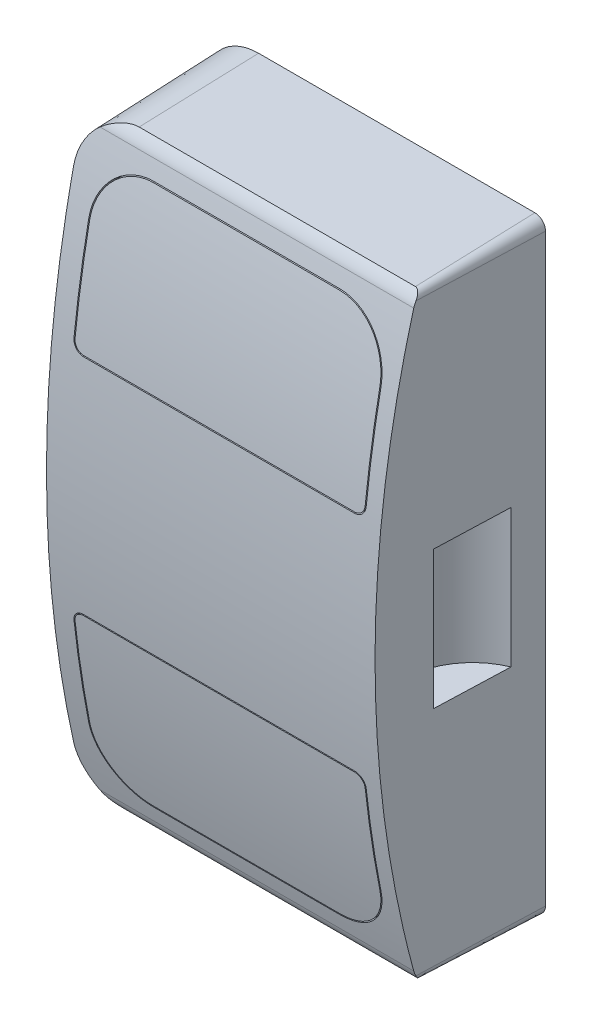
ISO-10303-21;
HEADER;
FILE_DESCRIPTION(('STEP AP214'),'2;1');
FILE_NAME('part.step','',(''),(''),'','','');
FILE_SCHEMA(('AUTOMOTIVE_DESIGN { 1 0 10303 214 1 1 1 1 }'));
ENDSEC;
DATA;
#1=APPLICATION_CONTEXT('core data for automotive mechanical design processes');
#2=APPLICATION_PROTOCOL_DEFINITION('international standard','automotive_design',2000,#1);
#3=PRODUCT_CONTEXT('',#1,'mechanical');
#4=PRODUCT('Part','Part','',(#3));
#5=PRODUCT_RELATED_PRODUCT_CATEGORY('part','',(#4));
#6=PRODUCT_DEFINITION_FORMATION('','',#4);
#7=PRODUCT_DEFINITION_CONTEXT('part definition',#1,'design');
#8=PRODUCT_DEFINITION('design','',#6,#7);
#9=PRODUCT_DEFINITION_SHAPE('','',#8);
#10=(LENGTH_UNIT() NAMED_UNIT(*) SI_UNIT(.MILLI.,.METRE.));
#11=(NAMED_UNIT(*) PLANE_ANGLE_UNIT() SI_UNIT($,.RADIAN.));
#12=(NAMED_UNIT(*) SI_UNIT($,.STERADIAN.) SOLID_ANGLE_UNIT());
#13=UNCERTAINTY_MEASURE_WITH_UNIT(LENGTH_MEASURE(1.E-05),#10,'distance_accuracy_value','');
#14=(GEOMETRIC_REPRESENTATION_CONTEXT(3) GLOBAL_UNCERTAINTY_ASSIGNED_CONTEXT((#13)) GLOBAL_UNIT_ASSIGNED_CONTEXT((#10,
#11,#12)) REPRESENTATION_CONTEXT('',''));
#15=CARTESIAN_POINT('',(0.,0.,0.));
#16=DIRECTION('',(0.,0.,1.));
#17=DIRECTION('',(1.,0.,0.));
#18=AXIS2_PLACEMENT_3D('',#15,#16,#17);
#19=CARTESIAN_POINT('',(-0.75,33.9,5.));
#20=DIRECTION('',(0.,1.,0.));
#21=DIRECTION('',(0.,0.,-1.));
#22=AXIS2_PLACEMENT_3D('',#19,#20,#21);
#23=PLANE('',#22);
#24=DIRECTION('',(1.,0.,0.));
#25=VECTOR('',#24,1.);
#26=CARTESIAN_POINT('',(-0.75,33.9,0.));
#27=LINE('',#26,#25);
#28=CARTESIAN_POINT('',(0.,33.9,0.));
#29=VERTEX_POINT('',#28);
#30=CARTESIAN_POINT('',(13.5,33.9,0.));
#31=VERTEX_POINT('',#30);
#32=EDGE_CURVE('E480',#29,#31,#27,.T.);
#33=ORIENTED_EDGE('',*,*,#32,.F.);
#34=DIRECTION('',(0.,0.,-1.));
#35=VECTOR('',#34,1.);
#36=CARTESIAN_POINT('',(0.,33.9,5.));
#37=LINE('',#36,#35);
#38=CARTESIAN_POINT('',(0.,33.9,5.));
#39=VERTEX_POINT('',#38);
#40=EDGE_CURVE('E458',#39,#29,#37,.T.);
#41=ORIENTED_EDGE('',*,*,#40,.F.);
#42=DIRECTION('',(1.,0.,0.));
#43=VECTOR('',#42,1.);
#44=CARTESIAN_POINT('',(-0.75,33.9,5.));
#45=LINE('',#44,#43);
#46=CARTESIAN_POINT('',(13.5,33.9,5.));
#47=VERTEX_POINT('',#46);
#48=EDGE_CURVE('E467',#39,#47,#45,.T.);
#49=ORIENTED_EDGE('',*,*,#48,.T.);
#50=DIRECTION('',(0.,0.,-1.));
#51=VECTOR('',#50,1.);
#52=CARTESIAN_POINT('',(13.5,33.9,5.));
#53=LINE('',#52,#51);
#54=EDGE_CURVE('E1785',#47,#31,#53,.T.);
#55=ORIENTED_EDGE('',*,*,#54,.T.);
#56=EDGE_LOOP('',(#33,#41,#49,#55));
#57=FACE_BOUND('',#56,.T.);
#58=ADVANCED_FACE('F14',(#57),#23,.T.);
#59=CARTESIAN_POINT('',(14.25,40.1,5.));
#60=DIRECTION('',(0.,-1.,0.));
#61=DIRECTION('',(0.,0.,1.));
#62=AXIS2_PLACEMENT_3D('',#59,#60,#61);
#63=PLANE('',#62);
#64=DIRECTION('',(0.,0.,-1.));
#65=VECTOR('',#64,1.);
#66=CARTESIAN_POINT('',(0.,40.1,5.));
#67=LINE('',#66,#65);
#68=CARTESIAN_POINT('',(0.,40.1,5.));
#69=VERTEX_POINT('',#68);
#70=CARTESIAN_POINT('',(0.,40.1,0.));
#71=VERTEX_POINT('',#70);
#72=EDGE_CURVE('E450',#69,#71,#67,.T.);
#73=ORIENTED_EDGE('',*,*,#72,.T.);
#74=DIRECTION('',(-1.,0.,0.));
#75=VECTOR('',#74,1.);
#76=CARTESIAN_POINT('',(14.25,40.1,0.));
#77=LINE('',#76,#75);
#78=CARTESIAN_POINT('',(13.5,40.1,0.));
#79=VERTEX_POINT('',#78);
#80=EDGE_CURVE('E476',#79,#71,#77,.T.);
#81=ORIENTED_EDGE('',*,*,#80,.F.);
#82=DIRECTION('',(0.,0.,-1.));
#83=VECTOR('',#82,1.);
#84=CARTESIAN_POINT('',(13.5,40.1,5.));
#85=LINE('',#84,#83);
#86=CARTESIAN_POINT('',(13.5,40.1,5.));
#87=VERTEX_POINT('',#86);
#88=EDGE_CURVE('E471',#87,#79,#85,.T.);
#89=ORIENTED_EDGE('',*,*,#88,.F.);
#90=DIRECTION('',(-1.,0.,0.));
#91=VECTOR('',#90,1.);
#92=CARTESIAN_POINT('',(14.25,40.1,5.));
#93=LINE('',#92,#91);
#94=EDGE_CURVE('E466',#87,#69,#93,.T.);
#95=ORIENTED_EDGE('',*,*,#94,.T.);
#96=EDGE_LOOP('',(#73,#81,#89,#95));
#97=FACE_BOUND('',#96,.T.);
#98=ADVANCED_FACE('F470',(#97),#63,.T.);
#99=CARTESIAN_POINT('',(-0.75,-3.1,5.));
#100=DIRECTION('',(0.,1.,0.));
#101=DIRECTION('',(0.,0.,-1.));
#102=AXIS2_PLACEMENT_3D('',#99,#100,#101);
#103=PLANE('',#102);
#104=DIRECTION('',(1.,0.,0.));
#105=VECTOR('',#104,1.);
#106=CARTESIAN_POINT('',(-0.75,-3.1,0.));
#107=LINE('',#106,#105);
#108=CARTESIAN_POINT('',(0.,-3.1,0.));
#109=VERTEX_POINT('',#108);
#110=CARTESIAN_POINT('',(13.5,-3.1,0.));
#111=VERTEX_POINT('',#110);
#112=EDGE_CURVE('E472',#109,#111,#107,.T.);
#113=ORIENTED_EDGE('',*,*,#112,.F.);
#114=DIRECTION('',(0.,0.,-1.));
#115=VECTOR('',#114,1.);
#116=CARTESIAN_POINT('',(0.,-3.1,5.));
#117=LINE('',#116,#115);
#118=CARTESIAN_POINT('',(0.,-3.1,5.));
#119=VERTEX_POINT('',#118);
#120=EDGE_CURVE('E854',#119,#109,#117,.T.);
#121=ORIENTED_EDGE('',*,*,#120,.F.);
#122=DIRECTION('',(1.,0.,0.));
#123=VECTOR('',#122,1.);
#124=CARTESIAN_POINT('',(-0.75,-3.1,5.));
#125=LINE('',#124,#123);
#126=CARTESIAN_POINT('',(13.5,-3.1,5.));
#127=VERTEX_POINT('',#126);
#128=EDGE_CURVE('E484',#119,#127,#125,.T.);
#129=ORIENTED_EDGE('',*,*,#128,.T.);
#130=DIRECTION('',(0.,0.,-1.));
#131=VECTOR('',#130,1.);
#132=CARTESIAN_POINT('',(13.5,-3.1,5.));
#133=LINE('',#132,#131);
#134=EDGE_CURVE('E857',#127,#111,#133,.T.);
#135=ORIENTED_EDGE('',*,*,#134,.T.);
#136=EDGE_LOOP('',(#113,#121,#129,#135));
#137=FACE_BOUND('',#136,.T.);
#138=ADVANCED_FACE('F838',(#137),#103,.T.);
#139=CARTESIAN_POINT('',(14.25,3.1,5.));
#140=DIRECTION('',(0.,-1.,0.));
#141=DIRECTION('',(0.,0.,1.));
#142=AXIS2_PLACEMENT_3D('',#139,#140,#141);
#143=PLANE('',#142);
#144=DIRECTION('',(0.,0.,-1.));
#145=VECTOR('',#144,1.);
#146=CARTESIAN_POINT('',(0.,3.1,5.));
#147=LINE('',#146,#145);
#148=CARTESIAN_POINT('',(0.,3.1,5.));
#149=VERTEX_POINT('',#148);
#150=CARTESIAN_POINT('',(0.,3.1,0.));
#151=VERTEX_POINT('',#150);
#152=EDGE_CURVE('E873',#149,#151,#147,.T.);
#153=ORIENTED_EDGE('',*,*,#152,.T.);
#154=DIRECTION('',(-1.,0.,0.));
#155=VECTOR('',#154,1.);
#156=CARTESIAN_POINT('',(14.25,3.1,0.));
#157=LINE('',#156,#155);
#158=CARTESIAN_POINT('',(13.5,3.1,0.));
#159=VERTEX_POINT('',#158);
#160=EDGE_CURVE('E474',#159,#151,#157,.T.);
#161=ORIENTED_EDGE('',*,*,#160,.F.);
#162=DIRECTION('',(0.,0.,-1.));
#163=VECTOR('',#162,1.);
#164=CARTESIAN_POINT('',(13.5,3.1,5.));
#165=LINE('',#164,#163);
#166=CARTESIAN_POINT('',(13.5,3.1,5.));
#167=VERTEX_POINT('',#166);
#168=EDGE_CURVE('E868',#167,#159,#165,.T.);
#169=ORIENTED_EDGE('',*,*,#168,.F.);
#170=DIRECTION('',(-1.,0.,0.));
#171=VECTOR('',#170,1.);
#172=CARTESIAN_POINT('',(14.25,3.1,5.));
#173=LINE('',#172,#171);
#174=EDGE_CURVE('E486',#167,#149,#173,.T.);
#175=ORIENTED_EDGE('',*,*,#174,.T.);
#176=EDGE_LOOP('',(#153,#161,#169,#175));
#177=FACE_BOUND('',#176,.T.);
#178=ADVANCED_FACE('F807',(#177),#143,.T.);
#179=CARTESIAN_POINT('',(15.25,35.5,10.));
#180=DIRECTION('',(0.,0.,1.));
#181=DIRECTION('',(0.,1.,0.));
#182=AXIS2_PLACEMENT_3D('',#179,#180,#181);
#183=PLANE('',#182);
#184=CARTESIAN_POINT('',(14.5,38.5,10.));
#185=DIRECTION('',(0.,0.,1.));
#186=DIRECTION('',(0.,-1.,0.));
#187=AXIS2_PLACEMENT_3D('',#184,#185,#186);
#188=CIRCLE('',#187,5.);
#189=CARTESIAN_POINT('',(19.5,38.5,10.));
#190=VERTEX_POINT('',#189);
#191=CARTESIAN_POINT('',(14.5,43.5,10.));
#192=VERTEX_POINT('',#191);
#193=EDGE_CURVE('E878',#190,#192,#188,.T.);
#194=ORIENTED_EDGE('',*,*,#193,.F.);
#195=DIRECTION('',(0.,1.,0.));
#196=VECTOR('',#195,1.);
#197=CARTESIAN_POINT('',(19.5,38.5,10.));
#198=LINE('',#197,#196);
#199=CARTESIAN_POINT('',(19.5,35.5,10.));
#200=VERTEX_POINT('',#199);
#201=EDGE_CURVE('E884',#200,#190,#198,.T.);
#202=ORIENTED_EDGE('',*,*,#201,.F.);
#203=CARTESIAN_POINT('',(14.5,35.5,10.));
#204=DIRECTION('',(0.,0.,1.));
#205=DIRECTION('',(0.,-1.,0.));
#206=AXIS2_PLACEMENT_3D('',#203,#204,#205);
#207=CIRCLE('',#206,5.);
#208=CARTESIAN_POINT('',(14.5,30.5,10.));
#209=VERTEX_POINT('',#208);
#210=EDGE_CURVE('E892',#209,#200,#207,.T.);
#211=ORIENTED_EDGE('',*,*,#210,.F.);
#212=DIRECTION('',(1.,0.,0.));
#213=VECTOR('',#212,1.);
#214=CARTESIAN_POINT('',(-1.75,30.5,10.));
#215=LINE('',#214,#213);
#216=CARTESIAN_POINT('',(-1.,30.5,10.));
#217=VERTEX_POINT('',#216);
#218=EDGE_CURVE('E1193',#217,#209,#215,.T.);
#219=ORIENTED_EDGE('',*,*,#218,.F.);
#220=CARTESIAN_POINT('',(-1.,35.5,10.));
#221=DIRECTION('',(0.,0.,1.));
#222=DIRECTION('',(0.,-1.,0.));
#223=AXIS2_PLACEMENT_3D('',#220,#221,#222);
#224=CIRCLE('',#223,5.);
#225=CARTESIAN_POINT('',(-6.,35.5,10.));
#226=VERTEX_POINT('',#225);
#227=EDGE_CURVE('E910',#226,#217,#224,.T.);
#228=ORIENTED_EDGE('',*,*,#227,.F.);
#229=DIRECTION('',(0.,-1.,0.));
#230=VECTOR('',#229,1.);
#231=CARTESIAN_POINT('',(-6.,38.5,10.));
#232=LINE('',#231,#230);
#233=CARTESIAN_POINT('',(-6.,38.5,10.));
#234=VERTEX_POINT('',#233);
#235=EDGE_CURVE('E919',#234,#226,#232,.T.);
#236=ORIENTED_EDGE('',*,*,#235,.F.);
#237=CARTESIAN_POINT('',(-1.,38.5,10.));
#238=DIRECTION('',(0.,0.,1.));
#239=DIRECTION('',(0.,-1.,0.));
#240=AXIS2_PLACEMENT_3D('',#237,#238,#239);
#241=CIRCLE('',#240,5.);
#242=CARTESIAN_POINT('',(-1.,43.5,10.));
#243=VERTEX_POINT('',#242);
#244=EDGE_CURVE('E905',#243,#234,#241,.T.);
#245=ORIENTED_EDGE('',*,*,#244,.F.);
#246=DIRECTION('',(-1.,0.,0.));
#247=VECTOR('',#246,1.);
#248=CARTESIAN_POINT('',(15.25,43.5,10.));
#249=LINE('',#248,#247);
#250=EDGE_CURVE('E1196',#192,#243,#249,.T.);
#251=ORIENTED_EDGE('',*,*,#250,.F.);
#252=EDGE_LOOP('',(#194,#202,#211,#219,#228,#236,#245,#251));
#253=FACE_BOUND('',#252,.T.);
#254=ADVANCED_FACE('F804',(#253),#183,.F.);
#255=CARTESIAN_POINT('',(15.25,35.5,5.));
#256=DIRECTION('',(0.,0.,1.));
#257=DIRECTION('',(0.,1.,0.));
#258=AXIS2_PLACEMENT_3D('',#255,#256,#257);
#259=PLANE('',#258);
#260=CARTESIAN_POINT('',(0.,37.,5.));
#261=DIRECTION('',(0.,0.,1.));
#262=DIRECTION('',(0.,-1.,0.));
#263=AXIS2_PLACEMENT_3D('',#260,#261,#262);
#264=CIRCLE('',#263,3.1);
#265=EDGE_CURVE('E453',#69,#39,#264,.T.);
#266=ORIENTED_EDGE('',*,*,#265,.F.);
#267=ORIENTED_EDGE('',*,*,#94,.F.);
#268=CARTESIAN_POINT('',(13.5,37.,5.));
#269=DIRECTION('',(0.,0.,1.));
#270=DIRECTION('',(0.,-1.,0.));
#271=AXIS2_PLACEMENT_3D('',#268,#269,#270);
#272=CIRCLE('',#271,3.1);
#273=EDGE_CURVE('E1786',#47,#87,#272,.T.);
#274=ORIENTED_EDGE('',*,*,#273,.F.);
#275=ORIENTED_EDGE('',*,*,#48,.F.);
#276=EDGE_LOOP('',(#266,#267,#274,#275));
#277=FACE_BOUND('',#276,.T.);
#278=DIRECTION('',(0.,1.,0.));
#279=VECTOR('',#278,1.);
#280=CARTESIAN_POINT('',(19.5,38.5,5.));
#281=LINE('',#280,#279);
#282=CARTESIAN_POINT('',(19.5,35.5,5.));
#283=VERTEX_POINT('',#282);
#284=CARTESIAN_POINT('',(19.5,38.5,5.));
#285=VERTEX_POINT('',#284);
#286=EDGE_CURVE('E887',#283,#285,#281,.T.);
#287=ORIENTED_EDGE('',*,*,#286,.T.);
#288=CARTESIAN_POINT('',(14.5,38.5,5.));
#289=DIRECTION('',(0.,0.,1.));
#290=DIRECTION('',(0.,-1.,0.));
#291=AXIS2_PLACEMENT_3D('',#288,#289,#290);
#292=CIRCLE('',#291,5.);
#293=CARTESIAN_POINT('',(14.5,43.5,5.));
#294=VERTEX_POINT('',#293);
#295=EDGE_CURVE('E880',#285,#294,#292,.T.);
#296=ORIENTED_EDGE('',*,*,#295,.T.);
#297=DIRECTION('',(-1.,0.,0.));
#298=VECTOR('',#297,1.);
#299=CARTESIAN_POINT('',(15.25,43.5,5.));
#300=LINE('',#299,#298);
#301=CARTESIAN_POINT('',(-1.,43.5,5.));
#302=VERTEX_POINT('',#301);
#303=EDGE_CURVE('E1197',#294,#302,#300,.T.);
#304=ORIENTED_EDGE('',*,*,#303,.T.);
#305=CARTESIAN_POINT('',(-1.,38.5,5.));
#306=DIRECTION('',(0.,0.,1.));
#307=DIRECTION('',(0.,-1.,0.));
#308=AXIS2_PLACEMENT_3D('',#305,#306,#307);
#309=CIRCLE('',#308,5.);
#310=CARTESIAN_POINT('',(-6.,38.5,5.));
#311=VERTEX_POINT('',#310);
#312=EDGE_CURVE('E906',#302,#311,#309,.T.);
#313=ORIENTED_EDGE('',*,*,#312,.T.);
#314=DIRECTION('',(0.,-1.,0.));
#315=VECTOR('',#314,1.);
#316=CARTESIAN_POINT('',(-6.,38.5,5.));
#317=LINE('',#316,#315);
#318=CARTESIAN_POINT('',(-6.,35.5,5.));
#319=VERTEX_POINT('',#318);
#320=EDGE_CURVE('E909',#311,#319,#317,.T.);
#321=ORIENTED_EDGE('',*,*,#320,.T.);
#322=CARTESIAN_POINT('',(-1.,35.5,5.));
#323=DIRECTION('',(0.,0.,1.));
#324=DIRECTION('',(0.,-1.,0.));
#325=AXIS2_PLACEMENT_3D('',#322,#323,#324);
#326=CIRCLE('',#325,5.);
#327=CARTESIAN_POINT('',(-1.,30.5,5.));
#328=VERTEX_POINT('',#327);
#329=EDGE_CURVE('E913',#319,#328,#326,.T.);
#330=ORIENTED_EDGE('',*,*,#329,.T.);
#331=DIRECTION('',(1.,0.,0.));
#332=VECTOR('',#331,1.);
#333=CARTESIAN_POINT('',(-1.75,30.5,5.));
#334=LINE('',#333,#332);
#335=CARTESIAN_POINT('',(14.5,30.5,5.));
#336=VERTEX_POINT('',#335);
#337=EDGE_CURVE('E1192',#328,#336,#334,.T.);
#338=ORIENTED_EDGE('',*,*,#337,.T.);
#339=CARTESIAN_POINT('',(14.5,35.5,5.));
#340=DIRECTION('',(0.,0.,1.));
#341=DIRECTION('',(0.,-1.,0.));
#342=AXIS2_PLACEMENT_3D('',#339,#340,#341);
#343=CIRCLE('',#342,5.);
#344=EDGE_CURVE('E883',#336,#283,#343,.T.);
#345=ORIENTED_EDGE('',*,*,#344,.T.);
#346=EDGE_LOOP('',(#287,#296,#304,#313,#321,#330,#338,#345));
#347=FACE_BOUND('',#346,.T.);
#348=ADVANCED_FACE('F463',(#277,#347),#259,.T.);
#349=CARTESIAN_POINT('',(15.25,43.5,10.));
#350=DIRECTION('',(0.,-1.,0.));
#351=DIRECTION('',(0.,0.,1.));
#352=AXIS2_PLACEMENT_3D('',#349,#350,#351);
#353=PLANE('',#352);
#354=ORIENTED_EDGE('',*,*,#303,.F.);
#355=DIRECTION('',(0.,0.,1.));
#356=VECTOR('',#355,1.);
#357=CARTESIAN_POINT('',(14.5,43.5,5.));
#358=LINE('',#357,#356);
#359=EDGE_CURVE('E902',#294,#192,#358,.T.);
#360=ORIENTED_EDGE('',*,*,#359,.T.);
#361=ORIENTED_EDGE('',*,*,#250,.T.);
#362=DIRECTION('',(0.,0.,1.));
#363=VECTOR('',#362,1.);
#364=CARTESIAN_POINT('',(-1.,43.5,5.));
#365=LINE('',#364,#363);
#366=EDGE_CURVE('E916',#302,#243,#365,.T.);
#367=ORIENTED_EDGE('',*,*,#366,.F.);
#368=EDGE_LOOP('',(#354,#360,#361,#367));
#369=FACE_BOUND('',#368,.T.);
#370=ADVANCED_FACE('F811',(#369),#353,.T.);
#371=CARTESIAN_POINT('',(-1.75,30.5,10.));
#372=DIRECTION('',(0.,1.,0.));
#373=DIRECTION('',(0.,0.,-1.));
#374=AXIS2_PLACEMENT_3D('',#371,#372,#373);
#375=PLANE('',#374);
#376=DIRECTION('',(0.,0.,1.));
#377=VECTOR('',#376,1.);
#378=CARTESIAN_POINT('',(14.5,30.5,5.));
#379=LINE('',#378,#377);
#380=EDGE_CURVE('E900',#336,#209,#379,.T.);
#381=ORIENTED_EDGE('',*,*,#380,.F.);
#382=ORIENTED_EDGE('',*,*,#337,.F.);
#383=DIRECTION('',(0.,0.,1.));
#384=VECTOR('',#383,1.);
#385=CARTESIAN_POINT('',(-1.,30.5,5.));
#386=LINE('',#385,#384);
#387=EDGE_CURVE('E924',#328,#217,#386,.T.);
#388=ORIENTED_EDGE('',*,*,#387,.T.);
#389=ORIENTED_EDGE('',*,*,#218,.T.);
#390=EDGE_LOOP('',(#381,#382,#388,#389));
#391=FACE_BOUND('',#390,.T.);
#392=ADVANCED_FACE('F814',(#391),#375,.T.);
#393=CARTESIAN_POINT('',(15.25,-1.5,10.));
#394=DIRECTION('',(0.,0.,1.));
#395=DIRECTION('',(0.,1.,0.));
#396=AXIS2_PLACEMENT_3D('',#393,#394,#395);
#397=PLANE('',#396);
#398=CARTESIAN_POINT('',(14.5,1.5,10.));
#399=DIRECTION('',(0.,0.,1.));
#400=DIRECTION('',(0.,-1.,0.));
#401=AXIS2_PLACEMENT_3D('',#398,#399,#400);
#402=CIRCLE('',#401,5.);
#403=CARTESIAN_POINT('',(19.5,1.5,10.));
#404=VERTEX_POINT('',#403);
#405=CARTESIAN_POINT('',(14.5,6.5,10.));
#406=VERTEX_POINT('',#405);
#407=EDGE_CURVE('E932',#404,#406,#402,.T.);
#408=ORIENTED_EDGE('',*,*,#407,.F.);
#409=DIRECTION('',(0.,1.,0.));
#410=VECTOR('',#409,1.);
#411=CARTESIAN_POINT('',(19.5,1.5,10.));
#412=LINE('',#411,#410);
#413=CARTESIAN_POINT('',(19.5,-1.5,10.));
#414=VERTEX_POINT('',#413);
#415=EDGE_CURVE('E937',#414,#404,#412,.T.);
#416=ORIENTED_EDGE('',*,*,#415,.F.);
#417=CARTESIAN_POINT('',(14.5,-1.5,10.));
#418=DIRECTION('',(0.,0.,1.));
#419=DIRECTION('',(0.,-1.,0.));
#420=AXIS2_PLACEMENT_3D('',#417,#418,#419);
#421=CIRCLE('',#420,5.);
#422=CARTESIAN_POINT('',(14.5,-6.5,10.));
#423=VERTEX_POINT('',#422);
#424=EDGE_CURVE('E945',#423,#414,#421,.T.);
#425=ORIENTED_EDGE('',*,*,#424,.F.);
#426=DIRECTION('',(1.,0.,0.));
#427=VECTOR('',#426,1.);
#428=CARTESIAN_POINT('',(-1.75,-6.5,10.));
#429=LINE('',#428,#427);
#430=CARTESIAN_POINT('',(-1.,-6.5,10.));
#431=VERTEX_POINT('',#430);
#432=EDGE_CURVE('E1203',#431,#423,#429,.T.);
#433=ORIENTED_EDGE('',*,*,#432,.F.);
#434=CARTESIAN_POINT('',(-1.,-1.5,10.));
#435=DIRECTION('',(0.,0.,1.));
#436=DIRECTION('',(0.,-1.,0.));
#437=AXIS2_PLACEMENT_3D('',#434,#435,#436);
#438=CIRCLE('',#437,5.);
#439=CARTESIAN_POINT('',(-6.,-1.5,10.));
#440=VERTEX_POINT('',#439);
#441=EDGE_CURVE('E963',#440,#431,#438,.T.);
#442=ORIENTED_EDGE('',*,*,#441,.F.);
#443=DIRECTION('',(0.,-1.,0.));
#444=VECTOR('',#443,1.);
#445=CARTESIAN_POINT('',(-6.,1.5,10.));
#446=LINE('',#445,#444);
#447=CARTESIAN_POINT('',(-6.,1.5,10.));
#448=VERTEX_POINT('',#447);
#449=EDGE_CURVE('E972',#448,#440,#446,.T.);
#450=ORIENTED_EDGE('',*,*,#449,.F.);
#451=CARTESIAN_POINT('',(-1.,1.5,10.));
#452=DIRECTION('',(0.,0.,1.));
#453=DIRECTION('',(0.,-1.,0.));
#454=AXIS2_PLACEMENT_3D('',#451,#452,#453);
#455=CIRCLE('',#454,5.);
#456=CARTESIAN_POINT('',(-1.,6.5,10.));
#457=VERTEX_POINT('',#456);
#458=EDGE_CURVE('E958',#457,#448,#455,.T.);
#459=ORIENTED_EDGE('',*,*,#458,.F.);
#460=DIRECTION('',(-1.,0.,0.));
#461=VECTOR('',#460,1.);
#462=CARTESIAN_POINT('',(15.25,6.5,10.));
#463=LINE('',#462,#461);
#464=EDGE_CURVE('E482',#406,#457,#463,.T.);
#465=ORIENTED_EDGE('',*,*,#464,.F.);
#466=EDGE_LOOP('',(#408,#416,#425,#433,#442,#450,#459,#465));
#467=FACE_BOUND('',#466,.T.);
#468=ADVANCED_FACE('F818',(#467),#397,.F.);
#469=CARTESIAN_POINT('',(15.25,-1.5,5.));
#470=DIRECTION('',(0.,0.,1.));
#471=DIRECTION('',(0.,1.,0.));
#472=AXIS2_PLACEMENT_3D('',#469,#470,#471);
#473=PLANE('',#472);
#474=CARTESIAN_POINT('',(0.,0.,5.));
#475=DIRECTION('',(0.,0.,1.));
#476=DIRECTION('',(0.,-1.,0.));
#477=AXIS2_PLACEMENT_3D('',#474,#475,#476);
#478=CIRCLE('',#477,3.1);
#479=EDGE_CURVE('E1790',#149,#119,#478,.T.);
#480=ORIENTED_EDGE('',*,*,#479,.F.);
#481=ORIENTED_EDGE('',*,*,#174,.F.);
#482=CARTESIAN_POINT('',(13.5,0.,5.));
#483=DIRECTION('',(0.,0.,1.));
#484=DIRECTION('',(0.,-1.,0.));
#485=AXIS2_PLACEMENT_3D('',#482,#483,#484);
#486=CIRCLE('',#485,3.1);
#487=EDGE_CURVE('E870',#127,#167,#486,.T.);
#488=ORIENTED_EDGE('',*,*,#487,.F.);
#489=ORIENTED_EDGE('',*,*,#128,.F.);
#490=EDGE_LOOP('',(#480,#481,#488,#489));
#491=FACE_BOUND('',#490,.T.);
#492=DIRECTION('',(0.,1.,0.));
#493=VECTOR('',#492,1.);
#494=CARTESIAN_POINT('',(19.5,1.5,5.));
#495=LINE('',#494,#493);
#496=CARTESIAN_POINT('',(19.5,-1.5,5.));
#497=VERTEX_POINT('',#496);
#498=CARTESIAN_POINT('',(19.5,1.5,5.));
#499=VERTEX_POINT('',#498);
#500=EDGE_CURVE('E940',#497,#499,#495,.T.);
#501=ORIENTED_EDGE('',*,*,#500,.T.);
#502=CARTESIAN_POINT('',(14.5,1.5,5.));
#503=DIRECTION('',(0.,0.,1.));
#504=DIRECTION('',(0.,-1.,0.));
#505=AXIS2_PLACEMENT_3D('',#502,#503,#504);
#506=CIRCLE('',#505,5.);
#507=CARTESIAN_POINT('',(14.5,6.5,5.));
#508=VERTEX_POINT('',#507);
#509=EDGE_CURVE('E933',#499,#508,#506,.T.);
#510=ORIENTED_EDGE('',*,*,#509,.T.);
#511=DIRECTION('',(-1.,0.,0.));
#512=VECTOR('',#511,1.);
#513=CARTESIAN_POINT('',(15.25,6.5,5.));
#514=LINE('',#513,#512);
#515=CARTESIAN_POINT('',(-1.,6.5,5.));
#516=VERTEX_POINT('',#515);
#517=EDGE_CURVE('E1206',#508,#516,#514,.T.);
#518=ORIENTED_EDGE('',*,*,#517,.T.);
#519=CARTESIAN_POINT('',(-1.,1.5,5.));
#520=DIRECTION('',(0.,0.,1.));
#521=DIRECTION('',(0.,-1.,0.));
#522=AXIS2_PLACEMENT_3D('',#519,#520,#521);
#523=CIRCLE('',#522,5.);
#524=CARTESIAN_POINT('',(-6.,1.5,5.));
#525=VERTEX_POINT('',#524);
#526=EDGE_CURVE('E959',#516,#525,#523,.T.);
#527=ORIENTED_EDGE('',*,*,#526,.T.);
#528=DIRECTION('',(0.,-1.,0.));
#529=VECTOR('',#528,1.);
#530=CARTESIAN_POINT('',(-6.,1.5,5.));
#531=LINE('',#530,#529);
#532=CARTESIAN_POINT('',(-6.,-1.5,5.));
#533=VERTEX_POINT('',#532);
#534=EDGE_CURVE('E962',#525,#533,#531,.T.);
#535=ORIENTED_EDGE('',*,*,#534,.T.);
#536=CARTESIAN_POINT('',(-1.,-1.5,5.));
#537=DIRECTION('',(0.,0.,1.));
#538=DIRECTION('',(0.,-1.,0.));
#539=AXIS2_PLACEMENT_3D('',#536,#537,#538);
#540=CIRCLE('',#539,5.);
#541=CARTESIAN_POINT('',(-1.,-6.5,5.));
#542=VERTEX_POINT('',#541);
#543=EDGE_CURVE('E966',#533,#542,#540,.T.);
#544=ORIENTED_EDGE('',*,*,#543,.T.);
#545=DIRECTION('',(1.,0.,0.));
#546=VECTOR('',#545,1.);
#547=CARTESIAN_POINT('',(-1.75,-6.5,5.));
#548=LINE('',#547,#546);
#549=CARTESIAN_POINT('',(14.5,-6.5,5.));
#550=VERTEX_POINT('',#549);
#551=EDGE_CURVE('E1199',#542,#550,#548,.T.);
#552=ORIENTED_EDGE('',*,*,#551,.T.);
#553=CARTESIAN_POINT('',(14.5,-1.5,5.));
#554=DIRECTION('',(0.,0.,1.));
#555=DIRECTION('',(0.,-1.,0.));
#556=AXIS2_PLACEMENT_3D('',#553,#554,#555);
#557=CIRCLE('',#556,5.);
#558=EDGE_CURVE('E936',#550,#497,#557,.T.);
#559=ORIENTED_EDGE('',*,*,#558,.T.);
#560=EDGE_LOOP('',(#501,#510,#518,#527,#535,#544,#552,#559));
#561=FACE_BOUND('',#560,.T.);
#562=ADVANCED_FACE('F822',(#491,#561),#473,.T.);
#563=CARTESIAN_POINT('',(15.25,6.5,10.));
#564=DIRECTION('',(0.,-1.,0.));
#565=DIRECTION('',(0.,0.,1.));
#566=AXIS2_PLACEMENT_3D('',#563,#564,#565);
#567=PLANE('',#566);
#568=ORIENTED_EDGE('',*,*,#517,.F.);
#569=DIRECTION('',(0.,0.,1.));
#570=VECTOR('',#569,1.);
#571=CARTESIAN_POINT('',(14.5,6.5,5.));
#572=LINE('',#571,#570);
#573=EDGE_CURVE('E955',#508,#406,#572,.T.);
#574=ORIENTED_EDGE('',*,*,#573,.T.);
#575=ORIENTED_EDGE('',*,*,#464,.T.);
#576=DIRECTION('',(0.,0.,1.));
#577=VECTOR('',#576,1.);
#578=CARTESIAN_POINT('',(-1.,6.5,5.));
#579=LINE('',#578,#577);
#580=EDGE_CURVE('E969',#516,#457,#579,.T.);
#581=ORIENTED_EDGE('',*,*,#580,.F.);
#582=EDGE_LOOP('',(#568,#574,#575,#581));
#583=FACE_BOUND('',#582,.T.);
#584=ADVANCED_FACE('F826',(#583),#567,.T.);
#585=CARTESIAN_POINT('',(-1.75,-6.5,10.));
#586=DIRECTION('',(0.,1.,0.));
#587=DIRECTION('',(0.,0.,-1.));
#588=AXIS2_PLACEMENT_3D('',#585,#586,#587);
#589=PLANE('',#588);
#590=DIRECTION('',(0.,0.,1.));
#591=VECTOR('',#590,1.);
#592=CARTESIAN_POINT('',(14.5,-6.5,5.));
#593=LINE('',#592,#591);
#594=EDGE_CURVE('E953',#550,#423,#593,.T.);
#595=ORIENTED_EDGE('',*,*,#594,.F.);
#596=ORIENTED_EDGE('',*,*,#551,.F.);
#597=DIRECTION('',(0.,0.,1.));
#598=VECTOR('',#597,1.);
#599=CARTESIAN_POINT('',(-1.,-6.5,5.));
#600=LINE('',#599,#598);
#601=EDGE_CURVE('E977',#542,#431,#600,.T.);
#602=ORIENTED_EDGE('',*,*,#601,.T.);
#603=ORIENTED_EDGE('',*,*,#432,.T.);
#604=EDGE_LOOP('',(#595,#596,#602,#603));
#605=FACE_BOUND('',#604,.T.);
#606=ADVANCED_FACE('F830',(#605),#589,.T.);
#607=CARTESIAN_POINT('',(21.75,-9.,0.));
#608=DIRECTION('',(0.,0.,1.));
#609=DIRECTION('',(0.,1.,0.));
#610=AXIS2_PLACEMENT_3D('',#607,#608,#609);
#611=PLANE('',#610);
#612=ORIENTED_EDGE('',*,*,#80,.T.);
#613=CARTESIAN_POINT('',(0.,37.,0.));
#614=DIRECTION('',(0.,0.,1.));
#615=DIRECTION('',(0.,-1.,0.));
#616=AXIS2_PLACEMENT_3D('',#613,#614,#615);
#617=CIRCLE('',#616,3.1);
#618=EDGE_CURVE('E30',#71,#29,#617,.T.);
#619=ORIENTED_EDGE('',*,*,#618,.T.);
#620=ORIENTED_EDGE('',*,*,#32,.T.);
#621=CARTESIAN_POINT('',(13.5,37.,0.));
#622=DIRECTION('',(0.,0.,1.));
#623=DIRECTION('',(0.,-1.,0.));
#624=AXIS2_PLACEMENT_3D('',#621,#622,#623);
#625=CIRCLE('',#624,3.1);
#626=EDGE_CURVE('E35',#31,#79,#625,.T.);
#627=ORIENTED_EDGE('',*,*,#626,.T.);
#628=EDGE_LOOP('',(#612,#619,#620,#627));
#629=FACE_BOUND('',#628,.T.);
#630=ORIENTED_EDGE('',*,*,#160,.T.);
#631=CARTESIAN_POINT('',(0.,0.,0.));
#632=DIRECTION('',(0.,0.,1.));
#633=DIRECTION('',(0.,-1.,0.));
#634=AXIS2_PLACEMENT_3D('',#631,#632,#633);
#635=CIRCLE('',#634,3.1);
#636=EDGE_CURVE('E863',#151,#109,#635,.T.);
#637=ORIENTED_EDGE('',*,*,#636,.T.);
#638=ORIENTED_EDGE('',*,*,#112,.T.);
#639=CARTESIAN_POINT('',(13.5,0.,0.));
#640=DIRECTION('',(0.,0.,1.));
#641=DIRECTION('',(0.,-1.,0.));
#642=AXIS2_PLACEMENT_3D('',#639,#640,#641);
#643=CIRCLE('',#642,3.1);
#644=EDGE_CURVE('E861',#111,#159,#643,.T.);
#645=ORIENTED_EDGE('',*,*,#644,.T.);
#646=EDGE_LOOP('',(#630,#637,#638,#645));
#647=FACE_BOUND('',#646,.T.);
#648=DIRECTION('',(1.,0.,0.));
#649=VECTOR('',#648,1.);
#650=CARTESIAN_POINT('',(-4.25,-10.,0.));
#651=LINE('',#650,#649);
#652=CARTESIAN_POINT('',(-4.25,-10.,0.));
#653=VERTEX_POINT('',#652);
#654=CARTESIAN_POINT('',(21.75,-10.,0.));
#655=VERTEX_POINT('',#654);
#656=EDGE_CURVE('E1392',#653,#655,#651,.T.);
#657=ORIENTED_EDGE('',*,*,#656,.F.);
#658=CARTESIAN_POINT('',(-4.25,-5.,0.));
#659=DIRECTION('',(0.,0.,1.));
#660=DIRECTION('',(0.,1.,0.));
#661=AXIS2_PLACEMENT_3D('',#658,#659,#660);
#662=CIRCLE('',#661,5.);
#663=CARTESIAN_POINT('',(-9.25,-5.,0.));
#664=VERTEX_POINT('',#663);
#665=EDGE_CURVE('E1369',#664,#653,#662,.T.);
#666=ORIENTED_EDGE('',*,*,#665,.F.);
#667=DIRECTION('',(0.,-1.,0.));
#668=VECTOR('',#667,1.);
#669=CARTESIAN_POINT('',(-9.25,42.,0.));
#670=LINE('',#669,#668);
#671=CARTESIAN_POINT('',(-9.25,42.,0.));
#672=VERTEX_POINT('',#671);
#673=EDGE_CURVE('E1365',#672,#664,#670,.T.);
#674=ORIENTED_EDGE('',*,*,#673,.F.);
#675=CARTESIAN_POINT('',(-4.25,42.,0.));
#676=DIRECTION('',(0.,0.,1.));
#677=DIRECTION('',(0.,1.,0.));
#678=AXIS2_PLACEMENT_3D('',#675,#676,#677);
#679=CIRCLE('',#678,5.);
#680=CARTESIAN_POINT('',(-4.25,47.,0.));
#681=VERTEX_POINT('',#680);
#682=EDGE_CURVE('E1378',#681,#672,#679,.T.);
#683=ORIENTED_EDGE('',*,*,#682,.F.);
#684=DIRECTION('',(-1.,0.,0.));
#685=VECTOR('',#684,1.);
#686=CARTESIAN_POINT('',(21.75,47.,0.));
#687=LINE('',#686,#685);
#688=CARTESIAN_POINT('',(21.75,47.,0.));
#689=VERTEX_POINT('',#688);
#690=EDGE_CURVE('E1381',#689,#681,#687,.T.);
#691=ORIENTED_EDGE('',*,*,#690,.F.);
#692=CARTESIAN_POINT('',(21.75,46.,0.));
#693=DIRECTION('',(0.,0.,1.));
#694=DIRECTION('',(0.,1.,0.));
#695=AXIS2_PLACEMENT_3D('',#692,#693,#694);
#696=CIRCLE('',#695,1.);
#697=CARTESIAN_POINT('',(22.75,46.,0.));
#698=VERTEX_POINT('',#697);
#699=EDGE_CURVE('E1425',#698,#689,#696,.T.);
#700=ORIENTED_EDGE('',*,*,#699,.F.);
#701=DIRECTION('',(0.,1.,0.));
#702=VECTOR('',#701,1.);
#703=CARTESIAN_POINT('',(22.75,-9.,0.));
#704=LINE('',#703,#702);
#705=CARTESIAN_POINT('',(22.75,-9.,0.));
#706=VERTEX_POINT('',#705);
#707=EDGE_CURVE('E1313',#706,#698,#704,.T.);
#708=ORIENTED_EDGE('',*,*,#707,.F.);
#709=CARTESIAN_POINT('',(21.75,-9.,0.));
#710=DIRECTION('',(0.,0.,1.));
#711=DIRECTION('',(0.,1.,0.));
#712=AXIS2_PLACEMENT_3D('',#709,#710,#711);
#713=CIRCLE('',#712,1.);
#714=EDGE_CURVE('E1421',#655,#706,#713,.T.);
#715=ORIENTED_EDGE('',*,*,#714,.F.);
#716=EDGE_LOOP('',(#657,#666,#674,#683,#691,#700,#708,#715));
#717=FACE_BOUND('',#716,.T.);
#718=ADVANCED_FACE('F834',(#629,#647,#717),#611,.F.);
#719=CARTESIAN_POINT('',(-4.25,-10.,0.));
#720=DIRECTION('',(0.,-0.999390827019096,0.0348994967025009));
#721=DIRECTION('',(0.,0.034899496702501,0.999390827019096));
#722=AXIS2_PLACEMENT_3D('',#719,#720,#721);
#723=PLANE('',#722);
#724=DIRECTION('',(0.,-0.0348994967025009,-0.999390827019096));
#725=VECTOR('',#724,1.);
#726=CARTESIAN_POINT('',(21.75,-10.,0.));
#727=LINE('',#726,#725);
#728=CARTESIAN_POINT('',(21.75,-9.6074929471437,11.2399313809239));
#729=VERTEX_POINT('',#728);
#730=EDGE_CURVE('E1321',#729,#655,#727,.T.);
#731=ORIENTED_EDGE('',*,*,#730,.F.);
#732=DIRECTION('',(1.,0.,0.));
#733=VECTOR('',#732,1.);
#734=CARTESIAN_POINT('',(-26.75,-9.6074929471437,11.2399313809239));
#735=LINE('',#734,#733);
#736=CARTESIAN_POINT('',(-4.25,-9.6074929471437,11.2399313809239));
#737=VERTEX_POINT('',#736);
#738=EDGE_CURVE('E504',#729,#737,#735,.F.);
#739=ORIENTED_EDGE('',*,*,#738,.T.);
#740=DIRECTION('',(0.,-0.0348994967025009,-0.999390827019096));
#741=VECTOR('',#740,1.);
#742=CARTESIAN_POINT('',(-4.25,-10.,0.));
#743=LINE('',#742,#741);
#744=EDGE_CURVE('E1332',#737,#653,#743,.T.);
#745=ORIENTED_EDGE('',*,*,#744,.T.);
#746=ORIENTED_EDGE('',*,*,#656,.T.);
#747=EDGE_LOOP('',(#731,#739,#745,#746));
#748=FACE_BOUND('',#747,.T.);
#749=ADVANCED_FACE('F1391',(#748),#723,.T.);
#750=CARTESIAN_POINT('',(21.75,-9.,0.));
#751=DIRECTION('',(0.,0.,-1.));
#752=DIRECTION('',(0.,1.,0.));
#753=AXIS2_PLACEMENT_3D('',#750,#751,#752);
#754=CONICAL_SURFACE('',#753,1.,0.0349065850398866);
#755=DIRECTION('',(0.0348994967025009,0.,-0.999390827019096));
#756=VECTOR('',#755,1.);
#757=CARTESIAN_POINT('',(22.75,-9.,0.));
#758=LINE('',#757,#756);
#759=CARTESIAN_POINT('',(22.3385621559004,-9.,11.782038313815));
#760=VERTEX_POINT('',#759);
#761=EDGE_CURVE('E1318',#760,#706,#758,.T.);
#762=ORIENTED_EDGE('',*,*,#761,.F.);
#763=CARTESIAN_POINT('',(22.3385580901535,-8.9998,11.7821537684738));
#764=CARTESIAN_POINT('',(22.3389876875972,-9.02085628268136,11.7700033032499));
#765=CARTESIAN_POINT('',(22.3383047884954,-9.04168443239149,11.7574659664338));
#766=CARTESIAN_POINT('',(22.3348556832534,-9.08272796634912,11.7317378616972));
#767=CARTESIAN_POINT('',(22.3320916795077,-9.10294397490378,11.7185477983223));
#768=CARTESIAN_POINT('',(22.3209271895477,-9.16229582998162,11.6782811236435));
#769=CARTESIAN_POINT('',(22.3096556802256,-9.2003606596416,11.6503774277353));
#770=CARTESIAN_POINT('',(22.2811543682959,-9.27090677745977,11.594886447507));
#771=CARTESIAN_POINT('',(22.2642619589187,-9.30357481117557,11.5673571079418));
#772=CARTESIAN_POINT('',(22.2248716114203,-9.36527927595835,11.5120839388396));
#773=CARTESIAN_POINT('',(22.2023642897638,-9.39430950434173,11.4843398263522));
#774=CARTESIAN_POINT('',(22.1550171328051,-9.44485397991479,11.433289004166));
#775=CARTESIAN_POINT('',(22.1308240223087,-9.46685423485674,11.409862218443));
#776=CARTESIAN_POINT('',(22.0779830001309,-9.50724071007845,11.3649509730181));
#777=CARTESIAN_POINT('',(22.0493423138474,-9.52563268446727,11.3434634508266));
#778=CARTESIAN_POINT('',(21.9985852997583,-9.55200677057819,11.3115490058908));
#779=CARTESIAN_POINT('',(21.9779120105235,-9.56133636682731,11.2999504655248));
#780=CARTESIAN_POINT('',(21.9346637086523,-9.57777028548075,11.2791391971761));
#781=CARTESIAN_POINT('',(21.9120983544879,-9.58488512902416,11.269915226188));
#782=CARTESIAN_POINT('',(21.8667923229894,-9.59603357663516,11.2552929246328));
#783=CARTESIAN_POINT('',(21.8441696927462,-9.60024496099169,11.2496756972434));
#784=CARTESIAN_POINT('',(21.7976836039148,-9.60601912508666,11.2419243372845));
#785=CARTESIAN_POINT('',(21.773806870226,-9.60754242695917,11.239842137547));
#786=CARTESIAN_POINT('',(21.7498,-9.60749291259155,11.2399314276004));
#787=B_SPLINE_CURVE_WITH_KNOTS('',3,(#763,#764,#765,#766,#767,#768,#769,#770,#771,#772,#773,
#774,#775,#776,#777,#778,#779,#780,#781,#782,#783,#784,#785,#786),.UNSPECIFIED.,.F.,.F.,(4,2,2,
2,2,2,2,2,2,2,2,4),(0.,0.0728728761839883,0.145668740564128,0.290490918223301,0.427841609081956,
0.565423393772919,0.685747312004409,0.805877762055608,0.882087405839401,0.957929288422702,
1.02857240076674,1.10024462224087),.UNSPECIFIED.);
#788=EDGE_CURVE('E1395',#760,#729,#787,.T.);
#789=ORIENTED_EDGE('',*,*,#788,.T.);
#790=ORIENTED_EDGE('',*,*,#730,.T.);
#791=ORIENTED_EDGE('',*,*,#714,.T.);
#792=EDGE_LOOP('',(#762,#789,#790,#791));
#793=FACE_BOUND('',#792,.T.);
#794=ADVANCED_FACE('F1305',(#793),#754,.T.);
#795=CARTESIAN_POINT('',(22.75,-9.,0.));
#796=DIRECTION('',(0.999390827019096,0.,0.0348994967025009));
#797=DIRECTION('',(-0.0348994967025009,0.,0.999390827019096));
#798=AXIS2_PLACEMENT_3D('',#795,#796,#797);
#799=PLANE('',#798);
#800=DIRECTION('',(0.,1.,0.));
#801=VECTOR('',#800,1.);
#802=CARTESIAN_POINT('',(22.6402109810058,12.,3.1439461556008));
#803=LINE('',#802,#801);
#804=CARTESIAN_POINT('',(22.6402109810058,12.,3.1439461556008));
#805=VERTEX_POINT('',#804);
#806=CARTESIAN_POINT('',(22.6402109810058,25.,3.1439461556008));
#807=VERTEX_POINT('',#806);
#808=EDGE_CURVE('E23',#805,#807,#803,.T.);
#809=ORIENTED_EDGE('',*,*,#808,.F.);
#810=DIRECTION('',(0.0348994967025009,0.,-0.999390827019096));
#811=VECTOR('',#810,1.);
#812=CARTESIAN_POINT('',(22.75,12.,0.));
#813=LINE('',#812,#811);
#814=CARTESIAN_POINT('',(22.3938081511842,12.,10.2));
#815=VERTEX_POINT('',#814);
#816=EDGE_CURVE('E9',#805,#815,#813,.F.);
#817=ORIENTED_EDGE('',*,*,#816,.T.);
#818=DIRECTION('',(0.,1.,0.));
#819=VECTOR('',#818,1.);
#820=CARTESIAN_POINT('',(22.3938081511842,-9.,10.2));
#821=LINE('',#820,#819);
#822=CARTESIAN_POINT('',(22.3938081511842,25.,10.2));
#823=VERTEX_POINT('',#822);
#824=EDGE_CURVE('E1287',#823,#815,#821,.F.);
#825=ORIENTED_EDGE('',*,*,#824,.F.);
#826=DIRECTION('',(0.0348994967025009,0.,-0.999390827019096));
#827=VECTOR('',#826,1.);
#828=CARTESIAN_POINT('',(22.75,25.,0.));
#829=LINE('',#828,#827);
#830=EDGE_CURVE('E1285',#807,#823,#829,.F.);
#831=ORIENTED_EDGE('',*,*,#830,.F.);
#832=EDGE_LOOP('',(#809,#817,#825,#831));
#833=FACE_BOUND('',#832,.T.);
#834=DIRECTION('',(0.0348994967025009,0.,-0.999390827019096));
#835=VECTOR('',#834,1.);
#836=CARTESIAN_POINT('',(22.75,46.,0.));
#837=LINE('',#836,#835);
#838=CARTESIAN_POINT('',(22.3385621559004,46.,11.782038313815));
#839=VERTEX_POINT('',#838);
#840=EDGE_CURVE('E1310',#839,#698,#837,.T.);
#841=ORIENTED_EDGE('',*,*,#840,.F.);
#842=CARTESIAN_POINT('',(22.3990467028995,45.,10.0499875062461));
#843=DIRECTION('',(0.999390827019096,0.,0.0348994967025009));
#844=DIRECTION('',(0.0348994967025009,0.,-0.999390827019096));
#845=AXIS2_PLACEMENT_3D('',#842,#843,#844);
#846=ELLIPSE('',#845,2.00121908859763,2.);
#847=CARTESIAN_POINT('',(22.3315332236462,45.512077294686,11.9833205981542));
#848=VERTEX_POINT('',#847);
#849=EDGE_CURVE('E1311',#839,#848,#846,.T.);
#850=ORIENTED_EDGE('',*,*,#849,.T.);
#851=CARTESIAN_POINT('',(25.8928692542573,18.5,-90.));
#852=DIRECTION('',(0.999390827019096,0.,0.0348994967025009));
#853=DIRECTION('',(0.0348994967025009,0.,-0.999390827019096));
#854=AXIS2_PLACEMENT_3D('',#851,#852,#853);
#855=ELLIPSE('',#854,105.564306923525,105.5);
#856=CARTESIAN_POINT('',(22.3315332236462,-8.512077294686,11.9833205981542));
#857=VERTEX_POINT('',#856);
#858=EDGE_CURVE('E502',#848,#857,#855,.T.);
#859=ORIENTED_EDGE('',*,*,#858,.T.);
#860=CARTESIAN_POINT('',(22.3990467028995,-8.,10.0499875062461));
#861=DIRECTION('',(0.999390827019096,0.,0.0348994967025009));
#862=DIRECTION('',(0.0348994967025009,0.,-0.999390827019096));
#863=AXIS2_PLACEMENT_3D('',#860,#861,#862);
#864=ELLIPSE('',#863,2.00121908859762,2.);
#865=EDGE_CURVE('E1396',#857,#760,#864,.T.);
#866=ORIENTED_EDGE('',*,*,#865,.T.);
#867=ORIENTED_EDGE('',*,*,#761,.T.);
#868=ORIENTED_EDGE('',*,*,#707,.T.);
#869=EDGE_LOOP('',(#841,#850,#859,#866,#867,#868));
#870=FACE_BOUND('',#869,.T.);
#871=ADVANCED_FACE('F1296',(#833,#870),#799,.T.);
#872=CARTESIAN_POINT('',(21.75,46.,0.));
#873=DIRECTION('',(0.,0.,-1.));
#874=DIRECTION('',(0.,1.,0.));
#875=AXIS2_PLACEMENT_3D('',#872,#873,#874);
#876=CONICAL_SURFACE('',#875,1.,0.0349065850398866);
#877=DIRECTION('',(0.,0.0348994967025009,-0.999390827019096));
#878=VECTOR('',#877,1.);
#879=CARTESIAN_POINT('',(21.75,47.,0.));
#880=LINE('',#879,#878);
#881=CARTESIAN_POINT('',(21.75,46.6074929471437,11.2399313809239));
#882=VERTEX_POINT('',#881);
#883=EDGE_CURVE('E1319',#882,#689,#880,.T.);
#884=ORIENTED_EDGE('',*,*,#883,.F.);
#885=CARTESIAN_POINT('',(21.7498,46.6074929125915,11.2399314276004));
#886=CARTESIAN_POINT('',(21.7708169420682,46.6075268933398,11.2398707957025));
#887=CARTESIAN_POINT('',(21.7917588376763,46.6063644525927,11.2414565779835));
#888=CARTESIAN_POINT('',(21.8327636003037,46.6019060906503,11.2474512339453));
#889=CARTESIAN_POINT('',(21.8528338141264,46.5986348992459,11.2518273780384));
#890=CARTESIAN_POINT('',(21.8971502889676,46.5890690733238,11.2644557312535));
#891=CARTESIAN_POINT('',(21.9210585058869,46.5821961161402,11.2734360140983));
#892=CARTESIAN_POINT('',(21.966843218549,46.5659718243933,11.2941367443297));
#893=CARTESIAN_POINT('',(21.9887084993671,46.556607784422,11.3058712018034));
#894=CARTESIAN_POINT('',(22.0411662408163,46.530456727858,11.3377431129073));
#895=CARTESIAN_POINT('',(22.0703659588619,46.512344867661,11.3590720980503));
#896=CARTESIAN_POINT('',(22.1242567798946,46.4724243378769,11.4038247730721));
#897=CARTESIAN_POINT('',(22.1489385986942,46.4506082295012,11.427252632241));
#898=CARTESIAN_POINT('',(22.2006954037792,46.3968542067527,11.4820019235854));
#899=CARTESIAN_POINT('',(22.2263366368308,46.3638270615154,11.5136171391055));
#900=CARTESIAN_POINT('',(22.2703283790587,46.2930753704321,11.5764865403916));
#901=CARTESIAN_POINT('',(22.2886926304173,46.2553598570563,11.6077412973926));
#902=CARTESIAN_POINT('',(22.3151208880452,46.1821580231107,11.6637595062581));
#903=CARTESIAN_POINT('',(22.3243645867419,46.1472845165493,11.6887600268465));
#904=CARTESIAN_POINT('',(22.3364708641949,46.0751524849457,11.7369891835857));
#905=CARTESIAN_POINT('',(22.3393152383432,46.0378874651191,11.7602125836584));
#906=CARTESIAN_POINT('',(22.3385580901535,45.9998,11.7821537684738));
#907=B_SPLINE_CURVE_WITH_KNOTS('',3,(#885,#886,#887,#888,#889,#890,#891,#892,#893,#894,#895,
#896,#897,#898,#899,#900,#901,#902,#903,#904,#905,#906),.UNSPECIFIED.,.F.,.F.,(4,2,2,2,2,2,2,2,
2,2,4),(0.,0.0628349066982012,0.124946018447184,0.203850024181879,0.283164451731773,
0.403826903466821,0.524734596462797,0.681228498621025,0.83742544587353,0.968567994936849,
1.10008314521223),.UNSPECIFIED.);
#908=EDGE_CURVE('E1412',#882,#839,#907,.T.);
#909=ORIENTED_EDGE('',*,*,#908,.T.);
#910=ORIENTED_EDGE('',*,*,#840,.T.);
#911=ORIENTED_EDGE('',*,*,#699,.T.);
#912=EDGE_LOOP('',(#884,#909,#910,#911));
#913=FACE_BOUND('',#912,.T.);
#914=ADVANCED_FACE('F1304',(#913),#876,.T.);
#915=CARTESIAN_POINT('',(21.75,47.,0.));
#916=DIRECTION('',(0.,0.999390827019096,0.0348994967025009));
#917=DIRECTION('',(0.,0.034899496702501,-0.999390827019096));
#918=AXIS2_PLACEMENT_3D('',#915,#916,#917);
#919=PLANE('',#918);
#920=DIRECTION('',(0.,0.0348994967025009,-0.999390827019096));
#921=VECTOR('',#920,1.);
#922=CARTESIAN_POINT('',(-4.25,47.,0.));
#923=LINE('',#922,#921);
#924=CARTESIAN_POINT('',(-4.25,46.6074929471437,11.2399313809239));
#925=VERTEX_POINT('',#924);
#926=EDGE_CURVE('E1323',#925,#681,#923,.T.);
#927=ORIENTED_EDGE('',*,*,#926,.F.);
#928=DIRECTION('',(1.,0.,0.));
#929=VECTOR('',#928,1.);
#930=CARTESIAN_POINT('',(-26.75,46.6074929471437,11.2399313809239));
#931=LINE('',#930,#929);
#932=EDGE_CURVE('E1418',#925,#882,#931,.T.);
#933=ORIENTED_EDGE('',*,*,#932,.T.);
#934=ORIENTED_EDGE('',*,*,#883,.T.);
#935=ORIENTED_EDGE('',*,*,#690,.T.);
#936=EDGE_LOOP('',(#927,#933,#934,#935));
#937=FACE_BOUND('',#936,.T.);
#938=ADVANCED_FACE('F1350',(#937),#919,.T.);
#939=CARTESIAN_POINT('',(-4.25,42.,0.));
#940=DIRECTION('',(0.,0.,-1.));
#941=DIRECTION('',(0.,1.,0.));
#942=AXIS2_PLACEMENT_3D('',#939,#940,#941);
#943=CONICAL_SURFACE('',#942,5.,0.0349065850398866);
#944=CARTESIAN_POINT('',(-8.80128730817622,41.9998,12.8494501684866));
#945=CARTESIAN_POINT('',(-8.80235357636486,42.1312336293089,12.8194219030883));
#946=CARTESIAN_POINT('',(-8.79771252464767,42.2626484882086,12.7891276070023));
#947=CARTESIAN_POINT('',(-8.7771254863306,42.5245171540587,12.728236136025));
#948=CARTESIAN_POINT('',(-8.76117969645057,42.6549709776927,12.6976389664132));
#949=CARTESIAN_POINT('',(-8.71807565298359,42.9141024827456,12.6363453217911));
#950=CARTESIAN_POINT('',(-8.69090842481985,43.0427786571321,12.6056487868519));
#951=CARTESIAN_POINT('',(-8.62555331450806,43.297337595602,12.5444253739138));
#952=CARTESIAN_POINT('',(-8.58736581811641,43.4232204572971,12.5138984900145));
#953=CARTESIAN_POINT('',(-8.50018505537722,43.6714031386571,12.4532420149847));
#954=CARTESIAN_POINT('',(-8.45118337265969,43.793700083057,12.4231127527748));
#955=CARTESIAN_POINT('',(-8.34270654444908,44.0337300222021,12.3635380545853));
#956=CARTESIAN_POINT('',(-8.28323151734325,44.1514630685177,12.3340926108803));
#957=CARTESIAN_POINT('',(-8.15428456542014,44.3813306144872,12.2761983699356));
#958=CARTESIAN_POINT('',(-8.08482817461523,44.4934734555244,12.2477481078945));
#959=CARTESIAN_POINT('',(-7.93632249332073,44.7114790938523,12.1920790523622));
#960=CARTESIAN_POINT('',(-7.85727667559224,44.8173441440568,12.1648598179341));
#961=CARTESIAN_POINT('',(-7.68617359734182,45.0268037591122,12.1106797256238));
#962=CARTESIAN_POINT('',(-7.59368141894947,45.1300621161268,12.0837901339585));
#963=CARTESIAN_POINT('',(-7.39949436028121,45.3278821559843,12.0319814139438));
#964=CARTESIAN_POINT('',(-7.29780759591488,45.4224513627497,12.0070605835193));
#965=CARTESIAN_POINT('',(-7.1918313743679,45.5122772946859,11.9832676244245));
#966=B_SPLINE_CURVE_WITH_KNOTS('',3,(#944,#945,#946,#947,#948,#949,#950,#951,#952,#953,#954,
#955,#956,#957,#958,#959,#960,#961,#962,#963,#964,#965),.UNSPECIFIED.,.F.,.F.,(4,2,2,2,2,2,2,2,
2,2,4),(0.,0.40434771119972,0.808688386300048,1.21335306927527,1.61800358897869,
2.02297015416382,2.42793214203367,2.83227057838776,3.23646302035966,3.65950783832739,
4.08218282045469),.UNSPECIFIED.);
#967=CARTESIAN_POINT('',(-8.80128890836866,42.,12.8494044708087));
#968=VERTEX_POINT('',#967);
#969=CARTESIAN_POINT('',(-7.1920672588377,45.512077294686,11.9833205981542));
#970=VERTEX_POINT('',#969);
#971=EDGE_CURVE('E501',#968,#970,#966,.T.);
#972=ORIENTED_EDGE('',*,*,#971,.T.);
#973=CARTESIAN_POINT('',(-7.19230311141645,45.511877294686,11.9833735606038));
#974=CARTESIAN_POINT('',(-7.10285438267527,45.5877309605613,11.9632731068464));
#975=CARTESIAN_POINT('',(-7.01115947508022,45.6597694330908,11.9394453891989));
#976=CARTESIAN_POINT('',(-6.82388682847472,45.7960556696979,11.8861937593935));
#977=CARTESIAN_POINT('',(-6.72831483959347,45.860314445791,11.8567779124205));
#978=CARTESIAN_POINT('',(-6.53205375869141,45.9820818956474,11.7936304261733));
#979=CARTESIAN_POINT('',(-6.43130668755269,46.0394636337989,11.7598363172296));
#980=CARTESIAN_POINT('',(-6.22638227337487,46.1462787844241,11.6901431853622));
#981=CARTESIAN_POINT('',(-6.1222045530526,46.1957113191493,11.6542439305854));
#982=CARTESIAN_POINT('',(-5.90509771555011,46.2889229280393,11.5804720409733));
#983=CARTESIAN_POINT('',(-5.79199287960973,46.3322871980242,11.542591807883));
#984=CARTESIAN_POINT('',(-5.56187880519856,46.4100987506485,11.4693102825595));
#985=CARTESIAN_POINT('',(-5.44486770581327,46.4445417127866,11.4339101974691));
#986=CARTESIAN_POINT('',(-5.20817552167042,46.503776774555,11.3692885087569));
#987=CARTESIAN_POINT('',(-5.08853805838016,46.5286710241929,11.3400031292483));
#988=CARTESIAN_POINT('',(-4.84578623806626,46.5686569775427,11.2910900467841));
#989=CARTESIAN_POINT('',(-4.72267916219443,46.583767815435,11.2714435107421));
#990=CARTESIAN_POINT('',(-4.54082768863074,46.5982351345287,11.2523595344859));
#991=CARTESIAN_POINT('',(-4.48292345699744,46.6016948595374,11.2477340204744));
#992=CARTESIAN_POINT('',(-4.36662049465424,46.6063316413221,11.2415015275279));
#993=CARTESIAN_POINT('',(-4.30822070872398,46.6074991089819,11.2399072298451));
#994=CARTESIAN_POINT('',(-4.2498,46.6074929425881,11.2399313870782));
#995=B_SPLINE_CURVE_WITH_KNOTS('',3,(#973,#974,#975,#976,#977,#978,#979,#980,#981,#982,#983,
#984,#985,#986,#987,#988,#989,#990,#991,#992,#993,#994),.UNSPECIFIED.,.F.,.F.,(4,2,2,2,2,2,2,2,
2,2,4),(0.,0.356670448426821,0.712829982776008,1.07478831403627,1.43678658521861,
1.81717575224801,2.19774879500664,2.57412876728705,2.94977038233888,3.12423273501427,
3.29942336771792),.UNSPECIFIED.);
#996=EDGE_CURVE('E1339',#970,#925,#995,.T.);
#997=ORIENTED_EDGE('',*,*,#996,.T.);
#998=ORIENTED_EDGE('',*,*,#926,.T.);
#999=ORIENTED_EDGE('',*,*,#682,.T.);
#1000=DIRECTION('',(-0.034899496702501,0.,-0.999390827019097));
#1001=VECTOR('',#1000,1.);
#1002=CARTESIAN_POINT('',(-9.25,42.,0.));
#1003=LINE('',#1002,#1001);
#1004=EDGE_CURVE('E1328',#968,#672,#1003,.T.);
#1005=ORIENTED_EDGE('',*,*,#1004,.F.);
#1006=EDGE_LOOP('',(#972,#997,#998,#999,#1005));
#1007=FACE_BOUND('',#1006,.T.);
#1008=ADVANCED_FACE('F1345',(#1007),#943,.T.);
#1009=CARTESIAN_POINT('',(-9.25,42.,0.));
#1010=DIRECTION('',(-0.999390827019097,0.,0.034899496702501));
#1011=DIRECTION('',(-0.034899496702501,0.,-0.999390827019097));
#1012=AXIS2_PLACEMENT_3D('',#1009,#1010,#1011);
#1013=PLANE('',#1012);
#1014=DIRECTION('',(-0.034899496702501,0.,-0.999390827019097));
#1015=VECTOR('',#1014,1.);
#1016=CARTESIAN_POINT('',(-9.25,-5.,0.));
#1017=LINE('',#1016,#1015);
#1018=CARTESIAN_POINT('',(-8.80128890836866,-5.,12.8494044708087));
#1019=VERTEX_POINT('',#1018);
#1020=EDGE_CURVE('E1330',#1019,#664,#1017,.T.);
#1021=ORIENTED_EDGE('',*,*,#1020,.F.);
#1022=CARTESIAN_POINT('',(-12.3928692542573,18.5,-90.));
#1023=DIRECTION('',(-0.999390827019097,0.,0.034899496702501));
#1024=DIRECTION('',(0.034899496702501,0.,0.999390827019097));
#1025=AXIS2_PLACEMENT_3D('',#1022,#1023,#1024);
#1026=ELLIPSE('',#1025,105.564306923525,105.5);
#1027=EDGE_CURVE('E498',#1019,#968,#1026,.T.);
#1028=ORIENTED_EDGE('',*,*,#1027,.T.);
#1029=ORIENTED_EDGE('',*,*,#1004,.T.);
#1030=ORIENTED_EDGE('',*,*,#673,.T.);
#1031=EDGE_LOOP('',(#1021,#1028,#1029,#1030));
#1032=FACE_BOUND('',#1031,.T.);
#1033=ADVANCED_FACE('F1349',(#1032),#1013,.T.);
#1034=CARTESIAN_POINT('',(-4.25,-5.,0.));
#1035=DIRECTION('',(0.,0.,-1.));
#1036=DIRECTION('',(0.,1.,0.));
#1037=AXIS2_PLACEMENT_3D('',#1034,#1035,#1036);
#1038=CONICAL_SURFACE('',#1037,5.,0.0349065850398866);
#1039=CARTESIAN_POINT('',(-4.2498,-9.60749294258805,11.2399313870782));
#1040=CARTESIAN_POINT('',(-4.33541793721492,-9.60751836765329,11.2398192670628));
#1041=CARTESIAN_POINT('',(-4.42096756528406,-9.60499718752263,11.2433046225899));
#1042=CARTESIAN_POINT('',(-4.59105771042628,-9.59505137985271,11.2566055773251));
#1043=CARTESIAN_POINT('',(-4.67560036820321,-9.58764037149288,11.2664035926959));
#1044=CARTESIAN_POINT('',(-4.84269587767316,-9.56817158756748,11.2913857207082));
#1045=CARTESIAN_POINT('',(-4.92525854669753,-9.55614688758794,11.3065314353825));
#1046=CARTESIAN_POINT('',(-5.08877820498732,-9.52767283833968,11.3410023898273));
#1047=CARTESIAN_POINT('',(-5.16973379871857,-9.51121980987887,11.3603311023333));
#1048=CARTESIAN_POINT('',(-5.37568264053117,-9.46347419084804,11.4138617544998));
#1049=CARTESIAN_POINT('',(-5.49938850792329,-9.42907568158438,11.4502486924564));
#1050=CARTESIAN_POINT('',(-5.74256275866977,-9.35034877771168,11.5263214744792));
#1051=CARTESIAN_POINT('',(-5.86202873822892,-9.30601485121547,11.5660091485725));
#1052=CARTESIAN_POINT('',(-6.09710496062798,-9.2075082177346,11.6455895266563));
#1053=CARTESIAN_POINT('',(-6.21270615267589,-9.15331410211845,11.6854824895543));
#1054=CARTESIAN_POINT('',(-6.43970328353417,-9.03517805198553,11.7627013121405));
#1055=CARTESIAN_POINT('',(-6.5511000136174,-8.97123796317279,11.80002765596));
#1056=CARTESIAN_POINT('',(-6.7525157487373,-8.84419983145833,11.8642601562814));
#1057=CARTESIAN_POINT('',(-6.84318027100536,-8.78249545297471,11.8918853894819));
#1058=CARTESIAN_POINT('',(-7.02066635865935,-8.65228598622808,11.9419083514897));
#1059=CARTESIAN_POINT('',(-7.10749578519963,-8.5837958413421,11.9643172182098));
#1060=CARTESIAN_POINT('',(-7.1923031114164,-8.511877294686,11.9833735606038));
#1061=B_SPLINE_CURVE_WITH_KNOTS('',3,(#1039,#1040,#1041,#1042,#1043,#1044,#1045,#1046,#1047,
#1048,#1049,#1050,#1051,#1052,#1053,#1054,#1055,#1056,#1057,#1058,#1059,#1060),.UNSPECIFIED.,
.F.,.F.,(4,2,2,2,2,2,2,2,2,2,4),(0.,0.256635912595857,0.512560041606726,0.766682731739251,
1.02101721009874,1.42077624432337,1.82075841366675,2.22161962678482,2.62240501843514,
2.96132217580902,3.29950890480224),.UNSPECIFIED.);
#1062=CARTESIAN_POINT('',(-7.19206725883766,-8.512077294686,11.9833205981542));
#1063=VERTEX_POINT('',#1062);
#1064=EDGE_CURVE('E1333',#737,#1063,#1061,.T.);
#1065=ORIENTED_EDGE('',*,*,#1064,.T.);
#1066=CARTESIAN_POINT('',(-7.19183137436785,-8.51227729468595,11.9832676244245));
#1067=CARTESIAN_POINT('',(-7.29156072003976,-8.42774058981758,12.0056593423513));
#1068=CARTESIAN_POINT('',(-7.387491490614,-8.33901083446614,12.0290482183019));
#1069=CARTESIAN_POINT('',(-7.57116314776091,-8.15390971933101,12.0775598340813));
#1070=CARTESIAN_POINT('',(-7.65890545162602,-8.05753968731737,12.1026822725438));
#1071=CARTESIAN_POINT('',(-7.82557535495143,-7.85795301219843,12.15438769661));
#1072=CARTESIAN_POINT('',(-7.90450998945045,-7.75474193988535,12.1809694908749));
#1073=CARTESIAN_POINT('',(-8.05314122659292,-7.54220989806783,12.2353430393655));
#1074=CARTESIAN_POINT('',(-8.12283776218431,-7.43288888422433,12.2631348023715));
#1075=CARTESIAN_POINT('',(-8.31738719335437,-7.09693645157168,12.3479357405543));
#1076=CARTESIAN_POINT('',(-8.42785207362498,-6.86213268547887,12.4064181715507));
#1077=CARTESIAN_POINT('',(-8.60723927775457,-6.37787184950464,12.5251361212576));
#1078=CARTESIAN_POINT('',(-8.67619840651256,-6.12842797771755,12.5853700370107));
#1079=CARTESIAN_POINT('',(-8.75062293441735,-5.73085996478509,12.6797814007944));
#1080=CARTESIAN_POINT('',(-8.77064184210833,-5.58533811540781,12.7140150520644));
#1081=CARTESIAN_POINT('',(-8.79655528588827,-5.29317030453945,12.7820881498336));
#1082=CARTESIAN_POINT('',(-8.80246979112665,-5.14652622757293,12.8159280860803));
#1083=CARTESIAN_POINT('',(-8.80128730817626,-4.9998,12.8494501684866));
#1084=B_SPLINE_CURVE_WITH_KNOTS('',3,(#1066,#1067,#1068,#1069,#1070,#1071,#1072,#1073,#1074,
#1075,#1076,#1077,#1078,#1079,#1080,#1081,#1082,#1083),.UNSPECIFIED.,.F.,.F.,(4,2,2,2,2,2,2,2,
4),(0.,0.397777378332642,0.795485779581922,1.1928742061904,1.5902655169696,2.3843292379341,
3.1776877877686,3.62956884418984,4.08080974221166),.UNSPECIFIED.);
#1085=EDGE_CURVE('E495',#1063,#1019,#1084,.T.);
#1086=ORIENTED_EDGE('',*,*,#1085,.T.);
#1087=ORIENTED_EDGE('',*,*,#1020,.T.);
#1088=ORIENTED_EDGE('',*,*,#665,.T.);
#1089=ORIENTED_EDGE('',*,*,#744,.F.);
#1090=EDGE_LOOP('',(#1065,#1086,#1087,#1088,#1089));
#1091=FACE_BOUND('',#1090,.T.);
#1092=ADVANCED_FACE('F16',(#1091),#1038,.T.);
#1093=CARTESIAN_POINT('',(-26.75,45.,10.0499875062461));
#1094=DIRECTION('',(1.,0.,0.));
#1095=DIRECTION('',(0.,1.,0.));
#1096=AXIS2_PLACEMENT_3D('',#1093,#1094,#1095);
#1097=CYLINDRICAL_SURFACE('',#1096,2.);
#1098=ORIENTED_EDGE('',*,*,#908,.F.);
#1099=ORIENTED_EDGE('',*,*,#932,.F.);
#1100=ORIENTED_EDGE('',*,*,#996,.F.);
#1101=DIRECTION('',(1.,0.,0.));
#1102=VECTOR('',#1101,1.);
#1103=CARTESIAN_POINT('',(-26.75,45.512077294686,11.9833205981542));
#1104=LINE('',#1103,#1102);
#1105=EDGE_CURVE('E492',#970,#848,#1104,.T.);
#1106=ORIENTED_EDGE('',*,*,#1105,.T.);
#1107=ORIENTED_EDGE('',*,*,#849,.F.);
#1108=EDGE_LOOP('',(#1098,#1099,#1100,#1106,#1107));
#1109=FACE_BOUND('',#1108,.T.);
#1110=ADVANCED_FACE('F528',(#1109),#1097,.T.);
#1111=CARTESIAN_POINT('',(-26.75,-8.,10.0499875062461));
#1112=DIRECTION('',(1.,0.,0.));
#1113=DIRECTION('',(0.,1.,0.));
#1114=AXIS2_PLACEMENT_3D('',#1111,#1112,#1113);
#1115=CYLINDRICAL_SURFACE('',#1114,2.);
#1116=DIRECTION('',(1.,0.,0.));
#1117=VECTOR('',#1116,1.);
#1118=CARTESIAN_POINT('',(-26.75,-8.512077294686,11.9833205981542));
#1119=LINE('',#1118,#1117);
#1120=EDGE_CURVE('E488',#1063,#857,#1119,.T.);
#1121=ORIENTED_EDGE('',*,*,#1120,.F.);
#1122=ORIENTED_EDGE('',*,*,#1064,.F.);
#1123=ORIENTED_EDGE('',*,*,#738,.F.);
#1124=ORIENTED_EDGE('',*,*,#788,.F.);
#1125=ORIENTED_EDGE('',*,*,#865,.F.);
#1126=EDGE_LOOP('',(#1121,#1122,#1123,#1124,#1125));
#1127=FACE_BOUND('',#1126,.T.);
#1128=ADVANCED_FACE('F524',(#1127),#1115,.T.);
#1129=CARTESIAN_POINT('',(-26.75,18.5,-90.));
#1130=DIRECTION('',(1.,0.,0.));
#1131=DIRECTION('',(0.,1.,0.));
#1132=AXIS2_PLACEMENT_3D('',#1129,#1130,#1131);
#1133=CYLINDRICAL_SURFACE('',#1132,105.5);
#1134=DIRECTION('',(1.,0.,0.));
#1135=VECTOR('',#1134,1.);
#1136=CARTESIAN_POINT('',(-26.75,29.,14.9761877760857));
#1137=LINE('',#1136,#1135);
#1138=CARTESIAN_POINT('',(19.75,29.,14.9761877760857));
#1139=VERTEX_POINT('',#1138);
#1140=CARTESIAN_POINT('',(-5.75,29.,14.9761877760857));
#1141=VERTEX_POINT('',#1140);
#1142=EDGE_CURVE('E2016',#1139,#1141,#1137,.F.);
#1143=ORIENTED_EDGE('',*,*,#1142,.T.);
#1144=CARTESIAN_POINT('',(-5.75,29.,14.9761877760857));
#1145=CARTESIAN_POINT('',(-5.77803035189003,29.0000001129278,14.9761876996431));
#1146=CARTESIAN_POINT('',(-5.80604724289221,29.0011792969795,14.9760698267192));
#1147=CARTESIAN_POINT('',(-5.8618798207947,29.0058830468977,14.9755992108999));
#1148=CARTESIAN_POINT('',(-5.88969551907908,29.0094074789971,14.9752464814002));
#1149=CARTESIAN_POINT('',(-5.97248584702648,29.0234630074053,14.9738387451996));
#1150=CARTESIAN_POINT('',(-6.02690475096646,29.0374764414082,14.9724341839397));
#1151=CARTESIAN_POINT('',(-6.13260230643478,29.0743894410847,14.9687221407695));
#1152=CARTESIAN_POINT('',(-6.18387957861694,29.0972928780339,14.9664142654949));
#1153=CARTESIAN_POINT('',(-6.28185236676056,29.1513185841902,14.9609458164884));
#1154=CARTESIAN_POINT('',(-6.32854852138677,29.1824397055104,14.9577853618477));
#1155=CARTESIAN_POINT('',(-6.41614277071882,29.2520751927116,14.9506746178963));
#1156=CARTESIAN_POINT('',(-6.45702876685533,29.2906046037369,14.9467227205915));
#1157=CARTESIAN_POINT('',(-6.53176360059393,29.3739189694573,14.9381228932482));
#1158=CARTESIAN_POINT('',(-6.5656110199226,29.4187051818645,14.9334748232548));
#1159=CARTESIAN_POINT('',(-6.62547653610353,29.5134825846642,14.9235697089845));
#1160=CARTESIAN_POINT('',(-6.65145513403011,29.5634983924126,14.9183097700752));
#1161=CARTESIAN_POINT('',(-6.694638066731,29.6671253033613,14.9073306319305));
#1162=CARTESIAN_POINT('',(-6.71184678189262,29.7207345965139,14.9016116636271));
#1163=CARTESIAN_POINT('',(-6.73293615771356,29.8122003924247,14.8917799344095));
#1164=CARTESIAN_POINT('',(-6.73933167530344,29.8495059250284,14.8877501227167));
#1165=CARTESIAN_POINT('',(-6.74786316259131,29.9245368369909,14.8796042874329));
#1166=CARTESIAN_POINT('',(-6.75000521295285,29.9622615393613,14.8754883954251));
#1167=CARTESIAN_POINT('',(-6.75,30.,14.8713497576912));
#1168=B_SPLINE_CURVE_WITH_KNOTS('',3,(#1144,#1145,#1146,#1147,#1148,#1149,#1150,#1151,#1152,
#1153,#1154,#1155,#1156,#1157,#1158,#1159,#1160,#1161,#1162,#1163,#1164,#1165,#1166,#1167),
.UNSPECIFIED.,.F.,.F.,(4,2,2,2,2,2,2,2,2,2,2,4),(0.,0.084039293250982,0.16807379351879,
0.335843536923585,0.503686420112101,0.671505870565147,0.839669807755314,1.00786759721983,
1.17689620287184,1.345840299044,1.45980557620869,1.57360781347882),.UNSPECIFIED.);
#1169=CARTESIAN_POINT('',(-6.75,30.,14.8713497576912));
#1170=VERTEX_POINT('',#1169);
#1171=EDGE_CURVE('E641',#1141,#1170,#1168,.T.);
#1172=ORIENTED_EDGE('',*,*,#1171,.T.);
#1173=CARTESIAN_POINT('',(-6.75,18.5,-90.));
#1174=DIRECTION('',(-1.,0.,0.));
#1175=DIRECTION('',(0.,-1.,0.));
#1176=AXIS2_PLACEMENT_3D('',#1173,#1174,#1175);
#1177=CIRCLE('',#1176,105.5);
#1178=CARTESIAN_POINT('',(-6.75,39.,13.489129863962));
#1179=VERTEX_POINT('',#1178);
#1180=EDGE_CURVE('E2026',#1170,#1179,#1177,.T.);
#1181=ORIENTED_EDGE('',*,*,#1180,.T.);
#1182=CARTESIAN_POINT('',(-6.75,39.,13.489129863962));
#1183=CARTESIAN_POINT('',(-6.75001355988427,39.1434366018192,13.4607198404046));
#1184=CARTESIAN_POINT('',(-6.74382840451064,39.2868090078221,13.4320065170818));
#1185=CARTESIAN_POINT('',(-6.71919030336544,39.5724105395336,13.3741968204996));
#1186=CARTESIAN_POINT('',(-6.7007380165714,39.7146397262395,13.3451004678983));
#1187=CARTESIAN_POINT('',(-6.65170472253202,39.996901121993,13.2867564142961));
#1188=CARTESIAN_POINT('',(-6.62112839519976,40.1369341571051,13.2575087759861));
#1189=CARTESIAN_POINT('',(-6.54806891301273,40.4138742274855,13.1990897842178));
#1190=CARTESIAN_POINT('',(-6.50558583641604,40.5507812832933,13.1699184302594));
#1191=CARTESIAN_POINT('',(-6.40898643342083,40.8205432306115,13.1118925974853));
#1192=CARTESIAN_POINT('',(-6.35486681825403,40.9533969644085,13.0830382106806));
#1193=CARTESIAN_POINT('',(-6.23533854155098,41.2141162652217,13.0259032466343));
#1194=CARTESIAN_POINT('',(-6.16992572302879,41.341979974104,12.9976228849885));
#1195=CARTESIAN_POINT('',(-6.02829454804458,41.5916762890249,12.9419294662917));
#1196=CARTESIAN_POINT('',(-5.95208232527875,41.7135122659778,12.9145159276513));
#1197=CARTESIAN_POINT('',(-5.78929647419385,41.9503799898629,12.8608012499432));
#1198=CARTESIAN_POINT('',(-5.70271930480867,42.0654093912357,12.8345004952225));
#1199=CARTESIAN_POINT('',(-5.52024307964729,42.2872162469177,12.7834190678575));
#1200=CARTESIAN_POINT('',(-5.42439138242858,42.3940310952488,12.7586316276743));
#1201=CARTESIAN_POINT('',(-5.22365652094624,42.599209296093,12.7107064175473));
#1202=CARTESIAN_POINT('',(-5.11877355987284,42.6975728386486,12.6875686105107));
#1203=CARTESIAN_POINT('',(-4.90065030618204,42.885112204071,12.6431955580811));
#1204=CARTESIAN_POINT('',(-4.78740711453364,42.974284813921,12.6219609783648));
#1205=CARTESIAN_POINT('',(-4.55343110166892,43.1426486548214,12.5816619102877));
#1206=CARTESIAN_POINT('',(-4.43270123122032,43.2218437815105,12.562596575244));
#1207=CARTESIAN_POINT('',(-4.1872037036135,43.3680679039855,12.5272390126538));
#1208=CARTESIAN_POINT('',(-4.06257535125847,43.4353186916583,12.5108966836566));
#1209=CARTESIAN_POINT('',(-3.80786646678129,43.5590816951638,12.4807127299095));
#1210=CARTESIAN_POINT('',(-3.67778818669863,43.6155982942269,12.4668700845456));
#1211=CARTESIAN_POINT('',(-3.41315414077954,43.7174147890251,12.4418603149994));
#1212=CARTESIAN_POINT('',(-3.27860118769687,43.7627215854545,12.4306915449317));
#1213=CARTESIAN_POINT('',(-3.0059893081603,43.841759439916,12.4111657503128));
#1214=CARTESIAN_POINT('',(-2.86793151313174,43.8754941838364,12.4028078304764));
#1215=CARTESIAN_POINT('',(-2.56764415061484,43.9354193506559,12.3879417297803));
#1216=CARTESIAN_POINT('',(-2.40499015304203,43.9596247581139,12.381922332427));
#1217=CARTESIAN_POINT('',(-2.07822100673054,43.9919226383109,12.3738830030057));
#1218=CARTESIAN_POINT('',(-1.91410818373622,44.0000372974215,12.3718575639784));
#1219=CARTESIAN_POINT('',(-1.75,44.,12.3718711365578));
#1220=B_SPLINE_CURVE_WITH_KNOTS('',3,(#1182,#1183,#1184,#1185,#1186,#1187,#1188,#1189,#1190,
#1191,#1192,#1193,#1194,#1195,#1196,#1197,#1198,#1199,#1200,#1201,#1202,#1203,#1204,#1205,#1206,
#1207,#1208,#1209,#1210,#1211,#1212,#1213,#1214,#1215,#1216,#1217,#1218,#1219),.UNSPECIFIED.,
.F.,.F.,(4,2,2,2,2,2,2,2,2,2,2,2,2,2,2,2,2,2,4),(0.,0.438532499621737,0.877041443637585,
1.31538128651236,1.75371824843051,2.1921792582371,2.63080200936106,3.06917662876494,
3.50770144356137,3.94409462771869,4.38047799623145,4.81701340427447,5.25337783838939,
5.68051791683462,6.10748319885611,6.53418498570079,6.96075073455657,7.45355657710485,
7.94568245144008),.UNSPECIFIED.);
#1221=CARTESIAN_POINT('',(-1.75,44.,12.3718711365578));
#1222=VERTEX_POINT('',#1221);
#1223=EDGE_CURVE('E613',#1179,#1222,#1220,.T.);
#1224=ORIENTED_EDGE('',*,*,#1223,.T.);
#1225=DIRECTION('',(1.,0.,0.));
#1226=VECTOR('',#1225,1.);
#1227=CARTESIAN_POINT('',(-26.75,44.,12.3718711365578));
#1228=LINE('',#1227,#1226);
#1229=CARTESIAN_POINT('',(15.75,44.,12.3718711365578));
#1230=VERTEX_POINT('',#1229);
#1231=EDGE_CURVE('E2023',#1222,#1230,#1228,.T.);
#1232=ORIENTED_EDGE('',*,*,#1231,.T.);
#1233=CARTESIAN_POINT('',(15.75,44.,12.3718711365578));
#1234=CARTESIAN_POINT('',(15.887784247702,44.0000172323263,12.3718647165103));
#1235=CARTESIAN_POINT('',(16.0255644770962,43.994305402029,12.3732895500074));
#1236=CARTESIAN_POINT('',(16.3001118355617,43.9715492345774,12.378955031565));
#1237=CARTESIAN_POINT('',(16.4368790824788,43.9545062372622,12.3831953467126));
#1238=CARTESIAN_POINT('',(16.708202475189,43.9092509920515,12.3944357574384));
#1239=CARTESIAN_POINT('',(16.8427619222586,43.8810573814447,12.4014312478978));
#1240=CARTESIAN_POINT('',(17.1089485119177,43.8137410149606,12.4180927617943));
#1241=CARTESIAN_POINT('',(17.2405756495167,43.7746182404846,12.427758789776));
#1242=CARTESIAN_POINT('',(17.4999701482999,43.6857656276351,12.4496427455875));
#1243=CARTESIAN_POINT('',(17.627737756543,43.6360364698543,12.4618605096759));
#1244=CARTESIAN_POINT('',(17.8785955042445,43.5263482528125,12.4887070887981));
#1245=CARTESIAN_POINT('',(18.0016838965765,43.4663854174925,12.5033367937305));
#1246=CARTESIAN_POINT('',(18.2422760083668,43.3367301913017,12.5348295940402));
#1247=CARTESIAN_POINT('',(18.3597813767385,43.2670406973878,12.5516920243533));
#1248=CARTESIAN_POINT('',(18.5885251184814,43.1184203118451,12.5874710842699));
#1249=CARTESIAN_POINT('',(18.6997611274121,43.0394859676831,12.6063884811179));
#1250=CARTESIAN_POINT('',(18.9167103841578,42.8718211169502,12.6463436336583));
#1251=CARTESIAN_POINT('',(19.0223255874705,42.7829698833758,12.6674071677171));
#1252=CARTESIAN_POINT('',(19.2257060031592,42.5970077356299,12.7112133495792));
#1253=CARTESIAN_POINT('',(19.3234682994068,42.4998937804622,12.7339566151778));
#1254=CARTESIAN_POINT('',(19.5104860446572,42.298128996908,12.7808823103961));
#1255=CARTESIAN_POINT('',(19.5997425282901,42.1934790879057,12.8050645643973));
#1256=CARTESIAN_POINT('',(19.7692310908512,41.9773599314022,12.8546348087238));
#1257=CARTESIAN_POINT('',(19.8494598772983,41.8658882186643,12.8800232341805));
#1258=CARTESIAN_POINT('',(20.0798520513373,41.5162486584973,12.9590216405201));
#1259=CARTESIAN_POINT('',(20.2147996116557,41.2681599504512,13.0142238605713));
#1260=CARTESIAN_POINT('',(20.4409098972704,40.7534048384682,13.1266471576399));
#1261=CARTESIAN_POINT('',(20.5320877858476,40.4867449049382,13.1838675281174));
#1262=CARTESIAN_POINT('',(20.6499499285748,40.0160408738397,13.2828691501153));
#1263=CARTESIAN_POINT('',(20.6874194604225,39.8146317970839,13.3246282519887));
#1264=CARTESIAN_POINT('',(20.7374492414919,39.4088799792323,13.4075053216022));
#1265=CARTESIAN_POINT('',(20.7500403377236,39.2045411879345,13.4486240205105));
#1266=CARTESIAN_POINT('',(20.75,39.,13.489129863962));
#1267=B_SPLINE_CURVE_WITH_KNOTS('',3,(#1233,#1234,#1235,#1236,#1237,#1238,#1239,#1240,#1241,
#1242,#1243,#1244,#1245,#1246,#1247,#1248,#1249,#1250,#1251,#1252,#1253,#1254,#1255,#1256,#1257,
#1258,#1259,#1260,#1261,#1262,#1263,#1264,#1265,#1266),.UNSPECIFIED.,.F.,.F.,(4,2,2,2,2,2,2,2,2,
2,2,2,2,2,2,2,4),(0.,0.41322102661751,0.826393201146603,1.23887769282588,1.65136288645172,
2.06382161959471,2.47643287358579,2.8889214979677,3.30156466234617,3.71993332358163,
4.13845663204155,4.55692896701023,4.97555343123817,5.83456028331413,6.69326933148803,
7.31905726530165,7.94406879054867),.UNSPECIFIED.);
#1268=CARTESIAN_POINT('',(20.75,39.,13.489129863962));
#1269=VERTEX_POINT('',#1268);
#1270=EDGE_CURVE('E623',#1230,#1269,#1267,.T.);
#1271=ORIENTED_EDGE('',*,*,#1270,.T.);
#1272=CARTESIAN_POINT('',(20.75,18.5,-90.));
#1273=DIRECTION('',(1.,0.,0.));
#1274=DIRECTION('',(0.,1.,0.));
#1275=AXIS2_PLACEMENT_3D('',#1272,#1273,#1274);
#1276=CIRCLE('',#1275,105.5);
#1277=CARTESIAN_POINT('',(20.75,30.,14.8713497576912));
#1278=VERTEX_POINT('',#1277);
#1279=EDGE_CURVE('E2020',#1269,#1278,#1276,.T.);
#1280=ORIENTED_EDGE('',*,*,#1279,.T.);
#1281=CARTESIAN_POINT('',(20.75,30.,14.8713497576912));
#1282=CARTESIAN_POINT('',(20.7499997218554,29.971761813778,14.8744463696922));
#1283=CARTESIAN_POINT('',(20.7488031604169,29.9435357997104,14.8775299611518));
#1284=CARTESIAN_POINT('',(20.7440283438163,29.887282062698,14.8836527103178));
#1285=CARTESIAN_POINT('',(20.7404501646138,29.8592543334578,14.8866918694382));
#1286=CARTESIAN_POINT('',(20.7261733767,29.7758084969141,14.8957065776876));
#1287=CARTESIAN_POINT('',(20.7119324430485,29.7209438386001,14.9015885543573));
#1288=CARTESIAN_POINT('',(20.674381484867,29.61436091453,14.9129346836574));
#1289=CARTESIAN_POINT('',(20.6510663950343,29.5626444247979,14.91839860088));
#1290=CARTESIAN_POINT('',(20.5960137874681,29.4638511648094,14.9287683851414));
#1291=CARTESIAN_POINT('',(20.5642782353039,29.4167733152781,14.933674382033));
#1292=CARTESIAN_POINT('',(20.4933790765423,29.3287532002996,14.9427942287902));
#1293=CARTESIAN_POINT('',(20.454238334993,29.2877927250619,14.9470101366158));
#1294=CARTESIAN_POINT('',(20.3695569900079,29.2130188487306,14.9546694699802));
#1295=CARTESIAN_POINT('',(20.3240151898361,29.1792067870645,14.958112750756));
#1296=CARTESIAN_POINT('',(20.2280848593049,29.1198859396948,14.9641315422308));
#1297=CARTESIAN_POINT('',(20.1777219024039,29.0943361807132,14.9667113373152));
#1298=CARTESIAN_POINT('',(20.0733976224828,29.0520674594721,14.9709689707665));
#1299=CARTESIAN_POINT('',(20.0194386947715,29.0353426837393,14.9726474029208));
#1300=CARTESIAN_POINT('',(19.9292682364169,29.0155377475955,14.9746327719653));
#1301=CARTESIAN_POINT('',(19.8936413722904,29.0097145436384,14.975215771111));
#1302=CARTESIAN_POINT('',(19.8220148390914,29.0019463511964,14.975993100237));
#1303=CARTESIAN_POINT('',(19.7860157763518,28.9999958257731,14.9761879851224));
#1304=CARTESIAN_POINT('',(19.75,29.,14.9761877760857));
#1305=B_SPLINE_CURVE_WITH_KNOTS('',3,(#1281,#1282,#1283,#1284,#1285,#1286,#1287,#1288,#1289,
#1290,#1291,#1292,#1293,#1294,#1295,#1296,#1297,#1298,#1299,#1300,#1301,#1302,#1303,#1304),
.UNSPECIFIED.,.F.,.F.,(4,2,2,2,2,2,2,2,2,2,2,4),(0.,0.0851702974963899,0.170337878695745,
0.340423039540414,0.510603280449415,0.680743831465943,0.850367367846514,1.02002265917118,
1.18882323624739,1.35751247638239,1.46562861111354,1.57359005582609),.UNSPECIFIED.);
#1306=EDGE_CURVE('E632',#1278,#1139,#1305,.T.);
#1307=ORIENTED_EDGE('',*,*,#1306,.T.);
#1308=EDGE_LOOP('',(#1143,#1172,#1181,#1224,#1232,#1271,#1280,#1307));
#1309=FACE_BOUND('',#1308,.T.);
#1310=CARTESIAN_POINT('',(20.75,-2.,13.489129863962));
#1311=CARTESIAN_POINT('',(20.7500135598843,-2.1434366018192,13.4607198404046));
#1312=CARTESIAN_POINT('',(20.7438284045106,-2.28680900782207,13.4320065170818));
#1313=CARTESIAN_POINT('',(20.7191903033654,-2.57241053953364,13.3741968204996));
#1314=CARTESIAN_POINT('',(20.7007380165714,-2.71463972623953,13.3451004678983));
#1315=CARTESIAN_POINT('',(20.651704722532,-2.99690112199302,13.2867564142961));
#1316=CARTESIAN_POINT('',(20.6211283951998,-3.13693415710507,13.2575087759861));
#1317=CARTESIAN_POINT('',(20.5480689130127,-3.41387422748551,13.1990897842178));
#1318=CARTESIAN_POINT('',(20.505585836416,-3.55078128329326,13.1699184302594));
#1319=CARTESIAN_POINT('',(20.4089864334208,-3.82054323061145,13.1118925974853));
#1320=CARTESIAN_POINT('',(20.354866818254,-3.95339696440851,13.0830382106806));
#1321=CARTESIAN_POINT('',(20.235338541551,-4.21411626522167,13.0259032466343));
#1322=CARTESIAN_POINT('',(20.1699257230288,-4.34197997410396,12.9976228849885));
#1323=CARTESIAN_POINT('',(20.0282945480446,-4.59167628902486,12.9419294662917));
#1324=CARTESIAN_POINT('',(19.9520823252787,-4.71351226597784,12.9145159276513));
#1325=CARTESIAN_POINT('',(19.7892964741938,-4.95037998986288,12.8608012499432));
#1326=CARTESIAN_POINT('',(19.7027193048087,-5.06540939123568,12.8345004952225));
#1327=CARTESIAN_POINT('',(19.5202430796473,-5.28721624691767,12.7834190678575));
#1328=CARTESIAN_POINT('',(19.4243913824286,-5.39403109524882,12.7586316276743));
#1329=CARTESIAN_POINT('',(19.2236565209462,-5.59920929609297,12.7107064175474));
#1330=CARTESIAN_POINT('',(19.1187735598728,-5.69757283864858,12.6875686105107));
#1331=CARTESIAN_POINT('',(18.900650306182,-5.88511220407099,12.6431955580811));
#1332=CARTESIAN_POINT('',(18.7874071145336,-5.97428481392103,12.6219609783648));
#1333=CARTESIAN_POINT('',(18.5534311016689,-6.14264865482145,12.5816619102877));
#1334=CARTESIAN_POINT('',(18.4327012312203,-6.22184378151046,12.562596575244));
#1335=CARTESIAN_POINT('',(18.1872037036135,-6.36806790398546,12.5272390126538));
#1336=CARTESIAN_POINT('',(18.0625753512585,-6.43531869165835,12.5108966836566));
#1337=CARTESIAN_POINT('',(17.8078664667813,-6.55908169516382,12.4807127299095));
#1338=CARTESIAN_POINT('',(17.6777881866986,-6.61559829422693,12.4668700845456));
#1339=CARTESIAN_POINT('',(17.4131541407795,-6.71741478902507,12.4418603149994));
#1340=CARTESIAN_POINT('',(17.2786011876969,-6.76272158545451,12.4306915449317));
#1341=CARTESIAN_POINT('',(17.0059893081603,-6.84175943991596,12.4111657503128));
#1342=CARTESIAN_POINT('',(16.8679315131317,-6.87549418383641,12.4028078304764));
#1343=CARTESIAN_POINT('',(16.5676441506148,-6.93541935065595,12.3879417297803));
#1344=CARTESIAN_POINT('',(16.404990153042,-6.95962475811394,12.3819223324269));
#1345=CARTESIAN_POINT('',(16.0782210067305,-6.99192263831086,12.3738830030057));
#1346=CARTESIAN_POINT('',(15.9141081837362,-7.0000372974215,12.3718575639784));
#1347=CARTESIAN_POINT('',(15.75,-7.,12.3718711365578));
#1348=B_SPLINE_CURVE_WITH_KNOTS('',3,(#1310,#1311,#1312,#1313,#1314,#1315,#1316,#1317,#1318,
#1319,#1320,#1321,#1322,#1323,#1324,#1325,#1326,#1327,#1328,#1329,#1330,#1331,#1332,#1333,#1334,
#1335,#1336,#1337,#1338,#1339,#1340,#1341,#1342,#1343,#1344,#1345,#1346,#1347),.UNSPECIFIED.,
.F.,.F.,(4,2,2,2,2,2,2,2,2,2,2,2,2,2,2,2,2,2,4),(0.,0.438532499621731,0.877041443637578,
1.31538128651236,1.7537182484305,2.1921792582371,2.63080200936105,3.06917662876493,
3.50770144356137,3.9440946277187,4.38047799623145,4.81701340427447,5.25337783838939,
5.68051791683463,6.10748319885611,6.5341849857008,6.96075073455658,7.45355657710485,
7.94568245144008),.UNSPECIFIED.);
#1349=CARTESIAN_POINT('',(20.75,-2.,13.489129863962));
#1350=VERTEX_POINT('',#1349);
#1351=CARTESIAN_POINT('',(15.75,-7.,12.3718711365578));
#1352=VERTEX_POINT('',#1351);
#1353=EDGE_CURVE('E568',#1350,#1352,#1348,.T.);
#1354=ORIENTED_EDGE('',*,*,#1353,.T.);
#1355=DIRECTION('',(1.,0.,0.));
#1356=VECTOR('',#1355,1.);
#1357=CARTESIAN_POINT('',(-26.75,-7.,12.3718711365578));
#1358=LINE('',#1357,#1356);
#1359=CARTESIAN_POINT('',(-1.75,-7.,12.3718711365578));
#1360=VERTEX_POINT('',#1359);
#1361=EDGE_CURVE('E2041',#1352,#1360,#1358,.F.);
#1362=ORIENTED_EDGE('',*,*,#1361,.T.);
#1363=CARTESIAN_POINT('',(-1.75,-7.,12.3718711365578));
#1364=CARTESIAN_POINT('',(-1.88778424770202,-7.0000172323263,12.3718647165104));
#1365=CARTESIAN_POINT('',(-2.02556447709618,-6.99430540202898,12.3732895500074));
#1366=CARTESIAN_POINT('',(-2.30011183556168,-6.97154923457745,12.378955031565));
#1367=CARTESIAN_POINT('',(-2.43687908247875,-6.95450623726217,12.3831953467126));
#1368=CARTESIAN_POINT('',(-2.708202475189,-6.90925099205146,12.3944357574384));
#1369=CARTESIAN_POINT('',(-2.84276192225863,-6.88105738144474,12.4014312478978));
#1370=CARTESIAN_POINT('',(-3.10894851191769,-6.81374101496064,12.4180927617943));
#1371=CARTESIAN_POINT('',(-3.24057564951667,-6.77461824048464,12.427758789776));
#1372=CARTESIAN_POINT('',(-3.49997014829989,-6.68576562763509,12.4496427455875));
#1373=CARTESIAN_POINT('',(-3.62773775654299,-6.63603646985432,12.4618605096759));
#1374=CARTESIAN_POINT('',(-3.87859550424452,-6.52634825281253,12.4887070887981));
#1375=CARTESIAN_POINT('',(-4.00168389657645,-6.46638541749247,12.5033367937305));
#1376=CARTESIAN_POINT('',(-4.24227600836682,-6.3367301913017,12.5348295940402));
#1377=CARTESIAN_POINT('',(-4.35978137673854,-6.26704069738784,12.5516920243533));
#1378=CARTESIAN_POINT('',(-4.58852511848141,-6.11842031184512,12.5874710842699));
#1379=CARTESIAN_POINT('',(-4.69976112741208,-6.03948596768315,12.6063884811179));
#1380=CARTESIAN_POINT('',(-4.9167103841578,-5.87182111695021,12.6463436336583));
#1381=CARTESIAN_POINT('',(-5.02232558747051,-5.78296988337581,12.6674071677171));
#1382=CARTESIAN_POINT('',(-5.22570600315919,-5.59700773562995,12.7112133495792));
#1383=CARTESIAN_POINT('',(-5.32346829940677,-5.49989378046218,12.7339566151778));
#1384=CARTESIAN_POINT('',(-5.51048604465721,-5.29812899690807,12.7808823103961));
#1385=CARTESIAN_POINT('',(-5.59974252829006,-5.19347908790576,12.8050645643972));
#1386=CARTESIAN_POINT('',(-5.76923109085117,-4.97735993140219,12.8546348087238));
#1387=CARTESIAN_POINT('',(-5.84945987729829,-4.86588821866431,12.8800232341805));
#1388=CARTESIAN_POINT('',(-6.07985205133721,-4.51624865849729,12.9590216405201));
#1389=CARTESIAN_POINT('',(-6.21479961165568,-4.26815995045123,13.0142238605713));
#1390=CARTESIAN_POINT('',(-6.44090989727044,-3.75340483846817,13.1266471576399));
#1391=CARTESIAN_POINT('',(-6.53208778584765,-3.48674490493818,13.1838675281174));
#1392=CARTESIAN_POINT('',(-6.64994992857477,-3.01604087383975,13.2828691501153));
#1393=CARTESIAN_POINT('',(-6.6874194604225,-2.81463179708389,13.3246282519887));
#1394=CARTESIAN_POINT('',(-6.73744924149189,-2.4088799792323,13.4075053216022));
#1395=CARTESIAN_POINT('',(-6.75004033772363,-2.20454118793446,13.4486240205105));
#1396=CARTESIAN_POINT('',(-6.75,-2.,13.489129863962));
#1397=B_SPLINE_CURVE_WITH_KNOTS('',3,(#1363,#1364,#1365,#1366,#1367,#1368,#1369,#1370,#1371,
#1372,#1373,#1374,#1375,#1376,#1377,#1378,#1379,#1380,#1381,#1382,#1383,#1384,#1385,#1386,#1387,
#1388,#1389,#1390,#1391,#1392,#1393,#1394,#1395,#1396),.UNSPECIFIED.,.F.,.F.,(4,2,2,2,2,2,2,2,2,
2,2,2,2,2,2,2,4),(0.,0.413221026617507,0.826393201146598,1.23887769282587,1.65136288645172,
2.06382161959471,2.47643287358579,2.8889214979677,3.30156466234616,3.71993332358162,
4.13845663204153,4.55692896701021,4.97555343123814,5.83456028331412,6.69326933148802,
7.31905726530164,7.94406879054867),.UNSPECIFIED.);
#1398=CARTESIAN_POINT('',(-6.75,-2.,13.489129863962));
#1399=VERTEX_POINT('',#1398);
#1400=EDGE_CURVE('E540',#1360,#1399,#1397,.T.);
#1401=ORIENTED_EDGE('',*,*,#1400,.T.);
#1402=CARTESIAN_POINT('',(-6.75,18.5,-90.));
#1403=DIRECTION('',(-1.,0.,0.));
#1404=DIRECTION('',(0.,-1.,0.));
#1405=AXIS2_PLACEMENT_3D('',#1402,#1403,#1404);
#1406=CIRCLE('',#1405,105.5);
#1407=CARTESIAN_POINT('',(-6.75,7.,14.8713497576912));
#1408=VERTEX_POINT('',#1407);
#1409=EDGE_CURVE('E2052',#1399,#1408,#1406,.T.);
#1410=ORIENTED_EDGE('',*,*,#1409,.T.);
#1411=CARTESIAN_POINT('',(-6.75,7.,14.8713497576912));
#1412=CARTESIAN_POINT('',(-6.74999972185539,7.02823818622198,14.8744463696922));
#1413=CARTESIAN_POINT('',(-6.74880316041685,7.05646420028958,14.8775299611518));
#1414=CARTESIAN_POINT('',(-6.74402834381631,7.11271793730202,14.8836527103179));
#1415=CARTESIAN_POINT('',(-6.74045016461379,7.14074566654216,14.8866918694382));
#1416=CARTESIAN_POINT('',(-6.72617337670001,7.22419150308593,14.8957065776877));
#1417=CARTESIAN_POINT('',(-6.71193244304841,7.2790561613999,14.9015885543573));
#1418=CARTESIAN_POINT('',(-6.67438148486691,7.38563908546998,14.9129346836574));
#1419=CARTESIAN_POINT('',(-6.65106639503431,7.4373555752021,14.91839860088));
#1420=CARTESIAN_POINT('',(-6.59601378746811,7.53614883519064,14.9287683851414));
#1421=CARTESIAN_POINT('',(-6.56427823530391,7.58322668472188,14.9336743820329));
#1422=CARTESIAN_POINT('',(-6.49337907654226,7.67124679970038,14.9427942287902));
#1423=CARTESIAN_POINT('',(-6.454238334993,7.71220727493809,14.9470101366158));
#1424=CARTESIAN_POINT('',(-6.36955699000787,7.78698115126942,14.9546694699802));
#1425=CARTESIAN_POINT('',(-6.32401518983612,7.82079321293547,14.958112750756));
#1426=CARTESIAN_POINT('',(-6.22808485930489,7.88011406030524,14.9641315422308));
#1427=CARTESIAN_POINT('',(-6.17772190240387,7.90566381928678,14.9667113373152));
#1428=CARTESIAN_POINT('',(-6.07339762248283,7.94793254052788,14.9709689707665));
#1429=CARTESIAN_POINT('',(-6.01943869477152,7.9646573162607,14.9726474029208));
#1430=CARTESIAN_POINT('',(-5.9292682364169,7.98446225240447,14.9746327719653));
#1431=CARTESIAN_POINT('',(-5.89364137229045,7.99028545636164,14.975215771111));
#1432=CARTESIAN_POINT('',(-5.82201483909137,7.99805364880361,14.975993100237));
#1433=CARTESIAN_POINT('',(-5.78601577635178,8.00000417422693,14.9761879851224));
#1434=CARTESIAN_POINT('',(-5.75,8.,14.9761877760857));
#1435=B_SPLINE_CURVE_WITH_KNOTS('',3,(#1411,#1412,#1413,#1414,#1415,#1416,#1417,#1418,#1419,
#1420,#1421,#1422,#1423,#1424,#1425,#1426,#1427,#1428,#1429,#1430,#1431,#1432,#1433,#1434),
.UNSPECIFIED.,.F.,.F.,(4,2,2,2,2,2,2,2,2,2,2,4),(0.,0.0851702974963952,0.170337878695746,
0.340423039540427,0.510603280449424,0.680743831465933,0.850367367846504,1.02002265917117,
1.18882323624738,1.35751247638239,1.46562861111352,1.57359005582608),.UNSPECIFIED.);
#1436=CARTESIAN_POINT('',(-5.75,8.,14.9761877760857));
#1437=VERTEX_POINT('',#1436);
#1438=EDGE_CURVE('E550',#1408,#1437,#1435,.T.);
#1439=ORIENTED_EDGE('',*,*,#1438,.T.);
#1440=DIRECTION('',(1.,0.,0.));
#1441=VECTOR('',#1440,1.);
#1442=CARTESIAN_POINT('',(-26.75,8.,14.9761877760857));
#1443=LINE('',#1442,#1441);
#1444=CARTESIAN_POINT('',(19.75,8.,14.9761877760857));
#1445=VERTEX_POINT('',#1444);
#1446=EDGE_CURVE('E2049',#1437,#1445,#1443,.T.);
#1447=ORIENTED_EDGE('',*,*,#1446,.T.);
#1448=CARTESIAN_POINT('',(19.75,8.,14.9761877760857));
#1449=CARTESIAN_POINT('',(19.77803035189,7.99999988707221,14.9761876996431));
#1450=CARTESIAN_POINT('',(19.8060472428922,7.99882070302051,14.9760698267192));
#1451=CARTESIAN_POINT('',(19.8618798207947,7.99411695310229,14.9755992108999));
#1452=CARTESIAN_POINT('',(19.8896955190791,7.99059252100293,14.9752464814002));
#1453=CARTESIAN_POINT('',(19.9724858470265,7.97653699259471,14.9738387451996));
#1454=CARTESIAN_POINT('',(20.0269047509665,7.96252355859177,14.9724341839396));
#1455=CARTESIAN_POINT('',(20.1326023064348,7.92561055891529,14.9687221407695));
#1456=CARTESIAN_POINT('',(20.1838795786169,7.9027071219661,14.9664142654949));
#1457=CARTESIAN_POINT('',(20.2818523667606,7.84868141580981,14.9609458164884));
#1458=CARTESIAN_POINT('',(20.3285485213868,7.81756029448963,14.9577853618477));
#1459=CARTESIAN_POINT('',(20.4161427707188,7.74792480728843,14.9506746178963));
#1460=CARTESIAN_POINT('',(20.4570287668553,7.70939539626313,14.9467227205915));
#1461=CARTESIAN_POINT('',(20.5317636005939,7.62608103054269,14.9381228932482));
#1462=CARTESIAN_POINT('',(20.5656110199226,7.58129481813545,14.9334748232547));
#1463=CARTESIAN_POINT('',(20.6254765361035,7.48651741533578,14.9235697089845));
#1464=CARTESIAN_POINT('',(20.6514551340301,7.43650160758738,14.9183097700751));
#1465=CARTESIAN_POINT('',(20.694638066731,7.3328746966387,14.9073306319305));
#1466=CARTESIAN_POINT('',(20.7118467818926,7.27926540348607,14.9016116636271));
#1467=CARTESIAN_POINT('',(20.7329361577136,7.18779960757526,14.8917799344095));
#1468=CARTESIAN_POINT('',(20.7393316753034,7.15049407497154,14.8877501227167));
#1469=CARTESIAN_POINT('',(20.7478631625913,7.07546316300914,14.8796042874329));
#1470=CARTESIAN_POINT('',(20.7500052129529,7.03773846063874,14.8754883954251));
#1471=CARTESIAN_POINT('',(20.75,7.,14.8713497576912));
#1472=B_SPLINE_CURVE_WITH_KNOTS('',3,(#1448,#1449,#1450,#1451,#1452,#1453,#1454,#1455,#1456,
#1457,#1458,#1459,#1460,#1461,#1462,#1463,#1464,#1465,#1466,#1467,#1468,#1469,#1470,#1471),
.UNSPECIFIED.,.F.,.F.,(4,2,2,2,2,2,2,2,2,2,2,4),(0.,0.0840392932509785,0.168073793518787,
0.33584353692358,0.503686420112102,0.671505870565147,0.839669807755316,1.00786759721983,
1.17689620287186,1.34584029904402,1.4598055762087,1.57360781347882),.UNSPECIFIED.);
#1473=CARTESIAN_POINT('',(20.75,7.,14.8713497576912));
#1474=VERTEX_POINT('',#1473);
#1475=EDGE_CURVE('E559',#1445,#1474,#1472,.T.);
#1476=ORIENTED_EDGE('',*,*,#1475,.T.);
#1477=CARTESIAN_POINT('',(20.75,18.5,-90.));
#1478=DIRECTION('',(1.,0.,0.));
#1479=DIRECTION('',(0.,1.,0.));
#1480=AXIS2_PLACEMENT_3D('',#1477,#1478,#1479);
#1481=CIRCLE('',#1480,105.5);
#1482=EDGE_CURVE('E2046',#1474,#1350,#1481,.T.);
#1483=ORIENTED_EDGE('',*,*,#1482,.T.);
#1484=EDGE_LOOP('',(#1354,#1362,#1401,#1410,#1439,#1447,#1476,#1483));
#1485=FACE_BOUND('',#1484,.T.);
#1486=ORIENTED_EDGE('',*,*,#1105,.F.);
#1487=ORIENTED_EDGE('',*,*,#971,.F.);
#1488=ORIENTED_EDGE('',*,*,#1027,.F.);
#1489=ORIENTED_EDGE('',*,*,#1085,.F.);
#1490=ORIENTED_EDGE('',*,*,#1120,.T.);
#1491=ORIENTED_EDGE('',*,*,#858,.F.);
#1492=EDGE_LOOP('',(#1486,#1487,#1488,#1489,#1490,#1491));
#1493=FACE_BOUND('',#1492,.T.);
#1494=ADVANCED_FACE('F518',(#1309,#1485,#1493),#1133,.T.);
#1495=CARTESIAN_POINT('',(-1.75,-7.,10.5));
#1496=DIRECTION('',(0.,-1.,0.));
#1497=DIRECTION('',(0.,0.,1.));
#1498=AXIS2_PLACEMENT_3D('',#1495,#1496,#1497);
#1499=PLANE('',#1498);
#1500=DIRECTION('',(0.,0.,1.));
#1501=VECTOR('',#1500,1.);
#1502=CARTESIAN_POINT('',(15.75,-7.,10.5));
#1503=LINE('',#1502,#1501);
#1504=CARTESIAN_POINT('',(15.75,-7.,10.5));
#1505=VERTEX_POINT('',#1504);
#1506=EDGE_CURVE('E1189',#1505,#1352,#1503,.T.);
#1507=ORIENTED_EDGE('',*,*,#1506,.F.);
#1508=DIRECTION('',(1.,0.,0.));
#1509=VECTOR('',#1508,1.);
#1510=CARTESIAN_POINT('',(-1.75,-7.,10.5));
#1511=LINE('',#1510,#1509);
#1512=CARTESIAN_POINT('',(-1.75,-7.,10.5));
#1513=VERTEX_POINT('',#1512);
#1514=EDGE_CURVE('E1098',#1513,#1505,#1511,.T.);
#1515=ORIENTED_EDGE('',*,*,#1514,.F.);
#1516=DIRECTION('',(0.,0.,1.));
#1517=VECTOR('',#1516,1.);
#1518=CARTESIAN_POINT('',(-1.75,-7.,10.5));
#1519=LINE('',#1518,#1517);
#1520=EDGE_CURVE('E1150',#1513,#1360,#1519,.T.);
#1521=ORIENTED_EDGE('',*,*,#1520,.T.);
#1522=ORIENTED_EDGE('',*,*,#1361,.F.);
#1523=EDGE_LOOP('',(#1507,#1515,#1521,#1522));
#1524=FACE_BOUND('',#1523,.T.);
#1525=ADVANCED_FACE('F523',(#1524),#1499,.F.);
#1526=CARTESIAN_POINT('',(15.75,-2.,10.5));
#1527=DIRECTION('',(0.,0.,1.));
#1528=DIRECTION('',(0.,1.,0.));
#1529=AXIS2_PLACEMENT_3D('',#1526,#1527,#1528);
#1530=CYLINDRICAL_SURFACE('',#1529,5.);
#1531=DIRECTION('',(0.,0.,1.));
#1532=VECTOR('',#1531,1.);
#1533=CARTESIAN_POINT('',(20.75,-2.,10.5));
#1534=LINE('',#1533,#1532);
#1535=CARTESIAN_POINT('',(20.75,-2.,10.5));
#1536=VERTEX_POINT('',#1535);
#1537=EDGE_CURVE('E1186',#1536,#1350,#1534,.T.);
#1538=ORIENTED_EDGE('',*,*,#1537,.F.);
#1539=CARTESIAN_POINT('',(15.75,-2.,10.5));
#1540=DIRECTION('',(0.,0.,1.));
#1541=DIRECTION('',(0.,1.,0.));
#1542=AXIS2_PLACEMENT_3D('',#1539,#1540,#1541);
#1543=CIRCLE('',#1542,5.);
#1544=EDGE_CURVE('E1101',#1505,#1536,#1543,.T.);
#1545=ORIENTED_EDGE('',*,*,#1544,.F.);
#1546=ORIENTED_EDGE('',*,*,#1506,.T.);
#1547=ORIENTED_EDGE('',*,*,#1353,.F.);
#1548=EDGE_LOOP('',(#1538,#1545,#1546,#1547));
#1549=FACE_BOUND('',#1548,.T.);
#1550=ADVANCED_FACE('F795',(#1549),#1530,.F.);
#1551=CARTESIAN_POINT('',(20.75,-2.,10.5));
#1552=DIRECTION('',(1.,0.,0.));
#1553=DIRECTION('',(0.,1.,0.));
#1554=AXIS2_PLACEMENT_3D('',#1551,#1552,#1553);
#1555=PLANE('',#1554);
#1556=DIRECTION('',(0.,0.,1.));
#1557=VECTOR('',#1556,1.);
#1558=CARTESIAN_POINT('',(20.75,7.,10.5));
#1559=LINE('',#1558,#1557);
#1560=CARTESIAN_POINT('',(20.75,7.,10.5));
#1561=VERTEX_POINT('',#1560);
#1562=EDGE_CURVE('E1183',#1561,#1474,#1559,.T.);
#1563=ORIENTED_EDGE('',*,*,#1562,.F.);
#1564=DIRECTION('',(0.,1.,0.));
#1565=VECTOR('',#1564,1.);
#1566=CARTESIAN_POINT('',(20.75,-2.,10.5));
#1567=LINE('',#1566,#1565);
#1568=EDGE_CURVE('E1104',#1536,#1561,#1567,.T.);
#1569=ORIENTED_EDGE('',*,*,#1568,.F.);
#1570=ORIENTED_EDGE('',*,*,#1537,.T.);
#1571=ORIENTED_EDGE('',*,*,#1482,.F.);
#1572=EDGE_LOOP('',(#1563,#1569,#1570,#1571));
#1573=FACE_BOUND('',#1572,.T.);
#1574=ADVANCED_FACE('F792',(#1573),#1555,.F.);
#1575=CARTESIAN_POINT('',(19.75,7.,10.5));
#1576=DIRECTION('',(0.,0.,1.));
#1577=DIRECTION('',(0.,1.,0.));
#1578=AXIS2_PLACEMENT_3D('',#1575,#1576,#1577);
#1579=CYLINDRICAL_SURFACE('',#1578,1.);
#1580=DIRECTION('',(0.,0.,1.));
#1581=VECTOR('',#1580,1.);
#1582=CARTESIAN_POINT('',(19.75,8.,10.5));
#1583=LINE('',#1582,#1581);
#1584=CARTESIAN_POINT('',(19.75,8.,10.5));
#1585=VERTEX_POINT('',#1584);
#1586=EDGE_CURVE('E1180',#1585,#1445,#1583,.T.);
#1587=ORIENTED_EDGE('',*,*,#1586,.F.);
#1588=CARTESIAN_POINT('',(19.75,7.,10.5));
#1589=DIRECTION('',(0.,0.,1.));
#1590=DIRECTION('',(0.,1.,0.));
#1591=AXIS2_PLACEMENT_3D('',#1588,#1589,#1590);
#1592=CIRCLE('',#1591,1.);
#1593=EDGE_CURVE('E1107',#1561,#1585,#1592,.T.);
#1594=ORIENTED_EDGE('',*,*,#1593,.F.);
#1595=ORIENTED_EDGE('',*,*,#1562,.T.);
#1596=ORIENTED_EDGE('',*,*,#1475,.F.);
#1597=EDGE_LOOP('',(#1587,#1594,#1595,#1596));
#1598=FACE_BOUND('',#1597,.T.);
#1599=ADVANCED_FACE('F787',(#1598),#1579,.F.);
#1600=CARTESIAN_POINT('',(19.75,8.,10.5));
#1601=DIRECTION('',(0.,1.,0.));
#1602=DIRECTION('',(0.,0.,-1.));
#1603=AXIS2_PLACEMENT_3D('',#1600,#1601,#1602);
#1604=PLANE('',#1603);
#1605=DIRECTION('',(0.,0.,1.));
#1606=VECTOR('',#1605,1.);
#1607=CARTESIAN_POINT('',(-5.75,8.,10.5));
#1608=LINE('',#1607,#1606);
#1609=CARTESIAN_POINT('',(-5.75,8.,10.5));
#1610=VERTEX_POINT('',#1609);
#1611=EDGE_CURVE('E1177',#1610,#1437,#1608,.T.);
#1612=ORIENTED_EDGE('',*,*,#1611,.F.);
#1613=DIRECTION('',(-1.,0.,0.));
#1614=VECTOR('',#1613,1.);
#1615=CARTESIAN_POINT('',(19.75,8.,10.5));
#1616=LINE('',#1615,#1614);
#1617=EDGE_CURVE('E1110',#1585,#1610,#1616,.T.);
#1618=ORIENTED_EDGE('',*,*,#1617,.F.);
#1619=ORIENTED_EDGE('',*,*,#1586,.T.);
#1620=ORIENTED_EDGE('',*,*,#1446,.F.);
#1621=EDGE_LOOP('',(#1612,#1618,#1619,#1620));
#1622=FACE_BOUND('',#1621,.T.);
#1623=ADVANCED_FACE('F784',(#1622),#1604,.F.);
#1624=CARTESIAN_POINT('',(-5.75,7.,10.5));
#1625=DIRECTION('',(0.,0.,1.));
#1626=DIRECTION('',(0.,1.,0.));
#1627=AXIS2_PLACEMENT_3D('',#1624,#1625,#1626);
#1628=CYLINDRICAL_SURFACE('',#1627,1.);
#1629=DIRECTION('',(0.,0.,1.));
#1630=VECTOR('',#1629,1.);
#1631=CARTESIAN_POINT('',(-6.75,7.,10.5));
#1632=LINE('',#1631,#1630);
#1633=CARTESIAN_POINT('',(-6.75,7.,10.5));
#1634=VERTEX_POINT('',#1633);
#1635=EDGE_CURVE('E1174',#1634,#1408,#1632,.T.);
#1636=ORIENTED_EDGE('',*,*,#1635,.F.);
#1637=CARTESIAN_POINT('',(-5.75,7.,10.5));
#1638=DIRECTION('',(0.,0.,1.));
#1639=DIRECTION('',(0.,1.,0.));
#1640=AXIS2_PLACEMENT_3D('',#1637,#1638,#1639);
#1641=CIRCLE('',#1640,1.);
#1642=EDGE_CURVE('E1113',#1610,#1634,#1641,.T.);
#1643=ORIENTED_EDGE('',*,*,#1642,.F.);
#1644=ORIENTED_EDGE('',*,*,#1611,.T.);
#1645=ORIENTED_EDGE('',*,*,#1438,.F.);
#1646=EDGE_LOOP('',(#1636,#1643,#1644,#1645));
#1647=FACE_BOUND('',#1646,.T.);
#1648=ADVANCED_FACE('F779',(#1647),#1628,.F.);
#1649=CARTESIAN_POINT('',(-6.75,7.,10.5));
#1650=DIRECTION('',(-1.,0.,0.));
#1651=DIRECTION('',(0.,-1.,0.));
#1652=AXIS2_PLACEMENT_3D('',#1649,#1650,#1651);
#1653=PLANE('',#1652);
#1654=DIRECTION('',(0.,0.,1.));
#1655=VECTOR('',#1654,1.);
#1656=CARTESIAN_POINT('',(-6.75,-2.,10.5));
#1657=LINE('',#1656,#1655);
#1658=CARTESIAN_POINT('',(-6.75,-2.,10.5));
#1659=VERTEX_POINT('',#1658);
#1660=EDGE_CURVE('E1172',#1659,#1399,#1657,.T.);
#1661=ORIENTED_EDGE('',*,*,#1660,.F.);
#1662=DIRECTION('',(0.,-1.,0.));
#1663=VECTOR('',#1662,1.);
#1664=CARTESIAN_POINT('',(-6.75,7.,10.5));
#1665=LINE('',#1664,#1663);
#1666=EDGE_CURVE('E1116',#1634,#1659,#1665,.T.);
#1667=ORIENTED_EDGE('',*,*,#1666,.F.);
#1668=ORIENTED_EDGE('',*,*,#1635,.T.);
#1669=ORIENTED_EDGE('',*,*,#1409,.F.);
#1670=EDGE_LOOP('',(#1661,#1667,#1668,#1669));
#1671=FACE_BOUND('',#1670,.T.);
#1672=ADVANCED_FACE('F745',(#1671),#1653,.F.);
#1673=CARTESIAN_POINT('',(-1.75,-6.9,10.5));
#1674=DIRECTION('',(0.,-1.,0.));
#1675=DIRECTION('',(0.,0.,1.));
#1676=AXIS2_PLACEMENT_3D('',#1673,#1674,#1675);
#1677=PLANE('',#1676);
#1678=DIRECTION('',(1.,0.,0.));
#1679=VECTOR('',#1678,1.);
#1680=CARTESIAN_POINT('',(-26.75,-6.9,12.3967284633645));
#1681=LINE('',#1680,#1679);
#1682=CARTESIAN_POINT('',(15.75,-6.9,12.3967284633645));
#1683=VERTEX_POINT('',#1682);
#1684=CARTESIAN_POINT('',(-1.75,-6.9,12.3967284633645));
#1685=VERTEX_POINT('',#1684);
#1686=EDGE_CURVE('E2028',#1683,#1685,#1681,.F.);
#1687=ORIENTED_EDGE('',*,*,#1686,.T.);
#1688=DIRECTION('',(0.,0.,1.));
#1689=VECTOR('',#1688,1.);
#1690=CARTESIAN_POINT('',(-1.75,-6.9,10.5));
#1691=LINE('',#1690,#1689);
#1692=CARTESIAN_POINT('',(-1.75,-6.9,10.5));
#1693=VERTEX_POINT('',#1692);
#1694=EDGE_CURVE('E1147',#1693,#1685,#1691,.T.);
#1695=ORIENTED_EDGE('',*,*,#1694,.F.);
#1696=DIRECTION('',(1.,0.,0.));
#1697=VECTOR('',#1696,1.);
#1698=CARTESIAN_POINT('',(-1.75,-6.9,10.5));
#1699=LINE('',#1698,#1697);
#1700=CARTESIAN_POINT('',(15.75,-6.9,10.5));
#1701=VERTEX_POINT('',#1700);
#1702=EDGE_CURVE('E1143',#1693,#1701,#1699,.T.);
#1703=ORIENTED_EDGE('',*,*,#1702,.T.);
#1704=DIRECTION('',(0.,0.,1.));
#1705=VECTOR('',#1704,1.);
#1706=CARTESIAN_POINT('',(15.75,-6.9,10.5));
#1707=LINE('',#1706,#1705);
#1708=EDGE_CURVE('E1146',#1701,#1683,#1707,.T.);
#1709=ORIENTED_EDGE('',*,*,#1708,.T.);
#1710=EDGE_LOOP('',(#1687,#1695,#1703,#1709));
#1711=FACE_BOUND('',#1710,.T.);
#1712=ADVANCED_FACE('F742',(#1711),#1677,.T.);
#1713=CARTESIAN_POINT('',(-1.75,-2.,10.5));
#1714=DIRECTION('',(0.,0.,1.));
#1715=DIRECTION('',(0.,1.,0.));
#1716=AXIS2_PLACEMENT_3D('',#1713,#1714,#1715);
#1717=CYLINDRICAL_SURFACE('',#1716,4.9);
#1718=CARTESIAN_POINT('',(-1.75,-6.9,12.3967284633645));
#1719=CARTESIAN_POINT('',(-1.88504794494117,-6.90001687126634,12.3967222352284));
#1720=CARTESIAN_POINT('',(-2.02009197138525,-6.89441769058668,12.3981131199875));
#1721=CARTESIAN_POINT('',(-2.28918732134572,-6.87211019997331,12.4036438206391));
#1722=CARTESIAN_POINT('',(-2.42323875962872,-6.85540319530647,12.4077833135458));
#1723=CARTESIAN_POINT('',(-2.68917588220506,-6.81103974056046,12.4187568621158));
#1724=CARTESIAN_POINT('',(-2.82106478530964,-6.78340146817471,12.4255864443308));
#1725=CARTESIAN_POINT('',(-3.08196875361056,-6.71741059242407,12.4418535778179));
#1726=CARTESIAN_POINT('',(-3.21098381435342,-6.67905797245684,12.4512911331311));
#1727=CARTESIAN_POINT('',(-3.46523136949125,-6.59195368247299,12.4726591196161));
#1728=CARTESIAN_POINT('',(-3.59046409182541,-6.54320264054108,12.4845894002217));
#1729=CARTESIAN_POINT('',(-3.83634465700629,-6.43567106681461,12.5108061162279));
#1730=CARTESIAN_POINT('',(-3.95699078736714,-6.37688683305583,12.5250934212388));
#1731=CARTESIAN_POINT('',(-4.1928081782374,-6.24977935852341,12.5558515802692));
#1732=CARTESIAN_POINT('',(-4.30798106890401,-6.18145898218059,12.5723217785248));
#1733=CARTESIAN_POINT('',(-4.53218292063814,-6.03575761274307,12.6072717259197));
#1734=CARTESIAN_POINT('',(-4.64120956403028,-5.95837323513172,12.6257522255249));
#1735=CARTESIAN_POINT('',(-4.85383361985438,-5.79401095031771,12.6647858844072));
#1736=CARTESIAN_POINT('',(-4.95733583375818,-5.70691582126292,12.685364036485));
#1737=CARTESIAN_POINT('',(-5.15664543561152,-5.52462977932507,12.7281652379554));
#1738=CARTESIAN_POINT('',(-5.25244996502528,-5.42943588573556,12.7503888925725));
#1739=CARTESIAN_POINT('',(-5.43571988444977,-5.23166118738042,12.7962477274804));
#1740=CARTESIAN_POINT('',(-5.52318629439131,-5.12908128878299,12.8198827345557));
#1741=CARTESIAN_POINT('',(-5.68927242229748,-4.91723829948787,12.8683371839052));
#1742=CARTESIAN_POINT('',(-5.76788891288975,-4.8079727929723,12.8931570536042));
#1743=CARTESIAN_POINT('',(-5.99361685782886,-4.46529843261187,12.9703870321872));
#1744=CARTESIAN_POINT('',(-6.12581905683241,-4.22217254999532,13.0243637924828));
#1745=CARTESIAN_POINT('',(-6.34731747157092,-3.71772856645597,13.1343257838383));
#1746=CARTESIAN_POINT('',(-6.43662851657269,-3.45641678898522,13.1903103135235));
#1747=CARTESIAN_POINT('',(-6.55204777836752,-2.99523424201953,13.2871933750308));
#1748=CARTESIAN_POINT('',(-6.58873223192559,-2.7979440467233,13.3280610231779));
#1749=CARTESIAN_POINT('',(-6.63771292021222,-2.40049849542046,13.409191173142));
#1750=CARTESIAN_POINT('',(-6.65003945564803,-2.20034701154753,13.4494543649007));
#1751=CARTESIAN_POINT('',(-6.65,-2.,13.489129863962));
#1752=B_SPLINE_CURVE_WITH_KNOTS('',3,(#1718,#1719,#1720,#1721,#1722,#1723,#1724,#1725,#1726,
#1727,#1728,#1729,#1730,#1731,#1732,#1733,#1734,#1735,#1736,#1737,#1738,#1739,#1740,#1741,#1742,
#1743,#1744,#1745,#1746,#1747,#1748,#1749,#1750,#1751),.UNSPECIFIED.,.F.,.F.,(4,2,2,2,2,2,2,2,2,
2,2,2,2,2,2,2,4),(0.,0.405014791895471,0.809981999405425,1.21427859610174,1.61857581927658,
2.02284862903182,2.42727092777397,2.83157200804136,3.23602453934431,3.64603511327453,
4.05619724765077,4.46630914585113,4.87657012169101,5.7182595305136,6.55965772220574,
7.17261704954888,7.78481338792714),.UNSPECIFIED.);
#1753=CARTESIAN_POINT('',(-6.65,-2.,13.489129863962));
#1754=VERTEX_POINT('',#1753);
#1755=EDGE_CURVE('E604',#1685,#1754,#1752,.T.);
#1756=ORIENTED_EDGE('',*,*,#1755,.T.);
#1757=DIRECTION('',(0.,0.,1.));
#1758=VECTOR('',#1757,1.);
#1759=CARTESIAN_POINT('',(-6.65,-2.,10.5));
#1760=LINE('',#1759,#1758);
#1761=CARTESIAN_POINT('',(-6.65,-2.,10.5));
#1762=VERTEX_POINT('',#1761);
#1763=EDGE_CURVE('E1151',#1762,#1754,#1760,.T.);
#1764=ORIENTED_EDGE('',*,*,#1763,.F.);
#1765=CARTESIAN_POINT('',(-1.75,-2.,10.5));
#1766=DIRECTION('',(0.,0.,1.));
#1767=DIRECTION('',(0.,1.,0.));
#1768=AXIS2_PLACEMENT_3D('',#1765,#1766,#1767);
#1769=CIRCLE('',#1768,4.9);
#1770=EDGE_CURVE('E1140',#1762,#1693,#1769,.T.);
#1771=ORIENTED_EDGE('',*,*,#1770,.T.);
#1772=ORIENTED_EDGE('',*,*,#1694,.T.);
#1773=EDGE_LOOP('',(#1756,#1764,#1771,#1772));
#1774=FACE_BOUND('',#1773,.T.);
#1775=ADVANCED_FACE('F744',(#1774),#1717,.T.);
#1776=CARTESIAN_POINT('',(-6.65,7.,10.5));
#1777=DIRECTION('',(-1.,0.,0.));
#1778=DIRECTION('',(0.,-1.,0.));
#1779=AXIS2_PLACEMENT_3D('',#1776,#1777,#1778);
#1780=PLANE('',#1779);
#1781=CARTESIAN_POINT('',(-6.65,18.5,-90.));
#1782=DIRECTION('',(-1.,0.,0.));
#1783=DIRECTION('',(0.,-1.,0.));
#1784=AXIS2_PLACEMENT_3D('',#1781,#1782,#1783);
#1785=CIRCLE('',#1784,105.5);
#1786=CARTESIAN_POINT('',(-6.65,7.,14.8713497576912));
#1787=VERTEX_POINT('',#1786);
#1788=EDGE_CURVE('E2030',#1754,#1787,#1785,.T.);
#1789=ORIENTED_EDGE('',*,*,#1788,.T.);
#1790=DIRECTION('',(0.,0.,1.));
#1791=VECTOR('',#1790,1.);
#1792=CARTESIAN_POINT('',(-6.65,7.,10.5));
#1793=LINE('',#1792,#1791);
#1794=CARTESIAN_POINT('',(-6.65,7.,10.5));
#1795=VERTEX_POINT('',#1794);
#1796=EDGE_CURVE('E1154',#1795,#1787,#1793,.T.);
#1797=ORIENTED_EDGE('',*,*,#1796,.F.);
#1798=DIRECTION('',(0.,-1.,0.));
#1799=VECTOR('',#1798,1.);
#1800=CARTESIAN_POINT('',(-6.65,7.,10.5));
#1801=LINE('',#1800,#1799);
#1802=EDGE_CURVE('E1137',#1795,#1762,#1801,.T.);
#1803=ORIENTED_EDGE('',*,*,#1802,.T.);
#1804=ORIENTED_EDGE('',*,*,#1763,.T.);
#1805=EDGE_LOOP('',(#1789,#1797,#1803,#1804));
#1806=FACE_BOUND('',#1805,.T.);
#1807=ADVANCED_FACE('F750',(#1806),#1780,.T.);
#1808=CARTESIAN_POINT('',(-5.75,7.,10.5));
#1809=DIRECTION('',(0.,0.,1.));
#1810=DIRECTION('',(0.,1.,0.));
#1811=AXIS2_PLACEMENT_3D('',#1808,#1809,#1810);
#1812=CYLINDRICAL_SURFACE('',#1811,0.9);
#1813=CARTESIAN_POINT('',(-6.65,7.,14.8713497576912));
#1814=CARTESIAN_POINT('',(-6.65004216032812,7.05082123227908,14.8769241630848));
#1815=CARTESIAN_POINT('',(-6.64569777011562,7.10163641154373,14.8824576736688));
#1816=CARTESIAN_POINT('',(-6.62853995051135,7.20181133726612,14.8932952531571));
#1817=CARTESIAN_POINT('',(-6.61573159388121,7.25117193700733,14.8985994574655));
#1818=CARTESIAN_POINT('',(-6.58193982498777,7.34708533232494,14.9088406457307));
#1819=CARTESIAN_POINT('',(-6.56095186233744,7.39363654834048,14.913777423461));
#1820=CARTESIAN_POINT('',(-6.5113988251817,7.48255596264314,14.9231524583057));
#1821=CARTESIAN_POINT('',(-6.48283551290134,7.524925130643,14.927590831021));
#1822=CARTESIAN_POINT('',(-6.41902139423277,7.60414405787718,14.9358466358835));
#1823=CARTESIAN_POINT('',(-6.38379095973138,7.64101003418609,14.9396658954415));
#1824=CARTESIAN_POINT('',(-6.30756962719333,7.70830829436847,14.9466080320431));
#1825=CARTESIAN_POINT('',(-6.26657765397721,7.7387393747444,14.9497307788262));
#1826=CARTESIAN_POINT('',(-6.18023272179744,7.79212644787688,14.9551912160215));
#1827=CARTESIAN_POINT('',(-6.13490298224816,7.81511964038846,14.9575328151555));
#1828=CARTESIAN_POINT('',(-6.04100473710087,7.85315754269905,14.9613982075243));
#1829=CARTESIAN_POINT('',(-5.99243839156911,7.86820749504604,14.9629225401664));
#1830=CARTESIAN_POINT('',(-5.91129129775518,7.8860247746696,14.9647253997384));
#1831=CARTESIAN_POINT('',(-5.87923698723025,7.89126237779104,14.9652547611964));
#1832=CARTESIAN_POINT('',(-5.81479310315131,7.89824937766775,14.965960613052));
#1833=CARTESIAN_POINT('',(-5.78240407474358,7.90000375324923,14.9661376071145));
#1834=CARTESIAN_POINT('',(-5.75,7.9,14.9661373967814));
#1835=B_SPLINE_CURVE_WITH_KNOTS('',3,(#1813,#1814,#1815,#1816,#1817,#1818,#1819,#1820,#1821,
#1822,#1823,#1824,#1825,#1826,#1827,#1828,#1829,#1830,#1831,#1832,#1833,#1834),.UNSPECIFIED.,
.F.,.F.,(4,2,2,2,2,2,2,2,2,2,4),(0.,0.153179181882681,0.30626664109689,0.459439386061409,
0.612576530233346,0.765253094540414,0.917958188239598,1.06988729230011,1.22171599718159,
1.31899009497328,1.41612505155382),.UNSPECIFIED.);
#1836=CARTESIAN_POINT('',(-5.75,7.9,14.9661373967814));
#1837=VERTEX_POINT('',#1836);
#1838=EDGE_CURVE('E595',#1787,#1837,#1835,.T.);
#1839=ORIENTED_EDGE('',*,*,#1838,.T.);
#1840=DIRECTION('',(0.,0.,1.));
#1841=VECTOR('',#1840,1.);
#1842=CARTESIAN_POINT('',(-5.75,7.9,10.5));
#1843=LINE('',#1842,#1841);
#1844=CARTESIAN_POINT('',(-5.75,7.9,10.5));
#1845=VERTEX_POINT('',#1844);
#1846=EDGE_CURVE('E1157',#1845,#1837,#1843,.T.);
#1847=ORIENTED_EDGE('',*,*,#1846,.F.);
#1848=CARTESIAN_POINT('',(-5.75,7.,10.5));
#1849=DIRECTION('',(0.,0.,1.));
#1850=DIRECTION('',(0.,1.,0.));
#1851=AXIS2_PLACEMENT_3D('',#1848,#1849,#1850);
#1852=CIRCLE('',#1851,0.9);
#1853=EDGE_CURVE('E1134',#1845,#1795,#1852,.T.);
#1854=ORIENTED_EDGE('',*,*,#1853,.T.);
#1855=ORIENTED_EDGE('',*,*,#1796,.T.);
#1856=EDGE_LOOP('',(#1839,#1847,#1854,#1855));
#1857=FACE_BOUND('',#1856,.T.);
#1858=ADVANCED_FACE('F753',(#1857),#1812,.T.);
#1859=CARTESIAN_POINT('',(19.75,7.9,10.5));
#1860=DIRECTION('',(0.,1.,0.));
#1861=DIRECTION('',(0.,0.,-1.));
#1862=AXIS2_PLACEMENT_3D('',#1859,#1860,#1861);
#1863=PLANE('',#1862);
#1864=DIRECTION('',(1.,0.,0.));
#1865=VECTOR('',#1864,1.);
#1866=CARTESIAN_POINT('',(-26.75,7.9,14.9661373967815));
#1867=LINE('',#1866,#1865);
#1868=CARTESIAN_POINT('',(19.75,7.9,14.9661373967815));
#1869=VERTEX_POINT('',#1868);
#1870=EDGE_CURVE('E2033',#1837,#1869,#1867,.T.);
#1871=ORIENTED_EDGE('',*,*,#1870,.T.);
#1872=DIRECTION('',(0.,0.,1.));
#1873=VECTOR('',#1872,1.);
#1874=CARTESIAN_POINT('',(19.75,7.9,10.5));
#1875=LINE('',#1874,#1873);
#1876=CARTESIAN_POINT('',(19.75,7.9,10.5));
#1877=VERTEX_POINT('',#1876);
#1878=EDGE_CURVE('E1160',#1877,#1869,#1875,.T.);
#1879=ORIENTED_EDGE('',*,*,#1878,.F.);
#1880=DIRECTION('',(-1.,0.,0.));
#1881=VECTOR('',#1880,1.);
#1882=CARTESIAN_POINT('',(19.75,7.9,10.5));
#1883=LINE('',#1882,#1881);
#1884=EDGE_CURVE('E1131',#1877,#1845,#1883,.T.);
#1885=ORIENTED_EDGE('',*,*,#1884,.T.);
#1886=ORIENTED_EDGE('',*,*,#1846,.T.);
#1887=EDGE_LOOP('',(#1871,#1879,#1885,#1886));
#1888=FACE_BOUND('',#1887,.T.);
#1889=ADVANCED_FACE('F758',(#1888),#1863,.T.);
#1890=CARTESIAN_POINT('',(19.75,7.,10.5));
#1891=DIRECTION('',(0.,0.,1.));
#1892=DIRECTION('',(0.,1.,0.));
#1893=AXIS2_PLACEMENT_3D('',#1890,#1891,#1892);
#1894=CYLINDRICAL_SURFACE('',#1893,0.9);
#1895=CARTESIAN_POINT('',(19.75,7.9,14.9661373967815));
#1896=CARTESIAN_POINT('',(19.80044212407,7.90004387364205,14.9661407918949));
#1897=CARTESIAN_POINT('',(19.8508699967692,7.89576198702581,14.9657094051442));
#1898=CARTESIAN_POINT('',(19.9502511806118,7.87887208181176,14.9640022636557));
#1899=CARTESIAN_POINT('',(19.9992058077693,7.86627173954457,14.9627272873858));
#1900=CARTESIAN_POINT('',(20.0943132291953,7.83306199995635,14.9593573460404));
#1901=CARTESIAN_POINT('',(20.1404647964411,7.81244912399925,14.9572620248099));
#1902=CARTESIAN_POINT('',(20.2286383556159,7.76383121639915,14.9523000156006));
#1903=CARTESIAN_POINT('',(20.2706609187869,7.73582720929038,14.9494334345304));
#1904=CARTESIAN_POINT('',(20.349492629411,7.67316393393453,14.9429874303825));
#1905=CARTESIAN_POINT('',(20.3862906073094,7.6384907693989,14.9394065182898));
#1906=CARTESIAN_POINT('',(20.4535534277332,7.56351503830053,14.9316192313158));
#1907=CARTESIAN_POINT('',(20.4840169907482,7.5232113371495,14.9274127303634));
#1908=CARTESIAN_POINT('',(20.5379012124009,7.43791563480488,14.9184546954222));
#1909=CARTESIAN_POINT('',(20.5612857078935,7.39290109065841,14.9137005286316));
#1910=CARTESIAN_POINT('',(20.6001575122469,7.29963513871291,14.9037845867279));
#1911=CARTESIAN_POINT('',(20.6156487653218,7.25138536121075,14.8986230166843));
#1912=CARTESIAN_POINT('',(20.6346356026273,7.16905740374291,14.8897557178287));
#1913=CARTESIAN_POINT('',(20.6403941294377,7.13547533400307,14.8861226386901));
#1914=CARTESIAN_POINT('',(20.6480759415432,7.06793263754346,14.8787824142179));
#1915=CARTESIAN_POINT('',(20.6500046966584,7.03397262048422,14.8750753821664));
#1916=CARTESIAN_POINT('',(20.65,7.,14.8713497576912));
#1917=B_SPLINE_CURVE_WITH_KNOTS('',3,(#1895,#1896,#1897,#1898,#1899,#1900,#1901,#1902,#1903,
#1904,#1905,#1906,#1907,#1908,#1909,#1910,#1911,#1912,#1913,#1914,#1915,#1916),.UNSPECIFIED.,
.F.,.F.,(4,2,2,2,2,2,2,2,2,2,4),(0.,0.151122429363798,0.302105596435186,0.453154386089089,
0.604182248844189,0.755528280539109,0.906904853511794,1.05904216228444,1.21110337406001,
1.31369611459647,1.41614222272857),.UNSPECIFIED.);
#1918=CARTESIAN_POINT('',(20.65,7.,14.8713497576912));
#1919=VERTEX_POINT('',#1918);
#1920=EDGE_CURVE('E586',#1869,#1919,#1917,.T.);
#1921=ORIENTED_EDGE('',*,*,#1920,.T.);
#1922=DIRECTION('',(0.,0.,1.));
#1923=VECTOR('',#1922,1.);
#1924=CARTESIAN_POINT('',(20.65,7.,10.5));
#1925=LINE('',#1924,#1923);
#1926=CARTESIAN_POINT('',(20.65,7.,10.5));
#1927=VERTEX_POINT('',#1926);
#1928=EDGE_CURVE('E1163',#1927,#1919,#1925,.T.);
#1929=ORIENTED_EDGE('',*,*,#1928,.F.);
#1930=CARTESIAN_POINT('',(19.75,7.,10.5));
#1931=DIRECTION('',(0.,0.,1.));
#1932=DIRECTION('',(0.,1.,0.));
#1933=AXIS2_PLACEMENT_3D('',#1930,#1931,#1932);
#1934=CIRCLE('',#1933,0.9);
#1935=EDGE_CURVE('E1128',#1927,#1877,#1934,.T.);
#1936=ORIENTED_EDGE('',*,*,#1935,.T.);
#1937=ORIENTED_EDGE('',*,*,#1878,.T.);
#1938=EDGE_LOOP('',(#1921,#1929,#1936,#1937));
#1939=FACE_BOUND('',#1938,.T.);
#1940=ADVANCED_FACE('F761',(#1939),#1894,.T.);
#1941=CARTESIAN_POINT('',(20.65,-2.,10.5));
#1942=DIRECTION('',(1.,0.,0.));
#1943=DIRECTION('',(0.,1.,0.));
#1944=AXIS2_PLACEMENT_3D('',#1941,#1942,#1943);
#1945=PLANE('',#1944);
#1946=CARTESIAN_POINT('',(20.65,18.5,-90.));
#1947=DIRECTION('',(1.,0.,0.));
#1948=DIRECTION('',(0.,1.,0.));
#1949=AXIS2_PLACEMENT_3D('',#1946,#1947,#1948);
#1950=CIRCLE('',#1949,105.5);
#1951=CARTESIAN_POINT('',(20.65,-2.,13.489129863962));
#1952=VERTEX_POINT('',#1951);
#1953=EDGE_CURVE('E2036',#1919,#1952,#1950,.T.);
#1954=ORIENTED_EDGE('',*,*,#1953,.T.);
#1955=DIRECTION('',(0.,0.,1.));
#1956=VECTOR('',#1955,1.);
#1957=CARTESIAN_POINT('',(20.65,-2.,10.5));
#1958=LINE('',#1957,#1956);
#1959=CARTESIAN_POINT('',(20.65,-2.,10.5));
#1960=VERTEX_POINT('',#1959);
#1961=EDGE_CURVE('E1166',#1960,#1952,#1958,.T.);
#1962=ORIENTED_EDGE('',*,*,#1961,.F.);
#1963=DIRECTION('',(0.,1.,0.));
#1964=VECTOR('',#1963,1.);
#1965=CARTESIAN_POINT('',(20.65,-2.,10.5));
#1966=LINE('',#1965,#1964);
#1967=EDGE_CURVE('E1125',#1960,#1927,#1966,.T.);
#1968=ORIENTED_EDGE('',*,*,#1967,.T.);
#1969=ORIENTED_EDGE('',*,*,#1928,.T.);
#1970=EDGE_LOOP('',(#1954,#1962,#1968,#1969));
#1971=FACE_BOUND('',#1970,.T.);
#1972=ADVANCED_FACE('F766',(#1971),#1945,.T.);
#1973=CARTESIAN_POINT('',(15.75,-2.,10.5));
#1974=DIRECTION('',(0.,0.,1.));
#1975=DIRECTION('',(0.,1.,0.));
#1976=AXIS2_PLACEMENT_3D('',#1973,#1974,#1975);
#1977=CYLINDRICAL_SURFACE('',#1976,4.9);
#1978=CARTESIAN_POINT('',(20.65,-2.,13.489129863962));
#1979=CARTESIAN_POINT('',(20.6500132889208,-2.14055419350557,13.4612906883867));
#1980=CARTESIAN_POINT('',(20.6439530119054,-2.28104672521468,13.4331602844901));
#1981=CARTESIAN_POINT('',(20.6198117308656,-2.56091411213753,13.3765356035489));
#1982=CARTESIAN_POINT('',(20.6017313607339,-2.70028902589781,13.3480413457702));
#1983=CARTESIAN_POINT('',(20.5536854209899,-2.97688919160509,13.2909154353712));
#1984=CARTESIAN_POINT('',(20.52372437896,-3.11411524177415,13.2622838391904));
#1985=CARTESIAN_POINT('',(20.4521340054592,-3.38550630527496,13.2051056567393));
#1986=CARTESIAN_POINT('',(20.4105047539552,-3.51967133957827,13.1765590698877));
#1987=CARTESIAN_POINT('',(20.3158453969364,-3.78403308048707,13.1197854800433));
#1988=CARTESIAN_POINT('',(20.2628120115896,-3.91422863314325,13.0915585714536));
#1989=CARTESIAN_POINT('',(20.1456815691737,-4.16973293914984,13.0356749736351));
#1990=CARTESIAN_POINT('',(20.0815804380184,-4.29503987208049,13.008018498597));
#1991=CARTESIAN_POINT('',(19.9427884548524,-4.53974398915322,12.9535618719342));
#1992=CARTESIAN_POINT('',(19.8681036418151,-4.65914449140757,12.9267612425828));
#1993=CARTESIAN_POINT('',(19.7085795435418,-4.89127790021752,12.8742547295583));
#1994=CARTESIAN_POINT('',(19.6237367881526,-5.00400850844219,12.8485492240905));
#1995=CARTESIAN_POINT('',(19.4449250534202,-5.22137167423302,12.7986327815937));
#1996=CARTESIAN_POINT('',(19.3510034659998,-5.32604165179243,12.7744150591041));
#1997=CARTESIAN_POINT('',(19.154311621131,-5.52710073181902,12.7275965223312));
#1998=CARTESIAN_POINT('',(19.051541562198,-5.62349001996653,12.7049956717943));
#1999=CARTESIAN_POINT('',(18.8378136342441,-5.80726634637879,12.6616565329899));
#2000=CARTESIAN_POINT('',(18.7268529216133,-5.89465023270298,12.6409188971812));
#2001=CARTESIAN_POINT('',(18.4975942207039,-6.0596382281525,12.6015660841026));
#2002=CARTESIAN_POINT('',(18.3792991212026,-6.13724615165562,12.5829500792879));
#2003=CARTESIAN_POINT('',(18.138747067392,-6.28054579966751,12.5484269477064));
#2004=CARTESIAN_POINT('',(18.0166262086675,-6.34645424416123,12.5324709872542));
#2005=CARTESIAN_POINT('',(17.7670431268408,-6.46774889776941,12.5030019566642));
#2006=CARTESIAN_POINT('',(17.6395831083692,-6.5231393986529,12.489487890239));
#2007=CARTESIAN_POINT('',(17.3802764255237,-6.62293018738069,12.4650722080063));
#2008=CARTESIAN_POINT('',(17.24843250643,-6.66733721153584,12.4541689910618));
#2009=CARTESIAN_POINT('',(16.9813099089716,-6.74480953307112,12.4351071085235));
#2010=CARTESIAN_POINT('',(16.8460323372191,-6.77787843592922,12.4269475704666));
#2011=CARTESIAN_POINT('',(16.551692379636,-6.8366472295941,12.4124281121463));
#2012=CARTESIAN_POINT('',(16.3922120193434,-6.86039246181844,12.4065475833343));
#2013=CARTESIAN_POINT('',(16.071818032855,-6.89207624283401,12.3986938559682));
#2014=CARTESIAN_POINT('',(15.9109066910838,-6.90003658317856,12.3967152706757));
#2015=CARTESIAN_POINT('',(15.75,-6.9,12.3967284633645));
#2016=B_SPLINE_CURVE_WITH_KNOTS('',3,(#1978,#1979,#1980,#1981,#1982,#1983,#1984,#1985,#1986,
#1987,#1988,#1989,#1990,#1991,#1992,#1993,#1994,#1995,#1996,#1997,#1998,#1999,#2000,#2001,#2002,
#2003,#2004,#2005,#2006,#2007,#2008,#2009,#2010,#2011,#2012,#2013,#2014,#2015),.UNSPECIFIED.,
.F.,.F.,(4,2,2,2,2,2,2,2,2,2,2,2,2,2,2,2,2,2,4),(0.,0.429720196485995,0.859417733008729,
1.28895167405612,1.71848267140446,2.14813736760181,2.5779505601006,3.00751948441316,
3.43723557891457,3.8648186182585,4.29239206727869,4.7201146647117,5.14766985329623,
5.56621154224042,5.98458207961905,6.40269538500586,6.82067560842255,7.30386849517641,
7.78639385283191),.UNSPECIFIED.);
#2017=EDGE_CURVE('E577',#1952,#1683,#2016,.T.);
#2018=ORIENTED_EDGE('',*,*,#2017,.T.);
#2019=ORIENTED_EDGE('',*,*,#1708,.F.);
#2020=CARTESIAN_POINT('',(15.75,-2.,10.5));
#2021=DIRECTION('',(0.,0.,1.));
#2022=DIRECTION('',(0.,1.,0.));
#2023=AXIS2_PLACEMENT_3D('',#2020,#2021,#2022);
#2024=CIRCLE('',#2023,4.9);
#2025=EDGE_CURVE('E1122',#1701,#1960,#2024,.T.);
#2026=ORIENTED_EDGE('',*,*,#2025,.T.);
#2027=ORIENTED_EDGE('',*,*,#1961,.T.);
#2028=EDGE_LOOP('',(#2018,#2019,#2026,#2027));
#2029=FACE_BOUND('',#2028,.T.);
#2030=ADVANCED_FACE('F769',(#2029),#1977,.T.);
#2031=CARTESIAN_POINT('',(-1.75,-2.,10.5));
#2032=DIRECTION('',(0.,0.,1.));
#2033=DIRECTION('',(0.,1.,0.));
#2034=AXIS2_PLACEMENT_3D('',#2031,#2032,#2033);
#2035=CYLINDRICAL_SURFACE('',#2034,5.);
#2036=ORIENTED_EDGE('',*,*,#1520,.F.);
#2037=CARTESIAN_POINT('',(-1.75,-2.,10.5));
#2038=DIRECTION('',(0.,0.,1.));
#2039=DIRECTION('',(0.,1.,0.));
#2040=AXIS2_PLACEMENT_3D('',#2037,#2038,#2039);
#2041=CIRCLE('',#2040,5.);
#2042=EDGE_CURVE('E1119',#1659,#1513,#2041,.T.);
#2043=ORIENTED_EDGE('',*,*,#2042,.F.);
#2044=ORIENTED_EDGE('',*,*,#1660,.T.);
#2045=ORIENTED_EDGE('',*,*,#1400,.F.);
#2046=EDGE_LOOP('',(#2036,#2043,#2044,#2045));
#2047=FACE_BOUND('',#2046,.T.);
#2048=ADVANCED_FACE('F740',(#2047),#2035,.F.);
#2049=CARTESIAN_POINT('',(15.75,-2.,10.5));
#2050=DIRECTION('',(0.,0.,1.));
#2051=DIRECTION('',(0.,1.,0.));
#2052=AXIS2_PLACEMENT_3D('',#2049,#2050,#2051);
#2053=PLANE('',#2052);
#2054=ORIENTED_EDGE('',*,*,#1702,.F.);
#2055=ORIENTED_EDGE('',*,*,#1770,.F.);
#2056=ORIENTED_EDGE('',*,*,#1802,.F.);
#2057=ORIENTED_EDGE('',*,*,#1853,.F.);
#2058=ORIENTED_EDGE('',*,*,#1884,.F.);
#2059=ORIENTED_EDGE('',*,*,#1935,.F.);
#2060=ORIENTED_EDGE('',*,*,#1967,.F.);
#2061=ORIENTED_EDGE('',*,*,#2025,.F.);
#2062=EDGE_LOOP('',(#2054,#2055,#2056,#2057,#2058,#2059,#2060,#2061));
#2063=FACE_BOUND('',#2062,.T.);
#2064=ORIENTED_EDGE('',*,*,#1514,.T.);
#2065=ORIENTED_EDGE('',*,*,#1544,.T.);
#2066=ORIENTED_EDGE('',*,*,#1568,.T.);
#2067=ORIENTED_EDGE('',*,*,#1593,.T.);
#2068=ORIENTED_EDGE('',*,*,#1617,.T.);
#2069=ORIENTED_EDGE('',*,*,#1642,.T.);
#2070=ORIENTED_EDGE('',*,*,#1666,.T.);
#2071=ORIENTED_EDGE('',*,*,#2042,.T.);
#2072=EDGE_LOOP('',(#2064,#2065,#2066,#2067,#2068,#2069,#2070,#2071));
#2073=FACE_BOUND('',#2072,.T.);
#2074=ADVANCED_FACE('F737',(#2063,#2073),#2053,.T.);
#2075=ORIENTED_EDGE('',*,*,#1686,.F.);
#2076=ORIENTED_EDGE('',*,*,#2017,.F.);
#2077=ORIENTED_EDGE('',*,*,#1953,.F.);
#2078=ORIENTED_EDGE('',*,*,#1920,.F.);
#2079=ORIENTED_EDGE('',*,*,#1870,.F.);
#2080=ORIENTED_EDGE('',*,*,#1838,.F.);
#2081=ORIENTED_EDGE('',*,*,#1788,.F.);
#2082=ORIENTED_EDGE('',*,*,#1755,.F.);
#2083=EDGE_LOOP('',(#2075,#2076,#2077,#2078,#2079,#2080,#2081,#2082));
#2084=FACE_BOUND('',#2083,.T.);
#2085=ADVANCED_FACE('F527',(#2084),#1133,.T.);
#2086=CARTESIAN_POINT('',(-5.75,30.,10.5));
#2087=DIRECTION('',(0.,0.,1.));
#2088=DIRECTION('',(0.,1.,0.));
#2089=AXIS2_PLACEMENT_3D('',#2086,#2087,#2088);
#2090=CYLINDRICAL_SURFACE('',#2089,1.);
#2091=DIRECTION('',(0.,0.,1.));
#2092=VECTOR('',#2091,1.);
#2093=CARTESIAN_POINT('',(-5.75,29.,10.5));
#2094=LINE('',#2093,#2092);
#2095=CARTESIAN_POINT('',(-5.75,29.,10.5));
#2096=VERTEX_POINT('',#2095);
#2097=EDGE_CURVE('E1095',#2096,#1141,#2094,.T.);
#2098=ORIENTED_EDGE('',*,*,#2097,.F.);
#2099=CARTESIAN_POINT('',(-5.75,30.,10.5));
#2100=DIRECTION('',(0.,0.,1.));
#2101=DIRECTION('',(0.,1.,0.));
#2102=AXIS2_PLACEMENT_3D('',#2099,#2100,#2101);
#2103=CIRCLE('',#2102,1.);
#2104=CARTESIAN_POINT('',(-6.75,30.,10.5));
#2105=VERTEX_POINT('',#2104);
#2106=EDGE_CURVE('E1004',#2105,#2096,#2103,.T.);
#2107=ORIENTED_EDGE('',*,*,#2106,.F.);
#2108=DIRECTION('',(0.,0.,1.));
#2109=VECTOR('',#2108,1.);
#2110=CARTESIAN_POINT('',(-6.75,30.,10.5));
#2111=LINE('',#2110,#2109);
#2112=EDGE_CURVE('E1056',#2105,#1170,#2111,.T.);
#2113=ORIENTED_EDGE('',*,*,#2112,.T.);
#2114=ORIENTED_EDGE('',*,*,#1171,.F.);
#2115=EDGE_LOOP('',(#2098,#2107,#2113,#2114));
#2116=FACE_BOUND('',#2115,.T.);
#2117=ADVANCED_FACE('F731',(#2116),#2090,.F.);
#2118=CARTESIAN_POINT('',(-5.75,29.,10.5));
#2119=DIRECTION('',(0.,-1.,0.));
#2120=DIRECTION('',(0.,0.,1.));
#2121=AXIS2_PLACEMENT_3D('',#2118,#2119,#2120);
#2122=PLANE('',#2121);
#2123=DIRECTION('',(0.,0.,1.));
#2124=VECTOR('',#2123,1.);
#2125=CARTESIAN_POINT('',(19.75,29.,10.5));
#2126=LINE('',#2125,#2124);
#2127=CARTESIAN_POINT('',(19.75,29.,10.5));
#2128=VERTEX_POINT('',#2127);
#2129=EDGE_CURVE('E1092',#2128,#1139,#2126,.T.);
#2130=ORIENTED_EDGE('',*,*,#2129,.F.);
#2131=DIRECTION('',(1.,0.,0.));
#2132=VECTOR('',#2131,1.);
#2133=CARTESIAN_POINT('',(-5.75,29.,10.5));
#2134=LINE('',#2133,#2132);
#2135=EDGE_CURVE('E1007',#2096,#2128,#2134,.T.);
#2136=ORIENTED_EDGE('',*,*,#2135,.F.);
#2137=ORIENTED_EDGE('',*,*,#2097,.T.);
#2138=ORIENTED_EDGE('',*,*,#1142,.F.);
#2139=EDGE_LOOP('',(#2130,#2136,#2137,#2138));
#2140=FACE_BOUND('',#2139,.T.);
#2141=ADVANCED_FACE('F728',(#2140),#2122,.F.);
#2142=CARTESIAN_POINT('',(19.75,30.,10.5));
#2143=DIRECTION('',(0.,0.,1.));
#2144=DIRECTION('',(0.,1.,0.));
#2145=AXIS2_PLACEMENT_3D('',#2142,#2143,#2144);
#2146=CYLINDRICAL_SURFACE('',#2145,1.);
#2147=DIRECTION('',(0.,0.,1.));
#2148=VECTOR('',#2147,1.);
#2149=CARTESIAN_POINT('',(20.75,30.,10.5));
#2150=LINE('',#2149,#2148);
#2151=CARTESIAN_POINT('',(20.75,30.,10.5));
#2152=VERTEX_POINT('',#2151);
#2153=EDGE_CURVE('E1089',#2152,#1278,#2150,.T.);
#2154=ORIENTED_EDGE('',*,*,#2153,.F.);
#2155=CARTESIAN_POINT('',(19.75,30.,10.5));
#2156=DIRECTION('',(0.,0.,1.));
#2157=DIRECTION('',(0.,1.,0.));
#2158=AXIS2_PLACEMENT_3D('',#2155,#2156,#2157);
#2159=CIRCLE('',#2158,1.);
#2160=EDGE_CURVE('E1010',#2128,#2152,#2159,.T.);
#2161=ORIENTED_EDGE('',*,*,#2160,.F.);
#2162=ORIENTED_EDGE('',*,*,#2129,.T.);
#2163=ORIENTED_EDGE('',*,*,#1306,.F.);
#2164=EDGE_LOOP('',(#2154,#2161,#2162,#2163));
#2165=FACE_BOUND('',#2164,.T.);
#2166=ADVANCED_FACE('F723',(#2165),#2146,.F.);
#2167=CARTESIAN_POINT('',(20.75,30.,10.5));
#2168=DIRECTION('',(1.,0.,0.));
#2169=DIRECTION('',(0.,1.,0.));
#2170=AXIS2_PLACEMENT_3D('',#2167,#2168,#2169);
#2171=PLANE('',#2170);
#2172=DIRECTION('',(0.,0.,1.));
#2173=VECTOR('',#2172,1.);
#2174=CARTESIAN_POINT('',(20.75,39.,10.5));
#2175=LINE('',#2174,#2173);
#2176=CARTESIAN_POINT('',(20.75,39.,10.5));
#2177=VERTEX_POINT('',#2176);
#2178=EDGE_CURVE('E1086',#2177,#1269,#2175,.T.);
#2179=ORIENTED_EDGE('',*,*,#2178,.F.);
#2180=DIRECTION('',(0.,1.,0.));
#2181=VECTOR('',#2180,1.);
#2182=CARTESIAN_POINT('',(20.75,30.,10.5));
#2183=LINE('',#2182,#2181);
#2184=EDGE_CURVE('E1013',#2152,#2177,#2183,.T.);
#2185=ORIENTED_EDGE('',*,*,#2184,.F.);
#2186=ORIENTED_EDGE('',*,*,#2153,.T.);
#2187=ORIENTED_EDGE('',*,*,#1279,.F.);
#2188=EDGE_LOOP('',(#2179,#2185,#2186,#2187));
#2189=FACE_BOUND('',#2188,.T.);
#2190=ADVANCED_FACE('F720',(#2189),#2171,.F.);
#2191=CARTESIAN_POINT('',(15.75,39.,10.5));
#2192=DIRECTION('',(0.,0.,1.));
#2193=DIRECTION('',(0.,1.,0.));
#2194=AXIS2_PLACEMENT_3D('',#2191,#2192,#2193);
#2195=CYLINDRICAL_SURFACE('',#2194,5.);
#2196=DIRECTION('',(0.,0.,1.));
#2197=VECTOR('',#2196,1.);
#2198=CARTESIAN_POINT('',(15.75,44.,10.5));
#2199=LINE('',#2198,#2197);
#2200=CARTESIAN_POINT('',(15.75,44.,10.5));
#2201=VERTEX_POINT('',#2200);
#2202=EDGE_CURVE('E1083',#2201,#1230,#2199,.T.);
#2203=ORIENTED_EDGE('',*,*,#2202,.F.);
#2204=CARTESIAN_POINT('',(15.75,39.,10.5));
#2205=DIRECTION('',(0.,0.,1.));
#2206=DIRECTION('',(0.,1.,0.));
#2207=AXIS2_PLACEMENT_3D('',#2204,#2205,#2206);
#2208=CIRCLE('',#2207,5.);
#2209=EDGE_CURVE('E1016',#2177,#2201,#2208,.T.);
#2210=ORIENTED_EDGE('',*,*,#2209,.F.);
#2211=ORIENTED_EDGE('',*,*,#2178,.T.);
#2212=ORIENTED_EDGE('',*,*,#1270,.F.);
#2213=EDGE_LOOP('',(#2203,#2210,#2211,#2212));
#2214=FACE_BOUND('',#2213,.T.);
#2215=ADVANCED_FACE('F715',(#2214),#2195,.F.);
#2216=CARTESIAN_POINT('',(15.75,44.,10.5));
#2217=DIRECTION('',(0.,1.,0.));
#2218=DIRECTION('',(0.,0.,-1.));
#2219=AXIS2_PLACEMENT_3D('',#2216,#2217,#2218);
#2220=PLANE('',#2219);
#2221=DIRECTION('',(0.,0.,1.));
#2222=VECTOR('',#2221,1.);
#2223=CARTESIAN_POINT('',(-1.75,44.,10.5));
#2224=LINE('',#2223,#2222);
#2225=CARTESIAN_POINT('',(-1.75,44.,10.5));
#2226=VERTEX_POINT('',#2225);
#2227=EDGE_CURVE('E1080',#2226,#1222,#2224,.T.);
#2228=ORIENTED_EDGE('',*,*,#2227,.F.);
#2229=DIRECTION('',(-1.,0.,0.));
#2230=VECTOR('',#2229,1.);
#2231=CARTESIAN_POINT('',(15.75,44.,10.5));
#2232=LINE('',#2231,#2230);
#2233=EDGE_CURVE('E1019',#2201,#2226,#2232,.T.);
#2234=ORIENTED_EDGE('',*,*,#2233,.F.);
#2235=ORIENTED_EDGE('',*,*,#2202,.T.);
#2236=ORIENTED_EDGE('',*,*,#1231,.F.);
#2237=EDGE_LOOP('',(#2228,#2234,#2235,#2236));
#2238=FACE_BOUND('',#2237,.T.);
#2239=ADVANCED_FACE('F712',(#2238),#2220,.F.);
#2240=CARTESIAN_POINT('',(-1.75,39.,10.5));
#2241=DIRECTION('',(0.,0.,1.));
#2242=DIRECTION('',(0.,1.,0.));
#2243=AXIS2_PLACEMENT_3D('',#2240,#2241,#2242);
#2244=CYLINDRICAL_SURFACE('',#2243,5.);
#2245=DIRECTION('',(0.,0.,1.));
#2246=VECTOR('',#2245,1.);
#2247=CARTESIAN_POINT('',(-6.75,39.,10.5));
#2248=LINE('',#2247,#2246);
#2249=CARTESIAN_POINT('',(-6.75,39.,10.5));
#2250=VERTEX_POINT('',#2249);
#2251=EDGE_CURVE('E1078',#2250,#1179,#2248,.T.);
#2252=ORIENTED_EDGE('',*,*,#2251,.F.);
#2253=CARTESIAN_POINT('',(-1.75,39.,10.5));
#2254=DIRECTION('',(0.,0.,1.));
#2255=DIRECTION('',(0.,1.,0.));
#2256=AXIS2_PLACEMENT_3D('',#2253,#2254,#2255);
#2257=CIRCLE('',#2256,5.);
#2258=EDGE_CURVE('E1022',#2226,#2250,#2257,.T.);
#2259=ORIENTED_EDGE('',*,*,#2258,.F.);
#2260=ORIENTED_EDGE('',*,*,#2227,.T.);
#2261=ORIENTED_EDGE('',*,*,#1223,.F.);
#2262=EDGE_LOOP('',(#2252,#2259,#2260,#2261));
#2263=FACE_BOUND('',#2262,.T.);
#2264=ADVANCED_FACE('F707',(#2263),#2244,.F.);
#2265=CARTESIAN_POINT('',(-5.75,30.,10.5));
#2266=DIRECTION('',(0.,0.,1.));
#2267=DIRECTION('',(0.,1.,0.));
#2268=AXIS2_PLACEMENT_3D('',#2265,#2266,#2267);
#2269=CYLINDRICAL_SURFACE('',#2268,0.9);
#2270=CARTESIAN_POINT('',(-5.75,29.1,14.9661373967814));
#2271=CARTESIAN_POINT('',(-5.80044212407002,29.099956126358,14.9661407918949));
#2272=CARTESIAN_POINT('',(-5.85086999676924,29.1042380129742,14.9657094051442));
#2273=CARTESIAN_POINT('',(-5.95025118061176,29.1211279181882,14.9640022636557));
#2274=CARTESIAN_POINT('',(-5.99920580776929,29.1337282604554,14.9627272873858));
#2275=CARTESIAN_POINT('',(-6.09431322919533,29.1669380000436,14.9593573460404));
#2276=CARTESIAN_POINT('',(-6.14046479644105,29.1875508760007,14.9572620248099));
#2277=CARTESIAN_POINT('',(-6.22863835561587,29.2361687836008,14.9523000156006));
#2278=CARTESIAN_POINT('',(-6.27066091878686,29.2641727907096,14.9494334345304));
#2279=CARTESIAN_POINT('',(-6.34949262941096,29.3268360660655,14.9429874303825));
#2280=CARTESIAN_POINT('',(-6.38629060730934,29.3615092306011,14.9394065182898));
#2281=CARTESIAN_POINT('',(-6.45355342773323,29.4364849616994,14.9316192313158));
#2282=CARTESIAN_POINT('',(-6.48401699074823,29.4767886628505,14.9274127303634));
#2283=CARTESIAN_POINT('',(-6.53790121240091,29.5620843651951,14.9184546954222));
#2284=CARTESIAN_POINT('',(-6.56128570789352,29.6070989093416,14.9137005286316));
#2285=CARTESIAN_POINT('',(-6.60015751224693,29.7003648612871,14.9037845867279));
#2286=CARTESIAN_POINT('',(-6.61564876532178,29.7486146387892,14.8986230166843));
#2287=CARTESIAN_POINT('',(-6.6346356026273,29.830942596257,14.8897557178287));
#2288=CARTESIAN_POINT('',(-6.64039412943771,29.8645246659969,14.8861226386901));
#2289=CARTESIAN_POINT('',(-6.64807594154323,29.9320673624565,14.8787824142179));
#2290=CARTESIAN_POINT('',(-6.65000469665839,29.9660273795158,14.8750753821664));
#2291=CARTESIAN_POINT('',(-6.65,30.,14.8713497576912));
#2292=B_SPLINE_CURVE_WITH_KNOTS('',3,(#2270,#2271,#2272,#2273,#2274,#2275,#2276,#2277,#2278,
#2279,#2280,#2281,#2282,#2283,#2284,#2285,#2286,#2287,#2288,#2289,#2290,#2291),.UNSPECIFIED.,
.F.,.F.,(4,2,2,2,2,2,2,2,2,2,4),(0.,0.151122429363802,0.302105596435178,0.453154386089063,
0.604182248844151,0.755528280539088,0.90690485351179,1.05904216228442,1.21110337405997,
1.31369611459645,1.41614222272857),.UNSPECIFIED.);
#2293=CARTESIAN_POINT('',(-5.75,29.1,14.9661373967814));
#2294=VERTEX_POINT('',#2293);
#2295=CARTESIAN_POINT('',(-6.65,30.,14.8713497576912));
#2296=VERTEX_POINT('',#2295);
#2297=EDGE_CURVE('E1279',#2294,#2296,#2292,.T.);
#2298=ORIENTED_EDGE('',*,*,#2297,.T.);
#2299=DIRECTION('',(0.,0.,1.));
#2300=VECTOR('',#2299,1.);
#2301=CARTESIAN_POINT('',(-6.65,30.,10.5));
#2302=LINE('',#2301,#2300);
#2303=CARTESIAN_POINT('',(-6.65,30.,10.5));
#2304=VERTEX_POINT('',#2303);
#2305=EDGE_CURVE('E1053',#2304,#2296,#2302,.T.);
#2306=ORIENTED_EDGE('',*,*,#2305,.F.);
#2307=CARTESIAN_POINT('',(-5.75,30.,10.5));
#2308=DIRECTION('',(0.,0.,1.));
#2309=DIRECTION('',(0.,1.,0.));
#2310=AXIS2_PLACEMENT_3D('',#2307,#2308,#2309);
#2311=CIRCLE('',#2310,0.9);
#2312=CARTESIAN_POINT('',(-5.75,29.1,10.5));
#2313=VERTEX_POINT('',#2312);
#2314=EDGE_CURVE('E1049',#2304,#2313,#2311,.T.);
#2315=ORIENTED_EDGE('',*,*,#2314,.T.);
#2316=DIRECTION('',(0.,0.,1.));
#2317=VECTOR('',#2316,1.);
#2318=CARTESIAN_POINT('',(-5.75,29.1,10.5));
#2319=LINE('',#2318,#2317);
#2320=EDGE_CURVE('E1052',#2313,#2294,#2319,.T.);
#2321=ORIENTED_EDGE('',*,*,#2320,.T.);
#2322=EDGE_LOOP('',(#2298,#2306,#2315,#2321));
#2323=FACE_BOUND('',#2322,.T.);
#2324=ADVANCED_FACE('F711',(#2323),#2269,.T.);
#2325=CARTESIAN_POINT('',(-6.65,39.,10.5));
#2326=DIRECTION('',(-1.,0.,0.));
#2327=DIRECTION('',(0.,-1.,0.));
#2328=AXIS2_PLACEMENT_3D('',#2325,#2326,#2327);
#2329=PLANE('',#2328);
#2330=CARTESIAN_POINT('',(-6.65,18.5,-90.));
#2331=DIRECTION('',(-1.,0.,0.));
#2332=DIRECTION('',(0.,-1.,0.));
#2333=AXIS2_PLACEMENT_3D('',#2330,#2331,#2332);
#2334=CIRCLE('',#2333,105.5);
#2335=CARTESIAN_POINT('',(-6.65,39.,13.4891298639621));
#2336=VERTEX_POINT('',#2335);
#2337=EDGE_CURVE('E673',#2296,#2336,#2334,.T.);
#2338=ORIENTED_EDGE('',*,*,#2337,.T.);
#2339=DIRECTION('',(0.,0.,1.));
#2340=VECTOR('',#2339,1.);
#2341=CARTESIAN_POINT('',(-6.65,39.,10.5));
#2342=LINE('',#2341,#2340);
#2343=CARTESIAN_POINT('',(-6.65,39.,10.5));
#2344=VERTEX_POINT('',#2343);
#2345=EDGE_CURVE('E1057',#2344,#2336,#2342,.T.);
#2346=ORIENTED_EDGE('',*,*,#2345,.F.);
#2347=DIRECTION('',(0.,-1.,0.));
#2348=VECTOR('',#2347,1.);
#2349=CARTESIAN_POINT('',(-6.65,39.,10.5));
#2350=LINE('',#2349,#2348);
#2351=EDGE_CURVE('E1046',#2344,#2304,#2350,.T.);
#2352=ORIENTED_EDGE('',*,*,#2351,.T.);
#2353=ORIENTED_EDGE('',*,*,#2305,.T.);
#2354=EDGE_LOOP('',(#2338,#2346,#2352,#2353));
#2355=FACE_BOUND('',#2354,.T.);
#2356=ADVANCED_FACE('F681',(#2355),#2329,.T.);
#2357=CARTESIAN_POINT('',(-1.75,39.,10.5));
#2358=DIRECTION('',(0.,0.,1.));
#2359=DIRECTION('',(0.,1.,0.));
#2360=AXIS2_PLACEMENT_3D('',#2357,#2358,#2359);
#2361=CYLINDRICAL_SURFACE('',#2360,4.9);
#2362=CARTESIAN_POINT('',(-6.65,39.,13.4891298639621));
#2363=CARTESIAN_POINT('',(-6.65001328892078,39.1405541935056,13.4612906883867));
#2364=CARTESIAN_POINT('',(-6.64395301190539,39.2810467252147,13.4331602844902));
#2365=CARTESIAN_POINT('',(-6.61981173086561,39.5609141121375,13.3765356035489));
#2366=CARTESIAN_POINT('',(-6.60173136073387,39.7002890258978,13.3480413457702));
#2367=CARTESIAN_POINT('',(-6.55368542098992,39.9768891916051,13.2909154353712));
#2368=CARTESIAN_POINT('',(-6.52372437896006,40.1141152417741,13.2622838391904));
#2369=CARTESIAN_POINT('',(-6.4521340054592,40.3855063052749,13.2051056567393));
#2370=CARTESIAN_POINT('',(-6.4105047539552,40.5196713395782,13.1765590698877));
#2371=CARTESIAN_POINT('',(-6.31584539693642,40.784033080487,13.1197854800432));
#2372=CARTESIAN_POINT('',(-6.26281201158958,40.9142286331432,13.0915585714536));
#2373=CARTESIAN_POINT('',(-6.14568156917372,41.1697329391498,13.0356749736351));
#2374=CARTESIAN_POINT('',(-6.08158043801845,41.2950398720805,13.008018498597));
#2375=CARTESIAN_POINT('',(-5.94278845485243,41.5397439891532,12.9535618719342));
#2376=CARTESIAN_POINT('',(-5.86810364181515,41.6591444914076,12.9267612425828));
#2377=CARTESIAN_POINT('',(-5.70857954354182,41.8912779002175,12.8742547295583));
#2378=CARTESIAN_POINT('',(-5.62373678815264,42.0040085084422,12.8485492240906));
#2379=CARTESIAN_POINT('',(-5.44492505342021,42.221371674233,12.7986327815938));
#2380=CARTESIAN_POINT('',(-5.3510034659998,42.3260416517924,12.7744150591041));
#2381=CARTESIAN_POINT('',(-5.15431162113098,42.527100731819,12.7275965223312));
#2382=CARTESIAN_POINT('',(-5.05154156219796,42.6234900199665,12.7049956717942));
#2383=CARTESIAN_POINT('',(-4.83781363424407,42.8072663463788,12.6616565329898));
#2384=CARTESIAN_POINT('',(-4.72685292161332,42.894650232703,12.6409188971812));
#2385=CARTESIAN_POINT('',(-4.4975942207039,43.0596382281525,12.6015660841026));
#2386=CARTESIAN_POINT('',(-4.3792991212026,43.1372461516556,12.5829500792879));
#2387=CARTESIAN_POINT('',(-4.138747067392,43.2805457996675,12.5484269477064));
#2388=CARTESIAN_POINT('',(-4.0166262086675,43.3464542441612,12.5324709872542));
#2389=CARTESIAN_POINT('',(-3.76704312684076,43.4677488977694,12.5030019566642));
#2390=CARTESIAN_POINT('',(-3.63958310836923,43.5231393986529,12.489487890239));
#2391=CARTESIAN_POINT('',(-3.38027642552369,43.6229301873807,12.4650722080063));
#2392=CARTESIAN_POINT('',(-3.24843250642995,43.6673372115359,12.4541689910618));
#2393=CARTESIAN_POINT('',(-2.98130990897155,43.7448095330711,12.4351071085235));
#2394=CARTESIAN_POINT('',(-2.8460323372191,43.7778784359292,12.4269475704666));
#2395=CARTESIAN_POINT('',(-2.55169237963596,43.8366472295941,12.4124281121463));
#2396=CARTESIAN_POINT('',(-2.39221201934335,43.8603924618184,12.4065475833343));
#2397=CARTESIAN_POINT('',(-2.071818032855,43.892076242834,12.3986938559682));
#2398=CARTESIAN_POINT('',(-1.91090669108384,43.9000365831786,12.3967152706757));
#2399=CARTESIAN_POINT('',(-1.75,43.9,12.3967284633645));
#2400=B_SPLINE_CURVE_WITH_KNOTS('',3,(#2362,#2363,#2364,#2365,#2366,#2367,#2368,#2369,#2370,
#2371,#2372,#2373,#2374,#2375,#2376,#2377,#2378,#2379,#2380,#2381,#2382,#2383,#2384,#2385,#2386,
#2387,#2388,#2389,#2390,#2391,#2392,#2393,#2394,#2395,#2396,#2397,#2398,#2399),.UNSPECIFIED.,
.F.,.F.,(4,2,2,2,2,2,2,2,2,2,2,2,2,2,2,2,2,2,4),(0.,0.429720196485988,0.859417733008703,
1.28895167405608,1.71848267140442,2.14813736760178,2.57795056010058,3.00751948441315,
3.43723557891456,3.8648186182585,4.29239206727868,4.72011466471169,5.14766985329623,
5.56621154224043,5.98458207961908,6.4026953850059,6.8206756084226,7.30386849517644,
7.78639385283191),.UNSPECIFIED.);
#2401=CARTESIAN_POINT('',(-1.75,43.9,12.3967284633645));
#2402=VERTEX_POINT('',#2401);
#2403=EDGE_CURVE('E666',#2336,#2402,#2400,.T.);
#2404=ORIENTED_EDGE('',*,*,#2403,.T.);
#2405=DIRECTION('',(0.,0.,1.));
#2406=VECTOR('',#2405,1.);
#2407=CARTESIAN_POINT('',(-1.75,43.9,10.5));
#2408=LINE('',#2407,#2406);
#2409=CARTESIAN_POINT('',(-1.75,43.9,10.5));
#2410=VERTEX_POINT('',#2409);
#2411=EDGE_CURVE('E1060',#2410,#2402,#2408,.T.);
#2412=ORIENTED_EDGE('',*,*,#2411,.F.);
#2413=CARTESIAN_POINT('',(-1.75,39.,10.5));
#2414=DIRECTION('',(0.,0.,1.));
#2415=DIRECTION('',(0.,1.,0.));
#2416=AXIS2_PLACEMENT_3D('',#2413,#2414,#2415);
#2417=CIRCLE('',#2416,4.9);
#2418=EDGE_CURVE('E1043',#2410,#2344,#2417,.T.);
#2419=ORIENTED_EDGE('',*,*,#2418,.T.);
#2420=ORIENTED_EDGE('',*,*,#2345,.T.);
#2421=EDGE_LOOP('',(#2404,#2412,#2419,#2420));
#2422=FACE_BOUND('',#2421,.T.);
#2423=ADVANCED_FACE('F675',(#2422),#2361,.T.);
#2424=CARTESIAN_POINT('',(15.75,43.9,10.5));
#2425=DIRECTION('',(0.,1.,0.));
#2426=DIRECTION('',(0.,0.,-1.));
#2427=AXIS2_PLACEMENT_3D('',#2424,#2425,#2426);
#2428=PLANE('',#2427);
#2429=DIRECTION('',(1.,0.,0.));
#2430=VECTOR('',#2429,1.);
#2431=CARTESIAN_POINT('',(-26.75,43.9,12.3967284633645));
#2432=LINE('',#2431,#2430);
#2433=CARTESIAN_POINT('',(15.75,43.9,12.3967284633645));
#2434=VERTEX_POINT('',#2433);
#2435=EDGE_CURVE('E674',#2402,#2434,#2432,.T.);
#2436=ORIENTED_EDGE('',*,*,#2435,.T.);
#2437=DIRECTION('',(0.,0.,1.));
#2438=VECTOR('',#2437,1.);
#2439=CARTESIAN_POINT('',(15.75,43.9,10.5));
#2440=LINE('',#2439,#2438);
#2441=CARTESIAN_POINT('',(15.75,43.9,10.5));
#2442=VERTEX_POINT('',#2441);
#2443=EDGE_CURVE('E1063',#2442,#2434,#2440,.T.);
#2444=ORIENTED_EDGE('',*,*,#2443,.F.);
#2445=DIRECTION('',(-1.,0.,0.));
#2446=VECTOR('',#2445,1.);
#2447=CARTESIAN_POINT('',(15.75,43.9,10.5));
#2448=LINE('',#2447,#2446);
#2449=EDGE_CURVE('E1040',#2442,#2410,#2448,.T.);
#2450=ORIENTED_EDGE('',*,*,#2449,.T.);
#2451=ORIENTED_EDGE('',*,*,#2411,.T.);
#2452=EDGE_LOOP('',(#2436,#2444,#2450,#2451));
#2453=FACE_BOUND('',#2452,.T.);
#2454=ADVANCED_FACE('F680',(#2453),#2428,.T.);
#2455=CARTESIAN_POINT('',(15.75,39.,10.5));
#2456=DIRECTION('',(0.,0.,1.));
#2457=DIRECTION('',(0.,1.,0.));
#2458=AXIS2_PLACEMENT_3D('',#2455,#2456,#2457);
#2459=CYLINDRICAL_SURFACE('',#2458,4.9);
#2460=CARTESIAN_POINT('',(15.75,43.9,12.3967284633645));
#2461=CARTESIAN_POINT('',(15.8850479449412,43.9000168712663,12.3967222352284));
#2462=CARTESIAN_POINT('',(16.0200919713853,43.8944176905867,12.3981131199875));
#2463=CARTESIAN_POINT('',(16.2891873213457,43.8721101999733,12.4036438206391));
#2464=CARTESIAN_POINT('',(16.4232387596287,43.8554031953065,12.4077833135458));
#2465=CARTESIAN_POINT('',(16.6891758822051,43.8110397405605,12.4187568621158));
#2466=CARTESIAN_POINT('',(16.8210647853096,43.7834014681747,12.4255864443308));
#2467=CARTESIAN_POINT('',(17.0819687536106,43.7174105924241,12.4418535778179));
#2468=CARTESIAN_POINT('',(17.2109838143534,43.6790579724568,12.4512911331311));
#2469=CARTESIAN_POINT('',(17.4652313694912,43.591953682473,12.4726591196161));
#2470=CARTESIAN_POINT('',(17.5904640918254,43.5432026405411,12.4845894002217));
#2471=CARTESIAN_POINT('',(17.8363446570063,43.4356710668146,12.5108061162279));
#2472=CARTESIAN_POINT('',(17.9569907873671,43.3768868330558,12.5250934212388));
#2473=CARTESIAN_POINT('',(18.1928081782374,43.2497793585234,12.5558515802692));
#2474=CARTESIAN_POINT('',(18.307981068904,43.1814589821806,12.5723217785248));
#2475=CARTESIAN_POINT('',(18.5321829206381,43.0357576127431,12.6072717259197));
#2476=CARTESIAN_POINT('',(18.6412095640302,42.9583732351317,12.6257522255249));
#2477=CARTESIAN_POINT('',(18.8538336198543,42.7940109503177,12.6647858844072));
#2478=CARTESIAN_POINT('',(18.9573358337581,42.7069158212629,12.685364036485));
#2479=CARTESIAN_POINT('',(19.1566454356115,42.5246297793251,12.7281652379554));
#2480=CARTESIAN_POINT('',(19.2524499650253,42.4294358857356,12.7503888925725));
#2481=CARTESIAN_POINT('',(19.4357198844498,42.2316611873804,12.7962477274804));
#2482=CARTESIAN_POINT('',(19.5231862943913,42.129081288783,12.8198827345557));
#2483=CARTESIAN_POINT('',(19.6892724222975,41.9172382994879,12.8683371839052));
#2484=CARTESIAN_POINT('',(19.7678889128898,41.8079727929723,12.8931570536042));
#2485=CARTESIAN_POINT('',(19.9936168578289,41.4652984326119,12.9703870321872));
#2486=CARTESIAN_POINT('',(20.1258190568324,41.2221725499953,13.0243637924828));
#2487=CARTESIAN_POINT('',(20.3473174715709,40.717728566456,13.1343257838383));
#2488=CARTESIAN_POINT('',(20.4366285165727,40.4564167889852,13.1903103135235));
#2489=CARTESIAN_POINT('',(20.5520477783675,39.9952342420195,13.2871933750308));
#2490=CARTESIAN_POINT('',(20.5887322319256,39.7979440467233,13.3280610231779));
#2491=CARTESIAN_POINT('',(20.6377129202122,39.4004984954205,13.409191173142));
#2492=CARTESIAN_POINT('',(20.650039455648,39.2003470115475,13.4494543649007));
#2493=CARTESIAN_POINT('',(20.65,39.,13.489129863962));
#2494=B_SPLINE_CURVE_WITH_KNOTS('',3,(#2460,#2461,#2462,#2463,#2464,#2465,#2466,#2467,#2468,
#2469,#2470,#2471,#2472,#2473,#2474,#2475,#2476,#2477,#2478,#2479,#2480,#2481,#2482,#2483,#2484,
#2485,#2486,#2487,#2488,#2489,#2490,#2491,#2492,#2493),.UNSPECIFIED.,.F.,.F.,(4,2,2,2,2,2,2,2,2,
2,2,2,2,2,2,2,4),(0.,0.405014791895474,0.809981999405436,1.21427859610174,1.61857581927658,
2.0228486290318,2.42727092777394,2.83157200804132,3.23602453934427,3.6460351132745,
4.05619724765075,4.46630914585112,4.87657012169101,5.7182595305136,6.55965772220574,
7.17261704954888,7.78481338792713),.UNSPECIFIED.);
#2495=CARTESIAN_POINT('',(20.65,39.,13.489129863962));
#2496=VERTEX_POINT('',#2495);
#2497=EDGE_CURVE('E658',#2434,#2496,#2494,.T.);
#2498=ORIENTED_EDGE('',*,*,#2497,.T.);
#2499=DIRECTION('',(0.,0.,1.));
#2500=VECTOR('',#2499,1.);
#2501=CARTESIAN_POINT('',(20.65,39.,10.5));
#2502=LINE('',#2501,#2500);
#2503=CARTESIAN_POINT('',(20.65,39.,10.5));
#2504=VERTEX_POINT('',#2503);
#2505=EDGE_CURVE('E1066',#2504,#2496,#2502,.T.);
#2506=ORIENTED_EDGE('',*,*,#2505,.F.);
#2507=CARTESIAN_POINT('',(15.75,39.,10.5));
#2508=DIRECTION('',(0.,0.,1.));
#2509=DIRECTION('',(0.,1.,0.));
#2510=AXIS2_PLACEMENT_3D('',#2507,#2508,#2509);
#2511=CIRCLE('',#2510,4.9);
#2512=EDGE_CURVE('E1037',#2504,#2442,#2511,.T.);
#2513=ORIENTED_EDGE('',*,*,#2512,.T.);
#2514=ORIENTED_EDGE('',*,*,#2443,.T.);
#2515=EDGE_LOOP('',(#2498,#2506,#2513,#2514));
#2516=FACE_BOUND('',#2515,.T.);
#2517=ADVANCED_FACE('F685',(#2516),#2459,.T.);
#2518=CARTESIAN_POINT('',(20.65,30.,10.5));
#2519=DIRECTION('',(1.,0.,0.));
#2520=DIRECTION('',(0.,1.,0.));
#2521=AXIS2_PLACEMENT_3D('',#2518,#2519,#2520);
#2522=PLANE('',#2521);
#2523=CARTESIAN_POINT('',(20.65,18.5,-90.));
#2524=DIRECTION('',(1.,0.,0.));
#2525=DIRECTION('',(0.,1.,0.));
#2526=AXIS2_PLACEMENT_3D('',#2523,#2524,#2525);
#2527=CIRCLE('',#2526,105.5);
#2528=CARTESIAN_POINT('',(20.65,30.,14.8713497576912));
#2529=VERTEX_POINT('',#2528);
#2530=EDGE_CURVE('E2014',#2496,#2529,#2527,.T.);
#2531=ORIENTED_EDGE('',*,*,#2530,.T.);
#2532=DIRECTION('',(0.,0.,1.));
#2533=VECTOR('',#2532,1.);
#2534=CARTESIAN_POINT('',(20.65,30.,10.5));
#2535=LINE('',#2534,#2533);
#2536=CARTESIAN_POINT('',(20.65,30.,10.5));
#2537=VERTEX_POINT('',#2536);
#2538=EDGE_CURVE('E1069',#2537,#2529,#2535,.T.);
#2539=ORIENTED_EDGE('',*,*,#2538,.F.);
#2540=DIRECTION('',(0.,1.,0.));
#2541=VECTOR('',#2540,1.);
#2542=CARTESIAN_POINT('',(20.65,30.,10.5));
#2543=LINE('',#2542,#2541);
#2544=EDGE_CURVE('E1034',#2537,#2504,#2543,.T.);
#2545=ORIENTED_EDGE('',*,*,#2544,.T.);
#2546=ORIENTED_EDGE('',*,*,#2505,.T.);
#2547=EDGE_LOOP('',(#2531,#2539,#2545,#2546));
#2548=FACE_BOUND('',#2547,.T.);
#2549=ADVANCED_FACE('F690',(#2548),#2522,.T.);
#2550=CARTESIAN_POINT('',(19.75,30.,10.5));
#2551=DIRECTION('',(0.,0.,1.));
#2552=DIRECTION('',(0.,1.,0.));
#2553=AXIS2_PLACEMENT_3D('',#2550,#2551,#2552);
#2554=CYLINDRICAL_SURFACE('',#2553,0.9);
#2555=CARTESIAN_POINT('',(20.65,30.,14.8713497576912));
#2556=CARTESIAN_POINT('',(20.6500421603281,29.9491787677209,14.8769241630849));
#2557=CARTESIAN_POINT('',(20.6456977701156,29.8983635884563,14.8824576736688));
#2558=CARTESIAN_POINT('',(20.6285399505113,29.7981886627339,14.8932952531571));
#2559=CARTESIAN_POINT('',(20.6157315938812,29.7488280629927,14.8985994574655));
#2560=CARTESIAN_POINT('',(20.5819398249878,29.6529146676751,14.9088406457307));
#2561=CARTESIAN_POINT('',(20.5609518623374,29.6063634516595,14.9137774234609));
#2562=CARTESIAN_POINT('',(20.5113988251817,29.5174440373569,14.9231524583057));
#2563=CARTESIAN_POINT('',(20.4828355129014,29.475074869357,14.927590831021));
#2564=CARTESIAN_POINT('',(20.4190213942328,29.3958559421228,14.9358466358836));
#2565=CARTESIAN_POINT('',(20.3837909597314,29.3589899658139,14.9396658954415));
#2566=CARTESIAN_POINT('',(20.3075696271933,29.2916917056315,14.9466080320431));
#2567=CARTESIAN_POINT('',(20.2665776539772,29.2612606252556,14.9497307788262));
#2568=CARTESIAN_POINT('',(20.1802327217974,29.2078735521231,14.9551912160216));
#2569=CARTESIAN_POINT('',(20.1349029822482,29.1848803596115,14.9575328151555));
#2570=CARTESIAN_POINT('',(20.0410047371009,29.1468424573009,14.9613982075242));
#2571=CARTESIAN_POINT('',(19.9924383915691,29.1317925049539,14.9629225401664));
#2572=CARTESIAN_POINT('',(19.9112912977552,29.1139752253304,14.9647253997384));
#2573=CARTESIAN_POINT('',(19.8792369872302,29.1087376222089,14.9652547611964));
#2574=CARTESIAN_POINT('',(19.8147931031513,29.1017506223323,14.965960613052));
#2575=CARTESIAN_POINT('',(19.7824040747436,29.0999962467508,14.9661376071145));
#2576=CARTESIAN_POINT('',(19.75,29.1,14.9661373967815));
#2577=B_SPLINE_CURVE_WITH_KNOTS('',3,(#2555,#2556,#2557,#2558,#2559,#2560,#2561,#2562,#2563,
#2564,#2565,#2566,#2567,#2568,#2569,#2570,#2571,#2572,#2573,#2574,#2575,#2576),.UNSPECIFIED.,
.F.,.F.,(4,2,2,2,2,2,2,2,2,2,4),(0.,0.153179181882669,0.30626664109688,0.4594393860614,
0.612576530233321,0.765253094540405,0.917958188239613,1.06988729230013,1.2217159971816,
1.31899009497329,1.41612505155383),.UNSPECIFIED.);
#2578=CARTESIAN_POINT('',(19.75,29.1,14.9661373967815));
#2579=VERTEX_POINT('',#2578);
#2580=EDGE_CURVE('E650',#2529,#2579,#2577,.T.);
#2581=ORIENTED_EDGE('',*,*,#2580,.T.);
#2582=DIRECTION('',(0.,0.,1.));
#2583=VECTOR('',#2582,1.);
#2584=CARTESIAN_POINT('',(19.75,29.1,10.5));
#2585=LINE('',#2584,#2583);
#2586=CARTESIAN_POINT('',(19.75,29.1,10.5));
#2587=VERTEX_POINT('',#2586);
#2588=EDGE_CURVE('E1072',#2587,#2579,#2585,.T.);
#2589=ORIENTED_EDGE('',*,*,#2588,.F.);
#2590=CARTESIAN_POINT('',(19.75,30.,10.5));
#2591=DIRECTION('',(0.,0.,1.));
#2592=DIRECTION('',(0.,1.,0.));
#2593=AXIS2_PLACEMENT_3D('',#2590,#2591,#2592);
#2594=CIRCLE('',#2593,0.9);
#2595=EDGE_CURVE('E1031',#2587,#2537,#2594,.T.);
#2596=ORIENTED_EDGE('',*,*,#2595,.T.);
#2597=ORIENTED_EDGE('',*,*,#2538,.T.);
#2598=EDGE_LOOP('',(#2581,#2589,#2596,#2597));
#2599=FACE_BOUND('',#2598,.T.);
#2600=ADVANCED_FACE('F693',(#2599),#2554,.T.);
#2601=CARTESIAN_POINT('',(-5.75,29.1,10.5));
#2602=DIRECTION('',(0.,-1.,0.));
#2603=DIRECTION('',(0.,0.,1.));
#2604=AXIS2_PLACEMENT_3D('',#2601,#2602,#2603);
#2605=PLANE('',#2604);
#2606=DIRECTION('',(1.,0.,0.));
#2607=VECTOR('',#2606,1.);
#2608=CARTESIAN_POINT('',(-26.75,29.1,14.9661373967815));
#2609=LINE('',#2608,#2607);
#2610=EDGE_CURVE('E2004',#2579,#2294,#2609,.F.);
#2611=ORIENTED_EDGE('',*,*,#2610,.T.);
#2612=ORIENTED_EDGE('',*,*,#2320,.F.);
#2613=DIRECTION('',(1.,0.,0.));
#2614=VECTOR('',#2613,1.);
#2615=CARTESIAN_POINT('',(-5.75,29.1,10.5));
#2616=LINE('',#2615,#2614);
#2617=EDGE_CURVE('E1028',#2313,#2587,#2616,.T.);
#2618=ORIENTED_EDGE('',*,*,#2617,.T.);
#2619=ORIENTED_EDGE('',*,*,#2588,.T.);
#2620=EDGE_LOOP('',(#2611,#2612,#2618,#2619));
#2621=FACE_BOUND('',#2620,.T.);
#2622=ADVANCED_FACE('F698',(#2621),#2605,.T.);
#2623=CARTESIAN_POINT('',(-6.75,39.,10.5));
#2624=DIRECTION('',(-1.,0.,0.));
#2625=DIRECTION('',(0.,-1.,0.));
#2626=AXIS2_PLACEMENT_3D('',#2623,#2624,#2625);
#2627=PLANE('',#2626);
#2628=ORIENTED_EDGE('',*,*,#2112,.F.);
#2629=DIRECTION('',(0.,-1.,0.));
#2630=VECTOR('',#2629,1.);
#2631=CARTESIAN_POINT('',(-6.75,39.,10.5));
#2632=LINE('',#2631,#2630);
#2633=EDGE_CURVE('E1025',#2250,#2105,#2632,.T.);
#2634=ORIENTED_EDGE('',*,*,#2633,.F.);
#2635=ORIENTED_EDGE('',*,*,#2251,.T.);
#2636=ORIENTED_EDGE('',*,*,#1180,.F.);
#2637=EDGE_LOOP('',(#2628,#2634,#2635,#2636));
#2638=FACE_BOUND('',#2637,.T.);
#2639=ADVANCED_FACE('F702',(#2638),#2627,.F.);
#2640=CARTESIAN_POINT('',(-5.75,30.,10.5));
#2641=DIRECTION('',(0.,0.,1.));
#2642=DIRECTION('',(0.,1.,0.));
#2643=AXIS2_PLACEMENT_3D('',#2640,#2641,#2642);
#2644=PLANE('',#2643);
#2645=ORIENTED_EDGE('',*,*,#2314,.F.);
#2646=ORIENTED_EDGE('',*,*,#2351,.F.);
#2647=ORIENTED_EDGE('',*,*,#2418,.F.);
#2648=ORIENTED_EDGE('',*,*,#2449,.F.);
#2649=ORIENTED_EDGE('',*,*,#2512,.F.);
#2650=ORIENTED_EDGE('',*,*,#2544,.F.);
#2651=ORIENTED_EDGE('',*,*,#2595,.F.);
#2652=ORIENTED_EDGE('',*,*,#2617,.F.);
#2653=EDGE_LOOP('',(#2645,#2646,#2647,#2648,#2649,#2650,#2651,#2652));
#2654=FACE_BOUND('',#2653,.T.);
#2655=ORIENTED_EDGE('',*,*,#2106,.T.);
#2656=ORIENTED_EDGE('',*,*,#2135,.T.);
#2657=ORIENTED_EDGE('',*,*,#2160,.T.);
#2658=ORIENTED_EDGE('',*,*,#2184,.T.);
#2659=ORIENTED_EDGE('',*,*,#2209,.T.);
#2660=ORIENTED_EDGE('',*,*,#2233,.T.);
#2661=ORIENTED_EDGE('',*,*,#2258,.T.);
#2662=ORIENTED_EDGE('',*,*,#2633,.T.);
#2663=EDGE_LOOP('',(#2655,#2656,#2657,#2658,#2659,#2660,#2661,#2662));
#2664=FACE_BOUND('',#2663,.T.);
#2665=ADVANCED_FACE('F705',(#2654,#2664),#2644,.T.);
#2666=ORIENTED_EDGE('',*,*,#2297,.F.);
#2667=ORIENTED_EDGE('',*,*,#2610,.F.);
#2668=ORIENTED_EDGE('',*,*,#2580,.F.);
#2669=ORIENTED_EDGE('',*,*,#2530,.F.);
#2670=ORIENTED_EDGE('',*,*,#2497,.F.);
#2671=ORIENTED_EDGE('',*,*,#2435,.F.);
#2672=ORIENTED_EDGE('',*,*,#2403,.F.);
#2673=ORIENTED_EDGE('',*,*,#2337,.F.);
#2674=EDGE_LOOP('',(#2666,#2667,#2668,#2669,#2670,#2671,#2672,#2673));
#2675=FACE_BOUND('',#2674,.T.);
#2676=ADVANCED_FACE('F526',(#2675),#1133,.T.);
#2677=CARTESIAN_POINT('',(25.147655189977,12.,9.24908526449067));
#2678=DIRECTION('',(0.,1.,0.));
#2679=DIRECTION('',(0.,0.,-1.));
#2680=AXIS2_PLACEMENT_3D('',#2677,#2678,#2679);
#2681=CYLINDRICAL_SURFACE('',#2680,6.6);
#2682=ORIENTED_EDGE('',*,*,#808,.T.);
#2683=CARTESIAN_POINT('',(25.147655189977,25.,9.24908526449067));
#2684=DIRECTION('',(0.,-1.,0.));
#2685=DIRECTION('',(0.,0.,1.));
#2686=AXIS2_PLACEMENT_3D('',#2683,#2684,#2685);
#2687=CIRCLE('',#2686,6.6);
#2688=CARTESIAN_POINT('',(18.55,25.,9.425));
#2689=VERTEX_POINT('',#2688);
#2690=EDGE_CURVE('E985',#2689,#807,#2687,.T.);
#2691=ORIENTED_EDGE('',*,*,#2690,.F.);
#2692=DIRECTION('',(0.,1.,0.));
#2693=VECTOR('',#2692,1.);
#2694=CARTESIAN_POINT('',(18.55,12.,9.425));
#2695=LINE('',#2694,#2693);
#2696=CARTESIAN_POINT('',(18.55,12.,9.425));
#2697=VERTEX_POINT('',#2696);
#2698=EDGE_CURVE('E994',#2697,#2689,#2695,.T.);
#2699=ORIENTED_EDGE('',*,*,#2698,.F.);
#2700=CARTESIAN_POINT('',(25.147655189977,12.,9.24908526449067));
#2701=DIRECTION('',(0.,-1.,0.));
#2702=DIRECTION('',(0.,0.,1.));
#2703=AXIS2_PLACEMENT_3D('',#2700,#2701,#2702);
#2704=CIRCLE('',#2703,6.6);
#2705=EDGE_CURVE('E986',#2697,#805,#2704,.T.);
#2706=ORIENTED_EDGE('',*,*,#2705,.T.);
#2707=EDGE_LOOP('',(#2682,#2691,#2699,#2706));
#2708=FACE_BOUND('',#2707,.T.);
#2709=ADVANCED_FACE('F1269',(#2708),#2681,.F.);
#2710=CARTESIAN_POINT('',(22.75,12.,10.2));
#2711=DIRECTION('',(0.,0.,-1.));
#2712=DIRECTION('',(0.,-1.,0.));
#2713=AXIS2_PLACEMENT_3D('',#2710,#2711,#2712);
#2714=PLANE('',#2713);
#2715=ORIENTED_EDGE('',*,*,#824,.T.);
#2716=DIRECTION('',(-1.,0.,0.));
#2717=VECTOR('',#2716,1.);
#2718=CARTESIAN_POINT('',(22.75,12.,10.2));
#2719=LINE('',#2718,#2717);
#2720=CARTESIAN_POINT('',(19.325,12.,10.2));
#2721=VERTEX_POINT('',#2720);
#2722=EDGE_CURVE('E989',#815,#2721,#2719,.T.);
#2723=ORIENTED_EDGE('',*,*,#2722,.T.);
#2724=DIRECTION('',(0.,1.,0.));
#2725=VECTOR('',#2724,1.);
#2726=CARTESIAN_POINT('',(19.325,12.,10.2));
#2727=LINE('',#2726,#2725);
#2728=CARTESIAN_POINT('',(19.325,25.,10.2));
#2729=VERTEX_POINT('',#2728);
#2730=EDGE_CURVE('E1001',#2721,#2729,#2727,.T.);
#2731=ORIENTED_EDGE('',*,*,#2730,.T.);
#2732=DIRECTION('',(-1.,0.,0.));
#2733=VECTOR('',#2732,1.);
#2734=CARTESIAN_POINT('',(22.75,25.,10.2));
#2735=LINE('',#2734,#2733);
#2736=EDGE_CURVE('E996',#823,#2729,#2735,.T.);
#2737=ORIENTED_EDGE('',*,*,#2736,.F.);
#2738=EDGE_LOOP('',(#2715,#2723,#2731,#2737));
#2739=FACE_BOUND('',#2738,.T.);
#2740=ADVANCED_FACE('F1259',(#2739),#2714,.T.);
#2741=CARTESIAN_POINT('',(25.147655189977,12.,9.24908526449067));
#2742=DIRECTION('',(0.,-1.,0.));
#2743=DIRECTION('',(0.,0.,1.));
#2744=AXIS2_PLACEMENT_3D('',#2741,#2742,#2743);
#2745=PLANE('',#2744);
#2746=ORIENTED_EDGE('',*,*,#2705,.F.);
#2747=CARTESIAN_POINT('',(19.325,12.,9.425));
#2748=DIRECTION('',(0.,-1.,0.));
#2749=DIRECTION('',(0.,0.,1.));
#2750=AXIS2_PLACEMENT_3D('',#2747,#2748,#2749);
#2751=CIRCLE('',#2750,0.775);
#2752=EDGE_CURVE('E992',#2721,#2697,#2751,.T.);
#2753=ORIENTED_EDGE('',*,*,#2752,.F.);
#2754=ORIENTED_EDGE('',*,*,#2722,.F.);
#2755=ORIENTED_EDGE('',*,*,#816,.F.);
#2756=EDGE_LOOP('',(#2746,#2753,#2754,#2755));
#2757=FACE_BOUND('',#2756,.T.);
#2758=ADVANCED_FACE('F1255',(#2757),#2745,.F.);
#2759=CARTESIAN_POINT('',(25.147655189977,25.,9.24908526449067));
#2760=DIRECTION('',(0.,-1.,0.));
#2761=DIRECTION('',(0.,0.,1.));
#2762=AXIS2_PLACEMENT_3D('',#2759,#2760,#2761);
#2763=PLANE('',#2762);
#2764=ORIENTED_EDGE('',*,*,#830,.T.);
#2765=ORIENTED_EDGE('',*,*,#2736,.T.);
#2766=CARTESIAN_POINT('',(19.325,25.,9.425));
#2767=DIRECTION('',(0.,-1.,0.));
#2768=DIRECTION('',(0.,0.,1.));
#2769=AXIS2_PLACEMENT_3D('',#2766,#2767,#2768);
#2770=CIRCLE('',#2769,0.775);
#2771=EDGE_CURVE('E990',#2729,#2689,#2770,.T.);
#2772=ORIENTED_EDGE('',*,*,#2771,.T.);
#2773=ORIENTED_EDGE('',*,*,#2690,.T.);
#2774=EDGE_LOOP('',(#2764,#2765,#2772,#2773));
#2775=FACE_BOUND('',#2774,.T.);
#2776=ADVANCED_FACE('F1258',(#2775),#2763,.T.);
#2777=CARTESIAN_POINT('',(19.325,12.,9.425));
#2778=DIRECTION('',(0.,1.,0.));
#2779=DIRECTION('',(0.,0.,-1.));
#2780=AXIS2_PLACEMENT_3D('',#2777,#2778,#2779);
#2781=CYLINDRICAL_SURFACE('',#2780,0.775);
#2782=ORIENTED_EDGE('',*,*,#2771,.F.);
#2783=ORIENTED_EDGE('',*,*,#2730,.F.);
#2784=ORIENTED_EDGE('',*,*,#2752,.T.);
#2785=ORIENTED_EDGE('',*,*,#2698,.T.);
#2786=EDGE_LOOP('',(#2782,#2783,#2784,#2785));
#2787=FACE_BOUND('',#2786,.T.);
#2788=ADVANCED_FACE('F1254',(#2787),#2781,.F.);
#2789=CARTESIAN_POINT('',(-1.,1.5,5.));
#2790=DIRECTION('',(0.,0.,1.));
#2791=DIRECTION('',(0.,1.,0.));
#2792=AXIS2_PLACEMENT_3D('',#2789,#2790,#2791);
#2793=CYLINDRICAL_SURFACE('',#2792,5.);
#2794=ORIENTED_EDGE('',*,*,#458,.T.);
#2795=DIRECTION('',(0.,0.,1.));
#2796=VECTOR('',#2795,1.);
#2797=CARTESIAN_POINT('',(-6.,1.5,5.));
#2798=LINE('',#2797,#2796);
#2799=EDGE_CURVE('E983',#525,#448,#2798,.T.);
#2800=ORIENTED_EDGE('',*,*,#2799,.F.);
#2801=ORIENTED_EDGE('',*,*,#526,.F.);
#2802=ORIENTED_EDGE('',*,*,#580,.T.);
#2803=EDGE_LOOP('',(#2794,#2800,#2801,#2802));
#2804=FACE_BOUND('',#2803,.T.);
#2805=ADVANCED_FACE('F1216',(#2804),#2793,.F.);
#2806=CARTESIAN_POINT('',(-6.,1.5,5.));
#2807=DIRECTION('',(-1.,0.,0.));
#2808=DIRECTION('',(0.,-1.,0.));
#2809=AXIS2_PLACEMENT_3D('',#2806,#2807,#2808);
#2810=PLANE('',#2809);
#2811=ORIENTED_EDGE('',*,*,#449,.T.);
#2812=DIRECTION('',(0.,0.,1.));
#2813=VECTOR('',#2812,1.);
#2814=CARTESIAN_POINT('',(-6.,-1.5,5.));
#2815=LINE('',#2814,#2813);
#2816=EDGE_CURVE('E980',#533,#440,#2815,.T.);
#2817=ORIENTED_EDGE('',*,*,#2816,.F.);
#2818=ORIENTED_EDGE('',*,*,#534,.F.);
#2819=ORIENTED_EDGE('',*,*,#2799,.T.);
#2820=EDGE_LOOP('',(#2811,#2817,#2818,#2819));
#2821=FACE_BOUND('',#2820,.T.);
#2822=ADVANCED_FACE('F1225',(#2821),#2810,.F.);
#2823=CARTESIAN_POINT('',(-1.,-1.5,5.));
#2824=DIRECTION('',(0.,0.,1.));
#2825=DIRECTION('',(0.,1.,0.));
#2826=AXIS2_PLACEMENT_3D('',#2823,#2824,#2825);
#2827=CYLINDRICAL_SURFACE('',#2826,5.);
#2828=ORIENTED_EDGE('',*,*,#441,.T.);
#2829=ORIENTED_EDGE('',*,*,#601,.F.);
#2830=ORIENTED_EDGE('',*,*,#543,.F.);
#2831=ORIENTED_EDGE('',*,*,#2816,.T.);
#2832=EDGE_LOOP('',(#2828,#2829,#2830,#2831));
#2833=FACE_BOUND('',#2832,.T.);
#2834=ADVANCED_FACE('F1228',(#2833),#2827,.F.);
#2835=CARTESIAN_POINT('',(14.5,1.5,5.));
#2836=DIRECTION('',(0.,0.,1.));
#2837=DIRECTION('',(0.,1.,0.));
#2838=AXIS2_PLACEMENT_3D('',#2835,#2836,#2837);
#2839=CYLINDRICAL_SURFACE('',#2838,5.);
#2840=ORIENTED_EDGE('',*,*,#407,.T.);
#2841=ORIENTED_EDGE('',*,*,#573,.F.);
#2842=ORIENTED_EDGE('',*,*,#509,.F.);
#2843=DIRECTION('',(0.,0.,1.));
#2844=VECTOR('',#2843,1.);
#2845=CARTESIAN_POINT('',(19.5,1.5,5.));
#2846=LINE('',#2845,#2844);
#2847=EDGE_CURVE('E943',#499,#404,#2846,.T.);
#2848=ORIENTED_EDGE('',*,*,#2847,.T.);
#2849=EDGE_LOOP('',(#2840,#2841,#2842,#2848));
#2850=FACE_BOUND('',#2849,.T.);
#2851=ADVANCED_FACE('F1238',(#2850),#2839,.F.);
#2852=CARTESIAN_POINT('',(14.5,-1.5,5.));
#2853=DIRECTION('',(0.,0.,1.));
#2854=DIRECTION('',(0.,1.,0.));
#2855=AXIS2_PLACEMENT_3D('',#2852,#2853,#2854);
#2856=CYLINDRICAL_SURFACE('',#2855,5.);
#2857=ORIENTED_EDGE('',*,*,#424,.T.);
#2858=DIRECTION('',(0.,0.,1.));
#2859=VECTOR('',#2858,1.);
#2860=CARTESIAN_POINT('',(19.5,-1.5,5.));
#2861=LINE('',#2860,#2859);
#2862=EDGE_CURVE('E950',#497,#414,#2861,.T.);
#2863=ORIENTED_EDGE('',*,*,#2862,.F.);
#2864=ORIENTED_EDGE('',*,*,#558,.F.);
#2865=ORIENTED_EDGE('',*,*,#594,.T.);
#2866=EDGE_LOOP('',(#2857,#2863,#2864,#2865));
#2867=FACE_BOUND('',#2866,.T.);
#2868=ADVANCED_FACE('F1233',(#2867),#2856,.F.);
#2869=CARTESIAN_POINT('',(19.5,1.5,5.));
#2870=DIRECTION('',(1.,0.,0.));
#2871=DIRECTION('',(0.,1.,0.));
#2872=AXIS2_PLACEMENT_3D('',#2869,#2870,#2871);
#2873=PLANE('',#2872);
#2874=ORIENTED_EDGE('',*,*,#415,.T.);
#2875=ORIENTED_EDGE('',*,*,#2847,.F.);
#2876=ORIENTED_EDGE('',*,*,#500,.F.);
#2877=ORIENTED_EDGE('',*,*,#2862,.T.);
#2878=EDGE_LOOP('',(#2874,#2875,#2876,#2877));
#2879=FACE_BOUND('',#2878,.T.);
#2880=ADVANCED_FACE('F1235',(#2879),#2873,.F.);
#2881=CARTESIAN_POINT('',(-1.,38.5,5.));
#2882=DIRECTION('',(0.,0.,1.));
#2883=DIRECTION('',(0.,1.,0.));
#2884=AXIS2_PLACEMENT_3D('',#2881,#2882,#2883);
#2885=CYLINDRICAL_SURFACE('',#2884,5.);
#2886=ORIENTED_EDGE('',*,*,#244,.T.);
#2887=DIRECTION('',(0.,0.,1.));
#2888=VECTOR('',#2887,1.);
#2889=CARTESIAN_POINT('',(-6.,38.5,5.));
#2890=LINE('',#2889,#2888);
#2891=EDGE_CURVE('E930',#311,#234,#2890,.T.);
#2892=ORIENTED_EDGE('',*,*,#2891,.F.);
#2893=ORIENTED_EDGE('',*,*,#312,.F.);
#2894=ORIENTED_EDGE('',*,*,#366,.T.);
#2895=EDGE_LOOP('',(#2886,#2892,#2893,#2894));
#2896=FACE_BOUND('',#2895,.T.);
#2897=ADVANCED_FACE('F1683',(#2896),#2885,.F.);
#2898=CARTESIAN_POINT('',(-6.,38.5,5.));
#2899=DIRECTION('',(-1.,0.,0.));
#2900=DIRECTION('',(0.,-1.,0.));
#2901=AXIS2_PLACEMENT_3D('',#2898,#2899,#2900);
#2902=PLANE('',#2901);
#2903=ORIENTED_EDGE('',*,*,#235,.T.);
#2904=DIRECTION('',(0.,0.,1.));
#2905=VECTOR('',#2904,1.);
#2906=CARTESIAN_POINT('',(-6.,35.5,5.));
#2907=LINE('',#2906,#2905);
#2908=EDGE_CURVE('E927',#319,#226,#2907,.T.);
#2909=ORIENTED_EDGE('',*,*,#2908,.F.);
#2910=ORIENTED_EDGE('',*,*,#320,.F.);
#2911=ORIENTED_EDGE('',*,*,#2891,.T.);
#2912=EDGE_LOOP('',(#2903,#2909,#2910,#2911));
#2913=FACE_BOUND('',#2912,.T.);
#2914=ADVANCED_FACE('F1689',(#2913),#2902,.F.);
#2915=CARTESIAN_POINT('',(-1.,35.5,5.));
#2916=DIRECTION('',(0.,0.,1.));
#2917=DIRECTION('',(0.,1.,0.));
#2918=AXIS2_PLACEMENT_3D('',#2915,#2916,#2917);
#2919=CYLINDRICAL_SURFACE('',#2918,5.);
#2920=ORIENTED_EDGE('',*,*,#227,.T.);
#2921=ORIENTED_EDGE('',*,*,#387,.F.);
#2922=ORIENTED_EDGE('',*,*,#329,.F.);
#2923=ORIENTED_EDGE('',*,*,#2908,.T.);
#2924=EDGE_LOOP('',(#2920,#2921,#2922,#2923));
#2925=FACE_BOUND('',#2924,.T.);
#2926=ADVANCED_FACE('F1697',(#2925),#2919,.F.);
#2927=CARTESIAN_POINT('',(14.5,38.5,5.));
#2928=DIRECTION('',(0.,0.,1.));
#2929=DIRECTION('',(0.,1.,0.));
#2930=AXIS2_PLACEMENT_3D('',#2927,#2928,#2929);
#2931=CYLINDRICAL_SURFACE('',#2930,5.);
#2932=ORIENTED_EDGE('',*,*,#193,.T.);
#2933=ORIENTED_EDGE('',*,*,#359,.F.);
#2934=ORIENTED_EDGE('',*,*,#295,.F.);
#2935=DIRECTION('',(0.,0.,1.));
#2936=VECTOR('',#2935,1.);
#2937=CARTESIAN_POINT('',(19.5,38.5,5.));
#2938=LINE('',#2937,#2936);
#2939=EDGE_CURVE('E890',#285,#190,#2938,.T.);
#2940=ORIENTED_EDGE('',*,*,#2939,.T.);
#2941=EDGE_LOOP('',(#2932,#2933,#2934,#2940));
#2942=FACE_BOUND('',#2941,.T.);
#2943=ADVANCED_FACE('F1705',(#2942),#2931,.F.);
#2944=CARTESIAN_POINT('',(14.5,35.5,5.));
#2945=DIRECTION('',(0.,0.,1.));
#2946=DIRECTION('',(0.,1.,0.));
#2947=AXIS2_PLACEMENT_3D('',#2944,#2945,#2946);
#2948=CYLINDRICAL_SURFACE('',#2947,5.);
#2949=ORIENTED_EDGE('',*,*,#210,.T.);
#2950=DIRECTION('',(0.,0.,1.));
#2951=VECTOR('',#2950,1.);
#2952=CARTESIAN_POINT('',(19.5,35.5,5.));
#2953=LINE('',#2952,#2951);
#2954=EDGE_CURVE('E897',#283,#200,#2953,.T.);
#2955=ORIENTED_EDGE('',*,*,#2954,.F.);
#2956=ORIENTED_EDGE('',*,*,#344,.F.);
#2957=ORIENTED_EDGE('',*,*,#380,.T.);
#2958=EDGE_LOOP('',(#2949,#2955,#2956,#2957));
#2959=FACE_BOUND('',#2958,.T.);
#2960=ADVANCED_FACE('F1713',(#2959),#2948,.F.);
#2961=CARTESIAN_POINT('',(19.5,38.5,5.));
#2962=DIRECTION('',(1.,0.,0.));
#2963=DIRECTION('',(0.,1.,0.));
#2964=AXIS2_PLACEMENT_3D('',#2961,#2962,#2963);
#2965=PLANE('',#2964);
#2966=ORIENTED_EDGE('',*,*,#201,.T.);
#2967=ORIENTED_EDGE('',*,*,#2939,.F.);
#2968=ORIENTED_EDGE('',*,*,#286,.F.);
#2969=ORIENTED_EDGE('',*,*,#2954,.T.);
#2970=EDGE_LOOP('',(#2966,#2967,#2968,#2969));
#2971=FACE_BOUND('',#2970,.T.);
#2972=ADVANCED_FACE('F1721',(#2971),#2965,.F.);
#2973=CARTESIAN_POINT('',(13.5,0.,5.));
#2974=DIRECTION('',(0.,0.,-1.));
#2975=DIRECTION('',(0.,-1.,0.));
#2976=AXIS2_PLACEMENT_3D('',#2973,#2974,#2975);
#2977=CYLINDRICAL_SURFACE('',#2976,3.1);
#2978=ORIENTED_EDGE('',*,*,#644,.F.);
#2979=ORIENTED_EDGE('',*,*,#134,.F.);
#2980=ORIENTED_EDGE('',*,*,#487,.T.);
#2981=ORIENTED_EDGE('',*,*,#168,.T.);
#2982=EDGE_LOOP('',(#2978,#2979,#2980,#2981));
#2983=FACE_BOUND('',#2982,.T.);
#2984=ADVANCED_FACE('F865',(#2983),#2977,.F.);
#2985=CARTESIAN_POINT('',(0.,0.,5.));
#2986=DIRECTION('',(0.,0.,-1.));
#2987=DIRECTION('',(0.,-1.,0.));
#2988=AXIS2_PLACEMENT_3D('',#2985,#2986,#2987);
#2989=CYLINDRICAL_SURFACE('',#2988,3.1);
#2990=ORIENTED_EDGE('',*,*,#636,.F.);
#2991=ORIENTED_EDGE('',*,*,#152,.F.);
#2992=ORIENTED_EDGE('',*,*,#479,.T.);
#2993=ORIENTED_EDGE('',*,*,#120,.T.);
#2994=EDGE_LOOP('',(#2990,#2991,#2992,#2993));
#2995=FACE_BOUND('',#2994,.T.);
#2996=ADVANCED_FACE('F1736',(#2995),#2989,.F.);
#2997=CARTESIAN_POINT('',(13.5,37.,5.));
#2998=DIRECTION('',(0.,0.,-1.));
#2999=DIRECTION('',(0.,-1.,0.));
#3000=AXIS2_PLACEMENT_3D('',#2997,#2998,#2999);
#3001=CYLINDRICAL_SURFACE('',#3000,3.1);
#3002=ORIENTED_EDGE('',*,*,#626,.F.);
#3003=ORIENTED_EDGE('',*,*,#54,.F.);
#3004=ORIENTED_EDGE('',*,*,#273,.T.);
#3005=ORIENTED_EDGE('',*,*,#88,.T.);
#3006=EDGE_LOOP('',(#3002,#3003,#3004,#3005));
#3007=FACE_BOUND('',#3006,.T.);
#3008=ADVANCED_FACE('F1743',(#3007),#3001,.F.);
#3009=CARTESIAN_POINT('',(0.,37.,5.));
#3010=DIRECTION('',(0.,0.,-1.));
#3011=DIRECTION('',(0.,-1.,0.));
#3012=AXIS2_PLACEMENT_3D('',#3009,#3010,#3011);
#3013=CYLINDRICAL_SURFACE('',#3012,3.1);
#3014=ORIENTED_EDGE('',*,*,#618,.F.);
#3015=ORIENTED_EDGE('',*,*,#72,.F.);
#3016=ORIENTED_EDGE('',*,*,#265,.T.);
#3017=ORIENTED_EDGE('',*,*,#40,.T.);
#3018=EDGE_LOOP('',(#3014,#3015,#3016,#3017));
#3019=FACE_BOUND('',#3018,.T.);
#3020=ADVANCED_FACE('F452',(#3019),#3013,.F.);
#3021=CLOSED_SHELL('',(#58,#98,#138,#178,#254,#348,#370,#392,#468,#562,#584,#606,#718,#749,#794,
#871,#914,#938,#1008,#1033,#1092,#1110,#1128,#1494,#1525,#1550,#1574,#1599,#1623,#1648,#1672,
#1712,#1775,#1807,#1858,#1889,#1940,#1972,#2030,#2048,#2074,#2085,#2117,#2141,#2166,#2190,#2215,
#2239,#2264,#2324,#2356,#2423,#2454,#2517,#2549,#2600,#2622,#2639,#2665,#2676,#2709,#2740,#2758,
#2776,#2788,#2805,#2822,#2834,#2851,#2868,#2880,#2897,#2914,#2926,#2943,#2960,#2972,#2984,#2996,
#3008,#3020));
#3022=MANIFOLD_SOLID_BREP('B1',#3021);
#3023=ADVANCED_BREP_SHAPE_REPRESENTATION('',(#18,#3022),#14);
#3024=SHAPE_DEFINITION_REPRESENTATION(#9,#3023);
ENDSEC;
END-ISO-10303-21;
